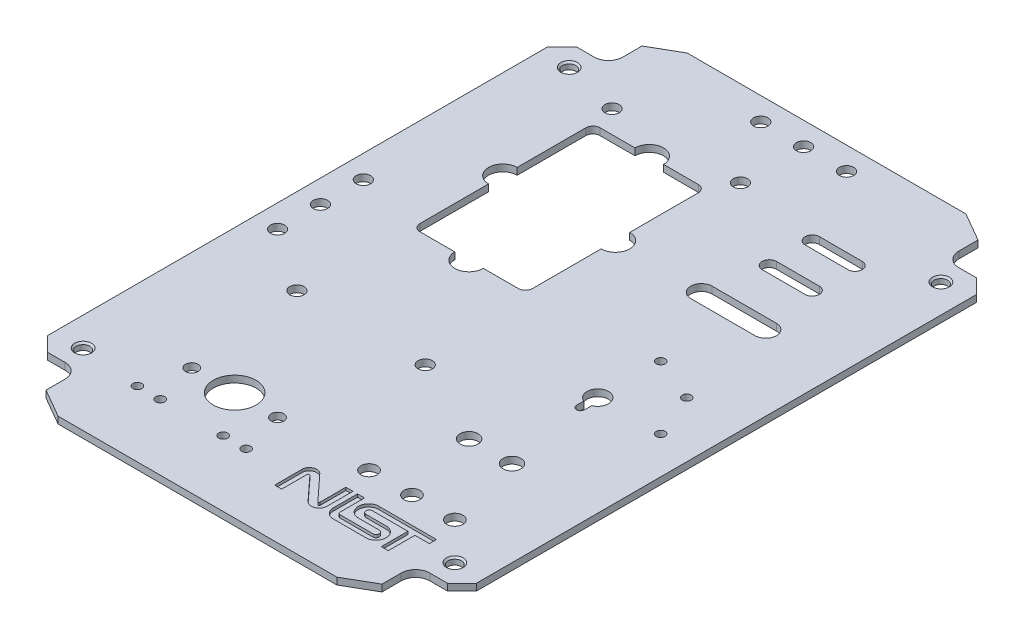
ISO-10303-21;
HEADER;
FILE_DESCRIPTION(('STEP AP214'),'2;1');
FILE_NAME('part.step','',(''),(''),'','','');
FILE_SCHEMA(('AUTOMOTIVE_DESIGN { 1 0 10303 214 1 1 1 1 }'));
ENDSEC;
DATA;
#1=APPLICATION_CONTEXT('core data for automotive mechanical design processes');
#2=APPLICATION_PROTOCOL_DEFINITION('international standard','automotive_design',2000,#1);
#3=PRODUCT_CONTEXT('',#1,'mechanical');
#4=PRODUCT('Part','Part','',(#3));
#5=PRODUCT_RELATED_PRODUCT_CATEGORY('part','',(#4));
#6=PRODUCT_DEFINITION_FORMATION('','',#4);
#7=PRODUCT_DEFINITION_CONTEXT('part definition',#1,'design');
#8=PRODUCT_DEFINITION('design','',#6,#7);
#9=PRODUCT_DEFINITION_SHAPE('','',#8);
#10=(LENGTH_UNIT() NAMED_UNIT(*) SI_UNIT(.MILLI.,.METRE.));
#11=(NAMED_UNIT(*) PLANE_ANGLE_UNIT() SI_UNIT($,.RADIAN.));
#12=(NAMED_UNIT(*) SI_UNIT($,.STERADIAN.) SOLID_ANGLE_UNIT());
#13=UNCERTAINTY_MEASURE_WITH_UNIT(LENGTH_MEASURE(1.E-05),#10,'distance_accuracy_value','');
#14=(GEOMETRIC_REPRESENTATION_CONTEXT(3) GLOBAL_UNCERTAINTY_ASSIGNED_CONTEXT((#13)) GLOBAL_UNIT_ASSIGNED_CONTEXT((#10,
#11,#12)) REPRESENTATION_CONTEXT('',''));
#15=CARTESIAN_POINT('',(0.,0.,0.));
#16=DIRECTION('',(0.,0.,1.));
#17=DIRECTION('',(1.,0.,0.));
#18=AXIS2_PLACEMENT_3D('',#15,#16,#17);
#19=CARTESIAN_POINT('',(0.,0.,0.));
#20=DIRECTION('',(0.,1.,0.));
#21=DIRECTION('',(0.,0.,1.));
#22=AXIS2_PLACEMENT_3D('',#19,#20,#21);
#23=PLANE('',#22);
#24=CARTESIAN_POINT('',(38.1,0.,57.15));
#25=DIRECTION('',(0.,1.,0.));
#26=DIRECTION('',(0.,0.,1.));
#27=AXIS2_PLACEMENT_3D('',#24,#25,#26);
#28=CIRCLE('',#27,4.0005);
#29=CARTESIAN_POINT('',(38.1,0.,61.1505));
#30=VERTEX_POINT('',#29);
#31=EDGE_CURVE('E808',#30,#30,#28,.T.);
#32=ORIENTED_EDGE('',*,*,#31,.T.);
#33=EDGE_LOOP('',(#32));
#34=FACE_BOUND('',#33,.T.);
#35=CARTESIAN_POINT('',(57.15,0.,57.15));
#36=DIRECTION('',(0.,1.,0.));
#37=DIRECTION('',(0.,0.,1.));
#38=AXIS2_PLACEMENT_3D('',#35,#36,#37);
#39=CIRCLE('',#38,4.0005);
#40=CARTESIAN_POINT('',(57.15,0.,61.1505));
#41=VERTEX_POINT('',#40);
#42=EDGE_CURVE('E854',#41,#41,#39,.T.);
#43=ORIENTED_EDGE('',*,*,#42,.T.);
#44=EDGE_LOOP('',(#43));
#45=FACE_BOUND('',#44,.T.);
#46=CARTESIAN_POINT('',(-45.72,0.,110.49));
#47=DIRECTION('',(0.,1.,0.));
#48=DIRECTION('',(0.,0.,1.));
#49=AXIS2_PLACEMENT_3D('',#46,#47,#48);
#50=CIRCLE('',#49,1.98437499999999);
#51=CARTESIAN_POINT('',(-45.72,0.,112.474375));
#52=VERTEX_POINT('',#51);
#53=EDGE_CURVE('E876',#52,#52,#50,.F.);
#54=ORIENTED_EDGE('',*,*,#53,.F.);
#55=EDGE_LOOP('',(#54));
#56=FACE_BOUND('',#55,.T.);
#57=CARTESIAN_POINT('',(-85.09,0.,0.));
#58=DIRECTION('',(0.,1.,0.));
#59=DIRECTION('',(0.,0.,1.));
#60=AXIS2_PLACEMENT_3D('',#57,#58,#59);
#61=CIRCLE('',#60,3.175);
#62=CARTESIAN_POINT('',(-85.09,0.,3.175));
#63=VERTEX_POINT('',#62);
#64=EDGE_CURVE('E879',#63,#63,#61,.T.);
#65=ORIENTED_EDGE('',*,*,#64,.T.);
#66=EDGE_LOOP('',(#65));
#67=FACE_BOUND('',#66,.T.);
#68=CARTESIAN_POINT('',(-85.09,0.,19.05));
#69=DIRECTION('',(0.,1.,0.));
#70=DIRECTION('',(0.,0.,1.));
#71=AXIS2_PLACEMENT_3D('',#68,#69,#70);
#72=CIRCLE('',#71,3.175);
#73=CARTESIAN_POINT('',(-85.09,0.,22.225));
#74=VERTEX_POINT('',#73);
#75=EDGE_CURVE('E890',#74,#74,#72,.T.);
#76=ORIENTED_EDGE('',*,*,#75,.T.);
#77=EDGE_LOOP('',(#76));
#78=FACE_BOUND('',#77,.T.);
#79=DIRECTION('',(1.,0.,0.));
#80=VECTOR('',#79,1.);
#81=CARTESIAN_POINT('',(61.9125,0.,-46.0375));
#82=LINE('',#81,#80);
#83=CARTESIAN_POINT('',(33.3375,0.,-46.0375));
#84=VERTEX_POINT('',#83);
#85=CARTESIAN_POINT('',(61.9125,0.,-46.0375));
#86=VERTEX_POINT('',#85);
#87=EDGE_CURVE('E904',#84,#86,#82,.T.);
#88=ORIENTED_EDGE('',*,*,#87,.T.);
#89=CARTESIAN_POINT('',(61.9125,0.,-50.8));
#90=DIRECTION('',(0.,1.,0.));
#91=DIRECTION('',(0.,0.,1.));
#92=AXIS2_PLACEMENT_3D('',#89,#90,#91);
#93=CIRCLE('',#92,4.7625);
#94=CARTESIAN_POINT('',(61.9125,0.,-55.5625));
#95=VERTEX_POINT('',#94);
#96=EDGE_CURVE('E894',#86,#95,#93,.T.);
#97=ORIENTED_EDGE('',*,*,#96,.T.);
#98=DIRECTION('',(-1.,0.,0.));
#99=VECTOR('',#98,1.);
#100=CARTESIAN_POINT('',(61.9125,0.,-55.5625));
#101=LINE('',#100,#99);
#102=CARTESIAN_POINT('',(33.3375,0.,-55.5625));
#103=VERTEX_POINT('',#102);
#104=EDGE_CURVE('E897',#95,#103,#101,.T.);
#105=ORIENTED_EDGE('',*,*,#104,.T.);
#106=CARTESIAN_POINT('',(33.3375,0.,-50.8));
#107=DIRECTION('',(0.,1.,0.));
#108=DIRECTION('',(0.,0.,1.));
#109=AXIS2_PLACEMENT_3D('',#106,#107,#108);
#110=CIRCLE('',#109,4.7625);
#111=EDGE_CURVE('E901',#103,#84,#110,.T.);
#112=ORIENTED_EDGE('',*,*,#111,.T.);
#113=EDGE_LOOP('',(#88,#97,#105,#112));
#114=FACE_BOUND('',#113,.T.);
#115=DIRECTION('',(1.,0.,0.));
#116=VECTOR('',#115,1.);
#117=CARTESIAN_POINT('',(57.15,0.,-73.025));
#118=LINE('',#117,#116);
#119=CARTESIAN_POINT('',(38.1,0.,-73.025));
#120=VERTEX_POINT('',#119);
#121=CARTESIAN_POINT('',(57.15,0.,-73.025));
#122=VERTEX_POINT('',#121);
#123=EDGE_CURVE('E936',#120,#122,#118,.T.);
#124=ORIENTED_EDGE('',*,*,#123,.T.);
#125=CARTESIAN_POINT('',(57.15,0.,-76.2));
#126=DIRECTION('',(0.,1.,0.));
#127=DIRECTION('',(0.,0.,1.));
#128=AXIS2_PLACEMENT_3D('',#125,#126,#127);
#129=CIRCLE('',#128,3.17500000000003);
#130=CARTESIAN_POINT('',(57.15,0.,-79.375));
#131=VERTEX_POINT('',#130);
#132=EDGE_CURVE('E926',#122,#131,#129,.T.);
#133=ORIENTED_EDGE('',*,*,#132,.T.);
#134=DIRECTION('',(-1.,0.,0.));
#135=VECTOR('',#134,1.);
#136=CARTESIAN_POINT('',(57.15,0.,-79.375));
#137=LINE('',#136,#135);
#138=CARTESIAN_POINT('',(38.1,0.,-79.375));
#139=VERTEX_POINT('',#138);
#140=EDGE_CURVE('E929',#131,#139,#137,.T.);
#141=ORIENTED_EDGE('',*,*,#140,.T.);
#142=CARTESIAN_POINT('',(38.1,0.,-76.2));
#143=DIRECTION('',(0.,1.,0.));
#144=DIRECTION('',(0.,0.,1.));
#145=AXIS2_PLACEMENT_3D('',#142,#143,#144);
#146=CIRCLE('',#145,3.17500000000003);
#147=EDGE_CURVE('E933',#139,#120,#146,.T.);
#148=ORIENTED_EDGE('',*,*,#147,.T.);
#149=EDGE_LOOP('',(#124,#133,#141,#148));
#150=FACE_BOUND('',#149,.T.);
#151=DIRECTION('',(1.,0.,0.));
#152=VECTOR('',#151,1.);
#153=CARTESIAN_POINT('',(57.15,0.,-92.075));
#154=LINE('',#153,#152);
#155=CARTESIAN_POINT('',(38.1,0.,-92.075));
#156=VERTEX_POINT('',#155);
#157=CARTESIAN_POINT('',(57.15,0.,-92.075));
#158=VERTEX_POINT('',#157);
#159=EDGE_CURVE('E968',#156,#158,#154,.T.);
#160=ORIENTED_EDGE('',*,*,#159,.T.);
#161=CARTESIAN_POINT('',(57.15,0.,-95.25));
#162=DIRECTION('',(0.,1.,0.));
#163=DIRECTION('',(0.,0.,1.));
#164=AXIS2_PLACEMENT_3D('',#161,#162,#163);
#165=CIRCLE('',#164,3.17500000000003);
#166=CARTESIAN_POINT('',(57.15,0.,-98.425));
#167=VERTEX_POINT('',#166);
#168=EDGE_CURVE('E958',#158,#167,#165,.T.);
#169=ORIENTED_EDGE('',*,*,#168,.T.);
#170=DIRECTION('',(-1.,0.,0.));
#171=VECTOR('',#170,1.);
#172=CARTESIAN_POINT('',(57.15,0.,-98.425));
#173=LINE('',#172,#171);
#174=CARTESIAN_POINT('',(38.1,0.,-98.425));
#175=VERTEX_POINT('',#174);
#176=EDGE_CURVE('E961',#167,#175,#173,.T.);
#177=ORIENTED_EDGE('',*,*,#176,.T.);
#178=CARTESIAN_POINT('',(38.1,0.,-95.25));
#179=DIRECTION('',(0.,1.,0.));
#180=DIRECTION('',(0.,0.,1.));
#181=AXIS2_PLACEMENT_3D('',#178,#179,#180);
#182=CIRCLE('',#181,3.17500000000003);
#183=EDGE_CURVE('E965',#175,#156,#182,.T.);
#184=ORIENTED_EDGE('',*,*,#183,.T.);
#185=EDGE_LOOP('',(#160,#169,#177,#184));
#186=FACE_BOUND('',#185,.T.);
#187=CARTESIAN_POINT('',(78.74,0.,12.7000000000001));
#188=DIRECTION('',(0.,1.,0.));
#189=DIRECTION('',(0.,0.,1.));
#190=AXIS2_PLACEMENT_3D('',#187,#188,#189);
#191=CIRCLE('',#190,1.984375);
#192=CARTESIAN_POINT('',(78.74,0.,14.6843750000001));
#193=VERTEX_POINT('',#192);
#194=EDGE_CURVE('E992',#193,#193,#191,.T.);
#195=ORIENTED_EDGE('',*,*,#194,.T.);
#196=EDGE_LOOP('',(#195));
#197=FACE_BOUND('',#196,.T.);
#198=CARTESIAN_POINT('',(70.5565634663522,0.,-7.05656346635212));
#199=DIRECTION('',(0.,1.,0.));
#200=DIRECTION('',(0.,0.,1.));
#201=AXIS2_PLACEMENT_3D('',#198,#199,#200);
#202=CIRCLE('',#201,1.984375);
#203=CARTESIAN_POINT('',(70.5565634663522,0.,-5.07218846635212));
#204=VERTEX_POINT('',#203);
#205=EDGE_CURVE('E998',#204,#204,#202,.T.);
#206=ORIENTED_EDGE('',*,*,#205,.T.);
#207=EDGE_LOOP('',(#206));
#208=FACE_BOUND('',#207,.T.);
#209=CARTESIAN_POINT('',(50.8,0.,-15.24));
#210=DIRECTION('',(0.,1.,0.));
#211=DIRECTION('',(0.,0.,1.));
#212=AXIS2_PLACEMENT_3D('',#209,#210,#211);
#213=CIRCLE('',#212,1.984375);
#214=CARTESIAN_POINT('',(50.8,0.,-13.255625));
#215=VERTEX_POINT('',#214);
#216=EDGE_CURVE('E1004',#215,#215,#213,.T.);
#217=ORIENTED_EDGE('',*,*,#216,.T.);
#218=EDGE_LOOP('',(#217));
#219=FACE_BOUND('',#218,.T.);
#220=DIRECTION('',(0.,0.,1.));
#221=VECTOR('',#220,1.);
#222=CARTESIAN_POINT('',(49.022,0.,17.1181582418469));
#223=LINE('',#222,#221);
#224=CARTESIAN_POINT('',(49.022,0.,17.1181582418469));
#225=VERTEX_POINT('',#224);
#226=CARTESIAN_POINT('',(49.022,0.,20.32));
#227=VERTEX_POINT('',#226);
#228=EDGE_CURVE('E1018',#225,#227,#223,.T.);
#229=ORIENTED_EDGE('',*,*,#228,.T.);
#230=CARTESIAN_POINT('',(50.8,0.,20.32));
#231=DIRECTION('',(0.,1.,0.));
#232=DIRECTION('',(0.,0.,1.));
#233=AXIS2_PLACEMENT_3D('',#230,#231,#232);
#234=CIRCLE('',#233,1.778);
#235=CARTESIAN_POINT('',(52.578,0.,20.32));
#236=VERTEX_POINT('',#235);
#237=EDGE_CURVE('E1008',#227,#236,#234,.T.);
#238=ORIENTED_EDGE('',*,*,#237,.T.);
#239=DIRECTION('',(0.,0.,-1.));
#240=VECTOR('',#239,1.);
#241=CARTESIAN_POINT('',(52.578,0.,17.1181582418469));
#242=LINE('',#241,#240);
#243=CARTESIAN_POINT('',(52.578,0.,17.1181582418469));
#244=VERTEX_POINT('',#243);
#245=EDGE_CURVE('E1011',#236,#244,#242,.T.);
#246=ORIENTED_EDGE('',*,*,#245,.T.);
#247=CARTESIAN_POINT('',(50.8,0.,12.7));
#248=DIRECTION('',(0.,1.,0.));
#249=DIRECTION('',(0.,0.,1.));
#250=AXIS2_PLACEMENT_3D('',#247,#248,#249);
#251=CIRCLE('',#250,4.7625);
#252=EDGE_CURVE('E1015',#244,#225,#251,.T.);
#253=ORIENTED_EDGE('',*,*,#252,.T.);
#254=EDGE_LOOP('',(#229,#238,#246,#253));
#255=FACE_BOUND('',#254,.T.);
#256=CARTESIAN_POINT('',(27.94,0.,91.44));
#257=DIRECTION('',(0.,1.,0.));
#258=DIRECTION('',(0.,0.,1.));
#259=AXIS2_PLACEMENT_3D('',#256,#257,#258);
#260=CIRCLE('',#259,3.56869999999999);
#261=CARTESIAN_POINT('',(27.94,0.,95.0087));
#262=VERTEX_POINT('',#261);
#263=EDGE_CURVE('E1052',#262,#262,#260,.F.);
#264=ORIENTED_EDGE('',*,*,#263,.F.);
#265=EDGE_LOOP('',(#264));
#266=FACE_BOUND('',#265,.T.);
#267=CARTESIAN_POINT('',(-31.75,0.,91.44));
#268=DIRECTION('',(0.,1.,0.));
#269=DIRECTION('',(0.,0.,1.));
#270=AXIS2_PLACEMENT_3D('',#267,#268,#269);
#271=CIRCLE('',#270,9.525);
#272=CARTESIAN_POINT('',(-31.75,0.,100.965));
#273=VERTEX_POINT('',#272);
#274=EDGE_CURVE('E1060',#273,#273,#271,.T.);
#275=ORIENTED_EDGE('',*,*,#274,.T.);
#276=EDGE_LOOP('',(#275));
#277=FACE_BOUND('',#276,.T.);
#278=CARTESIAN_POINT('',(-50.8,0.,91.44));
#279=DIRECTION('',(0.,1.,0.));
#280=DIRECTION('',(0.,0.,1.));
#281=AXIS2_PLACEMENT_3D('',#278,#279,#280);
#282=CIRCLE('',#281,2.8067);
#283=CARTESIAN_POINT('',(-50.8,0.,94.2467));
#284=VERTEX_POINT('',#283);
#285=EDGE_CURVE('E1070',#284,#284,#282,.F.);
#286=ORIENTED_EDGE('',*,*,#285,.F.);
#287=EDGE_LOOP('',(#286));
#288=FACE_BOUND('',#287,.T.);
#289=DIRECTION('',(-1.,0.,0.));
#290=VECTOR('',#289,1.);
#291=CARTESIAN_POINT('',(-55.6499999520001,0.,-91.599999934));
#292=LINE('',#291,#290);
#293=CARTESIAN_POINT('',(-36.9999999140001,0.,-91.599999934));
#294=VERTEX_POINT('',#293);
#295=CARTESIAN_POINT('',(-52.4749999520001,0.,-91.599999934));
#296=VERTEX_POINT('',#295);
#297=EDGE_CURVE('E1106',#294,#296,#292,.T.);
#298=ORIENTED_EDGE('',*,*,#297,.T.);
#299=CARTESIAN_POINT('',(-52.4749999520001,0.,-88.424999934));
#300=DIRECTION('',(0.,1.,0.));
#301=DIRECTION('',(0.,0.,1.));
#302=AXIS2_PLACEMENT_3D('',#299,#300,#301);
#303=CIRCLE('',#302,3.175);
#304=CARTESIAN_POINT('',(-55.6499999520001,0.,-88.424999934));
#305=VERTEX_POINT('',#304);
#306=EDGE_CURVE('E11',#296,#305,#303,.T.);
#307=ORIENTED_EDGE('',*,*,#306,.T.);
#308=DIRECTION('',(0.,0.,1.));
#309=VECTOR('',#308,1.);
#310=CARTESIAN_POINT('',(-55.6499999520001,0.,-91.599999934));
#311=LINE('',#310,#309);
#312=CARTESIAN_POINT('',(-55.649999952,0.,-57.949998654));
#313=VERTEX_POINT('',#312);
#314=EDGE_CURVE('E1076',#305,#313,#311,.T.);
#315=ORIENTED_EDGE('',*,*,#314,.T.);
#316=CARTESIAN_POINT('',(-55.6499999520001,0.,-51.599998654));
#317=DIRECTION('',(0.,1.,0.));
#318=DIRECTION('',(0.,0.,1.));
#319=AXIS2_PLACEMENT_3D('',#316,#317,#318);
#320=CIRCLE('',#319,6.35);
#321=CARTESIAN_POINT('',(-55.6499999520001,0.,-45.249998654));
#322=VERTEX_POINT('',#321);
#323=EDGE_CURVE('E1078',#313,#322,#320,.T.);
#324=ORIENTED_EDGE('',*,*,#323,.T.);
#325=DIRECTION('',(0.,0.,1.));
#326=VECTOR('',#325,1.);
#327=CARTESIAN_POINT('',(-55.649999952,0.,-45.249998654));
#328=LINE('',#327,#326);
#329=CARTESIAN_POINT('',(-55.649999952,0.,-14.774997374));
#330=VERTEX_POINT('',#329);
#331=EDGE_CURVE('E1082',#322,#330,#328,.T.);
#332=ORIENTED_EDGE('',*,*,#331,.T.);
#333=CARTESIAN_POINT('',(-52.474999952,0.,-14.774997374));
#334=DIRECTION('',(0.,1.,0.));
#335=DIRECTION('',(0.,0.,1.));
#336=AXIS2_PLACEMENT_3D('',#333,#334,#335);
#337=CIRCLE('',#336,3.175);
#338=CARTESIAN_POINT('',(-52.474999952,0.,-11.599997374));
#339=VERTEX_POINT('',#338);
#340=EDGE_CURVE('E1453',#330,#339,#337,.T.);
#341=ORIENTED_EDGE('',*,*,#340,.T.);
#342=DIRECTION('',(1.,0.,0.));
#343=VECTOR('',#342,1.);
#344=CARTESIAN_POINT('',(-55.649999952,0.,-11.599997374));
#345=LINE('',#344,#343);
#346=CARTESIAN_POINT('',(-36.999999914,0.,-11.599997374));
#347=VERTEX_POINT('',#346);
#348=EDGE_CURVE('E1085',#339,#347,#345,.T.);
#349=ORIENTED_EDGE('',*,*,#348,.T.);
#350=CARTESIAN_POINT('',(-30.649999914,0.,-11.599997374));
#351=DIRECTION('',(0.,1.,0.));
#352=DIRECTION('',(0.,0.,1.));
#353=AXIS2_PLACEMENT_3D('',#350,#351,#352);
#354=CIRCLE('',#353,6.35);
#355=CARTESIAN_POINT('',(-24.299999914,0.,-11.599997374));
#356=VERTEX_POINT('',#355);
#357=EDGE_CURVE('E1087',#347,#356,#354,.T.);
#358=ORIENTED_EDGE('',*,*,#357,.T.);
#359=DIRECTION('',(1.,0.,0.));
#360=VECTOR('',#359,1.);
#361=CARTESIAN_POINT('',(-24.299999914,0.,-11.599997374));
#362=LINE('',#361,#360);
#363=CARTESIAN_POINT('',(-8.82499987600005,0.,-11.599997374));
#364=VERTEX_POINT('',#363);
#365=EDGE_CURVE('E1090',#356,#364,#362,.T.);
#366=ORIENTED_EDGE('',*,*,#365,.T.);
#367=CARTESIAN_POINT('',(-8.82499987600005,0.,-14.774997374));
#368=DIRECTION('',(0.,1.,0.));
#369=DIRECTION('',(0.,0.,1.));
#370=AXIS2_PLACEMENT_3D('',#367,#368,#369);
#371=CIRCLE('',#370,3.175);
#372=CARTESIAN_POINT('',(-5.64999987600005,0.,-14.774997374));
#373=VERTEX_POINT('',#372);
#374=EDGE_CURVE('E1445',#364,#373,#371,.T.);
#375=ORIENTED_EDGE('',*,*,#374,.T.);
#376=DIRECTION('',(0.,0.,-1.));
#377=VECTOR('',#376,1.);
#378=CARTESIAN_POINT('',(-5.64999987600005,0.,-45.249998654));
#379=LINE('',#378,#377);
#380=CARTESIAN_POINT('',(-5.64999987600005,0.,-45.249998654));
#381=VERTEX_POINT('',#380);
#382=EDGE_CURVE('E1093',#373,#381,#379,.T.);
#383=ORIENTED_EDGE('',*,*,#382,.T.);
#384=CARTESIAN_POINT('',(-5.64999987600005,0.,-51.599998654));
#385=DIRECTION('',(0.,1.,0.));
#386=DIRECTION('',(0.,0.,1.));
#387=AXIS2_PLACEMENT_3D('',#384,#385,#386);
#388=CIRCLE('',#387,6.35);
#389=CARTESIAN_POINT('',(-5.64999987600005,0.,-57.949998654));
#390=VERTEX_POINT('',#389);
#391=EDGE_CURVE('E1095',#381,#390,#388,.T.);
#392=ORIENTED_EDGE('',*,*,#391,.T.);
#393=DIRECTION('',(0.,0.,-1.));
#394=VECTOR('',#393,1.);
#395=CARTESIAN_POINT('',(-5.64999987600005,0.,-91.599999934));
#396=LINE('',#395,#394);
#397=CARTESIAN_POINT('',(-5.64999987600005,0.,-88.424999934));
#398=VERTEX_POINT('',#397);
#399=EDGE_CURVE('E1098',#390,#398,#396,.T.);
#400=ORIENTED_EDGE('',*,*,#399,.T.);
#401=CARTESIAN_POINT('',(-8.82499987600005,0.,-88.424999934));
#402=DIRECTION('',(0.,1.,0.));
#403=DIRECTION('',(0.,0.,1.));
#404=AXIS2_PLACEMENT_3D('',#401,#402,#403);
#405=CIRCLE('',#404,3.175);
#406=CARTESIAN_POINT('',(-8.82499987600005,0.,-91.599999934));
#407=VERTEX_POINT('',#406);
#408=EDGE_CURVE('E1449',#398,#407,#405,.T.);
#409=ORIENTED_EDGE('',*,*,#408,.T.);
#410=DIRECTION('',(-1.,0.,0.));
#411=VECTOR('',#410,1.);
#412=CARTESIAN_POINT('',(-24.2999999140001,0.,-91.599999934));
#413=LINE('',#412,#411);
#414=CARTESIAN_POINT('',(-24.2999999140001,0.,-91.599999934));
#415=VERTEX_POINT('',#414);
#416=EDGE_CURVE('E1101',#407,#415,#413,.T.);
#417=ORIENTED_EDGE('',*,*,#416,.T.);
#418=CARTESIAN_POINT('',(-30.6499999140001,0.,-91.599999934));
#419=DIRECTION('',(0.,1.,0.));
#420=DIRECTION('',(0.,0.,1.));
#421=AXIS2_PLACEMENT_3D('',#418,#419,#420);
#422=CIRCLE('',#421,6.35);
#423=EDGE_CURVE('E1103',#415,#294,#422,.T.);
#424=ORIENTED_EDGE('',*,*,#423,.T.);
#425=EDGE_LOOP('',(#298,#307,#315,#324,#332,#341,#349,#358,#366,#375,#383,#392,#400,#409,#417,#424));
#426=FACE_BOUND('',#425,.T.);
#427=CARTESIAN_POINT('',(-57.15,0.,38.39972));
#428=DIRECTION('',(0.,1.,0.));
#429=DIRECTION('',(0.,0.,1.));
#430=AXIS2_PLACEMENT_3D('',#427,#428,#429);
#431=CIRCLE('',#430,3.17499999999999);
#432=CARTESIAN_POINT('',(-57.15,0.,41.57472));
#433=VERTEX_POINT('',#432);
#434=EDGE_CURVE('E1166',#433,#433,#431,.F.);
#435=ORIENTED_EDGE('',*,*,#434,.F.);
#436=EDGE_LOOP('',(#435));
#437=FACE_BOUND('',#436,.T.);
#438=CARTESIAN_POINT('',(19.05,0.,-129.54));
#439=DIRECTION('',(0.,1.,0.));
#440=DIRECTION('',(0.,0.,1.));
#441=AXIS2_PLACEMENT_3D('',#438,#439,#440);
#442=CIRCLE('',#441,3.17499999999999);
#443=CARTESIAN_POINT('',(19.05,0.,-126.365));
#444=VERTEX_POINT('',#443);
#445=EDGE_CURVE('E1184',#444,#444,#442,.F.);
#446=ORIENTED_EDGE('',*,*,#445,.F.);
#447=EDGE_LOOP('',(#446));
#448=FACE_BOUND('',#447,.T.);
#449=CARTESIAN_POINT('',(82.55,0.,-107.95));
#450=DIRECTION('',(0.,1.,0.));
#451=DIRECTION('',(0.,0.,1.));
#452=AXIS2_PLACEMENT_3D('',#449,#450,#451);
#453=CIRCLE('',#452,2.97179999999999);
#454=CARTESIAN_POINT('',(82.55,0.,-104.9782));
#455=VERTEX_POINT('',#454);
#456=EDGE_CURVE('E1199',#455,#455,#453,.F.);
#457=ORIENTED_EDGE('',*,*,#456,.F.);
#458=EDGE_LOOP('',(#457));
#459=FACE_BOUND('',#458,.T.);
#460=CARTESIAN_POINT('',(-82.55,0.,-107.95));
#461=DIRECTION('',(0.,1.,0.));
#462=DIRECTION('',(0.,0.,1.));
#463=AXIS2_PLACEMENT_3D('',#460,#461,#462);
#464=CIRCLE('',#463,2.9718);
#465=CARTESIAN_POINT('',(-82.55,0.,-104.9782));
#466=VERTEX_POINT('',#465);
#467=EDGE_CURVE('E1207',#466,#466,#464,.F.);
#468=ORIENTED_EDGE('',*,*,#467,.F.);
#469=EDGE_LOOP('',(#468));
#470=FACE_BOUND('',#469,.T.);
#471=DIRECTION('',(0.,0.,-1.));
#472=VECTOR('',#471,1.);
#473=CARTESIAN_POINT('',(74.6125000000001,0.,117.475));
#474=LINE('',#473,#472);
#475=CARTESIAN_POINT('',(74.6125000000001,0.,132.367651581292));
#476=VERTEX_POINT('',#475);
#477=CARTESIAN_POINT('',(74.6125000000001,0.,123.825));
#478=VERTEX_POINT('',#477);
#479=EDGE_CURVE('E1253',#476,#478,#474,.T.);
#480=ORIENTED_EDGE('',*,*,#479,.F.);
#481=DIRECTION('',(0.86602540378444,0.,-0.499999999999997));
#482=VECTOR('',#481,1.);
#483=CARTESIAN_POINT('',(74.6125000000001,0.,132.367651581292));
#484=LINE('',#483,#482);
#485=CARTESIAN_POINT('',(61.9125,0.,139.7));
#486=VERTEX_POINT('',#485);
#487=EDGE_CURVE('E1404',#476,#486,#484,.F.);
#488=ORIENTED_EDGE('',*,*,#487,.T.);
#489=DIRECTION('',(1.,0.,0.));
#490=VECTOR('',#489,1.);
#491=CARTESIAN_POINT('',(-74.6125,0.,139.7));
#492=LINE('',#491,#490);
#493=CARTESIAN_POINT('',(-61.9124999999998,0.,139.7));
#494=VERTEX_POINT('',#493);
#495=EDGE_CURVE('E1250',#494,#486,#492,.T.);
#496=ORIENTED_EDGE('',*,*,#495,.F.);
#497=DIRECTION('',(0.86602540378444,0.,0.499999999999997));
#498=VECTOR('',#497,1.);
#499=CARTESIAN_POINT('',(-61.9124999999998,0.,139.7));
#500=LINE('',#499,#498);
#501=CARTESIAN_POINT('',(-74.6125,0.,132.367651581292));
#502=VERTEX_POINT('',#501);
#503=EDGE_CURVE('E1402',#494,#502,#500,.F.);
#504=ORIENTED_EDGE('',*,*,#503,.T.);
#505=DIRECTION('',(0.,0.,1.));
#506=VECTOR('',#505,1.);
#507=CARTESIAN_POINT('',(-74.6125,0.,117.475));
#508=LINE('',#507,#506);
#509=CARTESIAN_POINT('',(-74.6125,0.,123.825));
#510=VERTEX_POINT('',#509);
#511=EDGE_CURVE('E1213',#510,#502,#508,.T.);
#512=ORIENTED_EDGE('',*,*,#511,.F.);
#513=CARTESIAN_POINT('',(-80.9625,0.,123.825));
#514=DIRECTION('',(0.,1.,0.));
#515=DIRECTION('',(0.,0.,1.));
#516=AXIS2_PLACEMENT_3D('',#513,#514,#515);
#517=CIRCLE('',#516,6.35);
#518=CARTESIAN_POINT('',(-80.9625,0.,117.475));
#519=VERTEX_POINT('',#518);
#520=EDGE_CURVE('E1316',#510,#519,#517,.T.);
#521=ORIENTED_EDGE('',*,*,#520,.T.);
#522=DIRECTION('',(1.,0.,0.));
#523=VECTOR('',#522,1.);
#524=CARTESIAN_POINT('',(-95.25,0.,117.475));
#525=LINE('',#524,#523);
#526=CARTESIAN_POINT('',(-88.9,0.,117.475));
#527=VERTEX_POINT('',#526);
#528=EDGE_CURVE('E1218',#527,#519,#525,.T.);
#529=ORIENTED_EDGE('',*,*,#528,.F.);
#530=DIRECTION('',(0.707106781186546,0.,0.707106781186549));
#531=VECTOR('',#530,1.);
#532=CARTESIAN_POINT('',(-88.9,0.,117.475));
#533=LINE('',#532,#531);
#534=CARTESIAN_POINT('',(-95.25,0.,111.125));
#535=VERTEX_POINT('',#534);
#536=EDGE_CURVE('E1350',#527,#535,#533,.F.);
#537=ORIENTED_EDGE('',*,*,#536,.T.);
#538=DIRECTION('',(0.,0.,1.));
#539=VECTOR('',#538,1.);
#540=CARTESIAN_POINT('',(-95.25,0.,-117.475));
#541=LINE('',#540,#539);
#542=CARTESIAN_POINT('',(-95.25,0.,-111.125));
#543=VERTEX_POINT('',#542);
#544=EDGE_CURVE('E1274',#543,#535,#541,.T.);
#545=ORIENTED_EDGE('',*,*,#544,.F.);
#546=DIRECTION('',(-0.707106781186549,0.,0.707106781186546));
#547=VECTOR('',#546,1.);
#548=CARTESIAN_POINT('',(-95.25,0.,-111.125));
#549=LINE('',#548,#547);
#550=CARTESIAN_POINT('',(-88.8999999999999,0.,-117.475));
#551=VERTEX_POINT('',#550);
#552=EDGE_CURVE('E1356',#543,#551,#549,.F.);
#553=ORIENTED_EDGE('',*,*,#552,.T.);
#554=DIRECTION('',(-1.,0.,0.));
#555=VECTOR('',#554,1.);
#556=CARTESIAN_POINT('',(-95.25,0.,-117.475));
#557=LINE('',#556,#555);
#558=CARTESIAN_POINT('',(-80.9625,0.,-117.475));
#559=VERTEX_POINT('',#558);
#560=EDGE_CURVE('E1271',#559,#551,#557,.T.);
#561=ORIENTED_EDGE('',*,*,#560,.F.);
#562=CARTESIAN_POINT('',(-80.9625,0.,-123.825));
#563=DIRECTION('',(0.,1.,0.));
#564=DIRECTION('',(0.,0.,1.));
#565=AXIS2_PLACEMENT_3D('',#562,#563,#564);
#566=CIRCLE('',#565,6.35);
#567=CARTESIAN_POINT('',(-74.6125,0.,-123.825));
#568=VERTEX_POINT('',#567);
#569=EDGE_CURVE('E1311',#559,#568,#566,.T.);
#570=ORIENTED_EDGE('',*,*,#569,.T.);
#571=DIRECTION('',(0.,0.,1.));
#572=VECTOR('',#571,1.);
#573=CARTESIAN_POINT('',(-74.6125,0.,-139.7));
#574=LINE('',#573,#572);
#575=CARTESIAN_POINT('',(-74.6125,0.,-132.367651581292));
#576=VERTEX_POINT('',#575);
#577=EDGE_CURVE('E1269',#576,#568,#574,.T.);
#578=ORIENTED_EDGE('',*,*,#577,.F.);
#579=DIRECTION('',(-0.86602540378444,0.,0.499999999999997));
#580=VECTOR('',#579,1.);
#581=CARTESIAN_POINT('',(-74.6125,0.,-132.367651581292));
#582=LINE('',#581,#580);
#583=CARTESIAN_POINT('',(-61.9124999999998,0.,-139.7));
#584=VERTEX_POINT('',#583);
#585=EDGE_CURVE('E1386',#576,#584,#582,.F.);
#586=ORIENTED_EDGE('',*,*,#585,.T.);
#587=DIRECTION('',(-1.,0.,0.));
#588=VECTOR('',#587,1.);
#589=CARTESIAN_POINT('',(-74.6125,0.,-139.7));
#590=LINE('',#589,#588);
#591=CARTESIAN_POINT('',(61.9124999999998,0.,-139.7));
#592=VERTEX_POINT('',#591);
#593=EDGE_CURVE('E1266',#592,#584,#590,.T.);
#594=ORIENTED_EDGE('',*,*,#593,.F.);
#595=DIRECTION('',(-0.86602540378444,0.,-0.499999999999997));
#596=VECTOR('',#595,1.);
#597=CARTESIAN_POINT('',(61.9124999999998,0.,-139.7));
#598=LINE('',#597,#596);
#599=CARTESIAN_POINT('',(74.6125,0.,-132.367651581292));
#600=VERTEX_POINT('',#599);
#601=EDGE_CURVE('E1388',#592,#600,#598,.F.);
#602=ORIENTED_EDGE('',*,*,#601,.T.);
#603=DIRECTION('',(0.,0.,-1.));
#604=VECTOR('',#603,1.);
#605=CARTESIAN_POINT('',(74.6125,0.,-139.7));
#606=LINE('',#605,#604);
#607=CARTESIAN_POINT('',(74.6125,0.,-123.825));
#608=VERTEX_POINT('',#607);
#609=EDGE_CURVE('E1263',#608,#600,#606,.T.);
#610=ORIENTED_EDGE('',*,*,#609,.F.);
#611=CARTESIAN_POINT('',(80.9625,0.,-123.825));
#612=DIRECTION('',(0.,1.,0.));
#613=DIRECTION('',(0.,0.,1.));
#614=AXIS2_PLACEMENT_3D('',#611,#612,#613);
#615=CIRCLE('',#614,6.35);
#616=CARTESIAN_POINT('',(80.9625,0.,-117.475));
#617=VERTEX_POINT('',#616);
#618=EDGE_CURVE('E1306',#608,#617,#615,.T.);
#619=ORIENTED_EDGE('',*,*,#618,.T.);
#620=DIRECTION('',(-1.,0.,0.));
#621=VECTOR('',#620,1.);
#622=CARTESIAN_POINT('',(74.6125,0.,-117.475));
#623=LINE('',#622,#621);
#624=CARTESIAN_POINT('',(88.9,0.,-117.475));
#625=VERTEX_POINT('',#624);
#626=EDGE_CURVE('E1261',#625,#617,#623,.T.);
#627=ORIENTED_EDGE('',*,*,#626,.F.);
#628=DIRECTION('',(-0.707106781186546,0.,-0.707106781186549));
#629=VECTOR('',#628,1.);
#630=CARTESIAN_POINT('',(88.9,0.,-117.475));
#631=LINE('',#630,#629);
#632=CARTESIAN_POINT('',(95.25,0.,-111.125));
#633=VERTEX_POINT('',#632);
#634=EDGE_CURVE('E1354',#625,#633,#631,.F.);
#635=ORIENTED_EDGE('',*,*,#634,.T.);
#636=DIRECTION('',(0.,0.,-1.));
#637=VECTOR('',#636,1.);
#638=CARTESIAN_POINT('',(95.25,0.,-117.475));
#639=LINE('',#638,#637);
#640=CARTESIAN_POINT('',(95.25,0.,111.125));
#641=VERTEX_POINT('',#640);
#642=EDGE_CURVE('E1258',#641,#633,#639,.T.);
#643=ORIENTED_EDGE('',*,*,#642,.F.);
#644=DIRECTION('',(0.707106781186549,0.,-0.707106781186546));
#645=VECTOR('',#644,1.);
#646=CARTESIAN_POINT('',(95.25,0.,111.125));
#647=LINE('',#646,#645);
#648=CARTESIAN_POINT('',(88.9,0.,117.475));
#649=VERTEX_POINT('',#648);
#650=EDGE_CURVE('E1352',#641,#649,#647,.F.);
#651=ORIENTED_EDGE('',*,*,#650,.T.);
#652=DIRECTION('',(1.,0.,0.));
#653=VECTOR('',#652,1.);
#654=CARTESIAN_POINT('',(74.6125000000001,0.,117.475));
#655=LINE('',#654,#653);
#656=CARTESIAN_POINT('',(80.9625,0.,117.475));
#657=VERTEX_POINT('',#656);
#658=EDGE_CURVE('E1255',#657,#649,#655,.T.);
#659=ORIENTED_EDGE('',*,*,#658,.F.);
#660=CARTESIAN_POINT('',(80.9625,0.,123.825));
#661=DIRECTION('',(0.,1.,0.));
#662=DIRECTION('',(0.,0.,1.));
#663=AXIS2_PLACEMENT_3D('',#660,#661,#662);
#664=CIRCLE('',#663,6.35);
#665=EDGE_CURVE('E1301',#657,#478,#664,.T.);
#666=ORIENTED_EDGE('',*,*,#665,.T.);
#667=EDGE_LOOP('',(#480,#488,#496,#504,#512,#521,#529,#537,#545,#553,#561,#570,#578,#586,#594,
#602,#610,#619,#627,#635,#643,#651,#659,#666));
#668=FACE_BOUND('',#667,.T.);
#669=CARTESIAN_POINT('',(-82.55,0.,107.95));
#670=DIRECTION('',(0.,1.,0.));
#671=DIRECTION('',(0.,0.,1.));
#672=AXIS2_PLACEMENT_3D('',#669,#670,#671);
#673=CIRCLE('',#672,2.97179999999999);
#674=CARTESIAN_POINT('',(-82.55,0.,110.9218));
#675=VERTEX_POINT('',#674);
#676=EDGE_CURVE('E1210',#675,#675,#673,.F.);
#677=ORIENTED_EDGE('',*,*,#676,.F.);
#678=EDGE_LOOP('',(#677));
#679=FACE_BOUND('',#678,.T.);
#680=CARTESIAN_POINT('',(82.55,0.,107.95));
#681=DIRECTION('',(0.,1.,0.));
#682=DIRECTION('',(0.,0.,1.));
#683=AXIS2_PLACEMENT_3D('',#680,#681,#682);
#684=CIRCLE('',#683,2.97179999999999);
#685=CARTESIAN_POINT('',(82.55,0.,110.9218));
#686=VERTEX_POINT('',#685);
#687=EDGE_CURVE('E1204',#686,#686,#684,.F.);
#688=ORIENTED_EDGE('',*,*,#687,.F.);
#689=EDGE_LOOP('',(#688));
#690=FACE_BOUND('',#689,.T.);
#691=CARTESIAN_POINT('',(-19.05,0.,-129.54));
#692=DIRECTION('',(0.,1.,0.));
#693=DIRECTION('',(0.,0.,1.));
#694=AXIS2_PLACEMENT_3D('',#691,#692,#693);
#695=CIRCLE('',#694,3.17499999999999);
#696=CARTESIAN_POINT('',(-19.05,0.,-126.365));
#697=VERTEX_POINT('',#696);
#698=EDGE_CURVE('E1196',#697,#697,#695,.F.);
#699=ORIENTED_EDGE('',*,*,#698,.F.);
#700=EDGE_LOOP('',(#699));
#701=FACE_BOUND('',#700,.T.);
#702=CARTESIAN_POINT('',(0.,0.,-129.54));
#703=DIRECTION('',(0.,1.,0.));
#704=DIRECTION('',(0.,0.,1.));
#705=AXIS2_PLACEMENT_3D('',#702,#703,#704);
#706=CIRCLE('',#705,3.17499999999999);
#707=CARTESIAN_POINT('',(0.,0.,-126.365));
#708=VERTEX_POINT('',#707);
#709=EDGE_CURVE('E1190',#708,#708,#706,.F.);
#710=ORIENTED_EDGE('',*,*,#709,.F.);
#711=EDGE_LOOP('',(#710));
#712=FACE_BOUND('',#711,.T.);
#713=CARTESIAN_POINT('',(-57.15,0.,-101.6));
#714=DIRECTION('',(0.,1.,0.));
#715=DIRECTION('',(0.,0.,1.));
#716=AXIS2_PLACEMENT_3D('',#713,#714,#715);
#717=CIRCLE('',#716,3.17499999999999);
#718=CARTESIAN_POINT('',(-57.15,0.,-98.425));
#719=VERTEX_POINT('',#718);
#720=EDGE_CURVE('E1178',#719,#719,#717,.F.);
#721=ORIENTED_EDGE('',*,*,#720,.F.);
#722=EDGE_LOOP('',(#721));
#723=FACE_BOUND('',#722,.T.);
#724=CARTESIAN_POINT('',(-0.150114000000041,0.,-101.6));
#725=DIRECTION('',(0.,1.,0.));
#726=DIRECTION('',(0.,0.,1.));
#727=AXIS2_PLACEMENT_3D('',#724,#725,#726);
#728=CIRCLE('',#727,3.17499999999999);
#729=CARTESIAN_POINT('',(-0.150114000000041,0.,-98.425));
#730=VERTEX_POINT('',#729);
#731=EDGE_CURVE('E1172',#730,#730,#728,.F.);
#732=ORIENTED_EDGE('',*,*,#731,.F.);
#733=EDGE_LOOP('',(#732));
#734=FACE_BOUND('',#733,.T.);
#735=CARTESIAN_POINT('',(-0.150114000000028,0.,38.39972));
#736=DIRECTION('',(0.,1.,0.));
#737=DIRECTION('',(0.,0.,1.));
#738=AXIS2_PLACEMENT_3D('',#735,#736,#737);
#739=CIRCLE('',#738,3.17499999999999);
#740=CARTESIAN_POINT('',(-0.150114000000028,0.,41.57472));
#741=VERTEX_POINT('',#740);
#742=EDGE_CURVE('E1160',#741,#741,#739,.F.);
#743=ORIENTED_EDGE('',*,*,#742,.F.);
#744=EDGE_LOOP('',(#743));
#745=FACE_BOUND('',#744,.T.);
#746=CARTESIAN_POINT('',(-12.7,0.,91.44));
#747=DIRECTION('',(0.,1.,0.));
#748=DIRECTION('',(0.,0.,1.));
#749=AXIS2_PLACEMENT_3D('',#746,#747,#748);
#750=CIRCLE('',#749,2.80669999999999);
#751=CARTESIAN_POINT('',(-12.7,0.,94.2467));
#752=VERTEX_POINT('',#751);
#753=EDGE_CURVE('E1064',#752,#752,#750,.F.);
#754=ORIENTED_EDGE('',*,*,#753,.F.);
#755=EDGE_LOOP('',(#754));
#756=FACE_BOUND('',#755,.T.);
#757=CARTESIAN_POINT('',(46.99,0.,91.44));
#758=DIRECTION('',(0.,1.,0.));
#759=DIRECTION('',(0.,0.,1.));
#760=AXIS2_PLACEMENT_3D('',#757,#758,#759);
#761=CIRCLE('',#760,3.56869999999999);
#762=CARTESIAN_POINT('',(46.99,0.,95.0087));
#763=VERTEX_POINT('',#762);
#764=EDGE_CURVE('E1046',#763,#763,#761,.F.);
#765=ORIENTED_EDGE('',*,*,#764,.F.);
#766=EDGE_LOOP('',(#765));
#767=FACE_BOUND('',#766,.T.);
#768=CARTESIAN_POINT('',(66.04,0.,91.44));
#769=DIRECTION('',(0.,1.,0.));
#770=DIRECTION('',(0.,0.,1.));
#771=AXIS2_PLACEMENT_3D('',#768,#769,#770);
#772=CIRCLE('',#771,3.56869999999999);
#773=CARTESIAN_POINT('',(66.04,0.,95.0087));
#774=VERTEX_POINT('',#773);
#775=EDGE_CURVE('E1040',#774,#774,#772,.F.);
#776=ORIENTED_EDGE('',*,*,#775,.F.);
#777=EDGE_LOOP('',(#776));
#778=FACE_BOUND('',#777,.T.);
#779=CARTESIAN_POINT('',(-85.09,0.,-19.05));
#780=DIRECTION('',(0.,1.,0.));
#781=DIRECTION('',(0.,0.,1.));
#782=AXIS2_PLACEMENT_3D('',#779,#780,#781);
#783=CIRCLE('',#782,3.175);
#784=CARTESIAN_POINT('',(-85.09,0.,-15.875));
#785=VERTEX_POINT('',#784);
#786=EDGE_CURVE('E1417',#785,#785,#783,.T.);
#787=ORIENTED_EDGE('',*,*,#786,.T.);
#788=EDGE_LOOP('',(#787));
#789=FACE_BOUND('',#788,.T.);
#790=CARTESIAN_POINT('',(-55.88,0.,110.49));
#791=DIRECTION('',(0.,1.,0.));
#792=DIRECTION('',(0.,0.,1.));
#793=AXIS2_PLACEMENT_3D('',#790,#791,#792);
#794=CIRCLE('',#793,1.98437499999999);
#795=CARTESIAN_POINT('',(-55.88,0.,112.474375));
#796=VERTEX_POINT('',#795);
#797=EDGE_CURVE('E870',#796,#796,#794,.F.);
#798=ORIENTED_EDGE('',*,*,#797,.F.);
#799=EDGE_LOOP('',(#798));
#800=FACE_BOUND('',#799,.T.);
#801=CARTESIAN_POINT('',(-7.62,0.,110.49));
#802=DIRECTION('',(0.,1.,0.));
#803=DIRECTION('',(0.,0.,1.));
#804=AXIS2_PLACEMENT_3D('',#801,#802,#803);
#805=CIRCLE('',#804,1.98437499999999);
#806=CARTESIAN_POINT('',(-7.62,0.,112.474375));
#807=VERTEX_POINT('',#806);
#808=EDGE_CURVE('E864',#807,#807,#805,.F.);
#809=ORIENTED_EDGE('',*,*,#808,.F.);
#810=EDGE_LOOP('',(#809));
#811=FACE_BOUND('',#810,.T.);
#812=CARTESIAN_POINT('',(-17.78,0.,110.49));
#813=DIRECTION('',(0.,1.,0.));
#814=DIRECTION('',(0.,0.,1.));
#815=AXIS2_PLACEMENT_3D('',#812,#813,#814);
#816=CIRCLE('',#815,1.98437499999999);
#817=CARTESIAN_POINT('',(-17.78,0.,112.474375));
#818=VERTEX_POINT('',#817);
#819=EDGE_CURVE('E858',#818,#818,#816,.F.);
#820=ORIENTED_EDGE('',*,*,#819,.F.);
#821=EDGE_LOOP('',(#820));
#822=FACE_BOUND('',#821,.T.);
#823=ADVANCED_FACE('F41',(#34,#45,#56,#67,#78,#114,#150,#186,#197,#208,#219,#255,#266,#277,#288,
#426,#437,#448,#459,#470,#668,#679,#690,#701,#712,#723,#734,#745,#756,#767,#778,#789,#800,#811,
#822),#23,.F.);
#824=CARTESIAN_POINT('',(-74.6125,3.03784,117.475));
#825=DIRECTION('',(1.,0.,0.));
#826=DIRECTION('',(0.,0.,-1.));
#827=AXIS2_PLACEMENT_3D('',#824,#825,#826);
#828=PLANE('',#827);
#829=ORIENTED_EDGE('',*,*,#511,.T.);
#830=DIRECTION('',(0.,1.,0.));
#831=VECTOR('',#830,1.);
#832=CARTESIAN_POINT('',(-74.6125,3.03784,132.367651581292));
#833=LINE('',#832,#831);
#834=CARTESIAN_POINT('',(-74.6125,3.03784,132.367651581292));
#835=VERTEX_POINT('',#834);
#836=EDGE_CURVE('E1415',#502,#835,#833,.T.);
#837=ORIENTED_EDGE('',*,*,#836,.T.);
#838=DIRECTION('',(0.,0.,1.));
#839=VECTOR('',#838,1.);
#840=CARTESIAN_POINT('',(-74.6125,3.03784,117.475));
#841=LINE('',#840,#839);
#842=CARTESIAN_POINT('',(-74.6125,3.03784,123.825));
#843=VERTEX_POINT('',#842);
#844=EDGE_CURVE('E1214',#843,#835,#841,.T.);
#845=ORIENTED_EDGE('',*,*,#844,.F.);
#846=DIRECTION('',(0.,-1.,0.));
#847=VECTOR('',#846,1.);
#848=CARTESIAN_POINT('',(-74.6125,0.,123.825));
#849=LINE('',#848,#847);
#850=EDGE_CURVE('E1295',#843,#510,#849,.T.);
#851=ORIENTED_EDGE('',*,*,#850,.T.);
#852=EDGE_LOOP('',(#829,#837,#845,#851));
#853=FACE_BOUND('',#852,.T.);
#854=ADVANCED_FACE('F1537',(#853),#828,.F.);
#855=CARTESIAN_POINT('',(-74.6125,3.03784,139.7));
#856=DIRECTION('',(0.,0.,-1.));
#857=DIRECTION('',(-1.,0.,0.));
#858=AXIS2_PLACEMENT_3D('',#855,#856,#857);
#859=PLANE('',#858);
#860=ORIENTED_EDGE('',*,*,#495,.T.);
#861=DIRECTION('',(0.,1.,0.));
#862=VECTOR('',#861,1.);
#863=CARTESIAN_POINT('',(61.9125,3.03784,139.7));
#864=LINE('',#863,#862);
#865=CARTESIAN_POINT('',(61.9125,3.03784,139.7));
#866=VERTEX_POINT('',#865);
#867=EDGE_CURVE('E1409',#486,#866,#864,.T.);
#868=ORIENTED_EDGE('',*,*,#867,.T.);
#869=DIRECTION('',(1.,0.,0.));
#870=VECTOR('',#869,1.);
#871=CARTESIAN_POINT('',(-74.6125,3.03784,139.7));
#872=LINE('',#871,#870);
#873=CARTESIAN_POINT('',(-61.9124999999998,3.03784,139.7));
#874=VERTEX_POINT('',#873);
#875=EDGE_CURVE('E1217',#874,#866,#872,.T.);
#876=ORIENTED_EDGE('',*,*,#875,.F.);
#877=DIRECTION('',(0.,-1.,0.));
#878=VECTOR('',#877,1.);
#879=CARTESIAN_POINT('',(-61.9124999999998,3.03784,139.7));
#880=LINE('',#879,#878);
#881=EDGE_CURVE('E1406',#874,#494,#880,.T.);
#882=ORIENTED_EDGE('',*,*,#881,.T.);
#883=EDGE_LOOP('',(#860,#868,#876,#882));
#884=FACE_BOUND('',#883,.T.);
#885=ADVANCED_FACE('F1543',(#884),#859,.F.);
#886=CARTESIAN_POINT('',(74.6125000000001,3.03784,117.475));
#887=DIRECTION('',(-1.,0.,0.));
#888=DIRECTION('',(0.,0.,1.));
#889=AXIS2_PLACEMENT_3D('',#886,#887,#888);
#890=PLANE('',#889);
#891=DIRECTION('',(0.,0.,-1.));
#892=VECTOR('',#891,1.);
#893=CARTESIAN_POINT('',(74.6125000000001,3.03784,117.475));
#894=LINE('',#893,#892);
#895=CARTESIAN_POINT('',(74.6125000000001,3.03784,132.367651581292));
#896=VERTEX_POINT('',#895);
#897=CARTESIAN_POINT('',(74.6125000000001,3.03784,123.825));
#898=VERTEX_POINT('',#897);
#899=EDGE_CURVE('E1221',#896,#898,#894,.T.);
#900=ORIENTED_EDGE('',*,*,#899,.F.);
#901=DIRECTION('',(0.,-1.,0.));
#902=VECTOR('',#901,1.);
#903=CARTESIAN_POINT('',(74.6125000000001,3.03784,132.367651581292));
#904=LINE('',#903,#902);
#905=EDGE_CURVE('E1399',#896,#476,#904,.T.);
#906=ORIENTED_EDGE('',*,*,#905,.T.);
#907=ORIENTED_EDGE('',*,*,#479,.T.);
#908=DIRECTION('',(0.,-1.,0.));
#909=VECTOR('',#908,1.);
#910=CARTESIAN_POINT('',(74.6125000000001,3.03784,123.825));
#911=LINE('',#910,#909);
#912=EDGE_CURVE('E1280',#478,#898,#911,.F.);
#913=ORIENTED_EDGE('',*,*,#912,.T.);
#914=EDGE_LOOP('',(#900,#906,#907,#913));
#915=FACE_BOUND('',#914,.T.);
#916=ADVANCED_FACE('F1585',(#915),#890,.F.);
#917=CARTESIAN_POINT('',(74.6125000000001,3.03784,117.475));
#918=DIRECTION('',(0.,0.,-1.));
#919=DIRECTION('',(-1.,0.,0.));
#920=AXIS2_PLACEMENT_3D('',#917,#918,#919);
#921=PLANE('',#920);
#922=ORIENTED_EDGE('',*,*,#658,.T.);
#923=DIRECTION('',(0.,1.,0.));
#924=VECTOR('',#923,1.);
#925=CARTESIAN_POINT('',(88.9,3.03784,117.475));
#926=LINE('',#925,#924);
#927=CARTESIAN_POINT('',(88.9,3.03784,117.475));
#928=VERTEX_POINT('',#927);
#929=EDGE_CURVE('E1376',#649,#928,#926,.T.);
#930=ORIENTED_EDGE('',*,*,#929,.T.);
#931=DIRECTION('',(1.,0.,0.));
#932=VECTOR('',#931,1.);
#933=CARTESIAN_POINT('',(74.6125000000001,3.03784,117.475));
#934=LINE('',#933,#932);
#935=CARTESIAN_POINT('',(80.9625,3.03784,117.475));
#936=VERTEX_POINT('',#935);
#937=EDGE_CURVE('E1223',#936,#928,#934,.T.);
#938=ORIENTED_EDGE('',*,*,#937,.F.);
#939=DIRECTION('',(0.,-1.,0.));
#940=VECTOR('',#939,1.);
#941=CARTESIAN_POINT('',(80.9625,0.,117.475));
#942=LINE('',#941,#940);
#943=EDGE_CURVE('E1247',#936,#657,#942,.T.);
#944=ORIENTED_EDGE('',*,*,#943,.T.);
#945=EDGE_LOOP('',(#922,#930,#938,#944));
#946=FACE_BOUND('',#945,.T.);
#947=ADVANCED_FACE('F1581',(#946),#921,.F.);
#948=CARTESIAN_POINT('',(95.25,3.03784,-117.475));
#949=DIRECTION('',(-1.,0.,0.));
#950=DIRECTION('',(0.,0.,1.));
#951=AXIS2_PLACEMENT_3D('',#948,#949,#950);
#952=PLANE('',#951);
#953=ORIENTED_EDGE('',*,*,#642,.T.);
#954=DIRECTION('',(0.,1.,0.));
#955=VECTOR('',#954,1.);
#956=CARTESIAN_POINT('',(95.25,3.03784,-111.125));
#957=LINE('',#956,#955);
#958=CARTESIAN_POINT('',(95.25,3.03784,-111.125));
#959=VERTEX_POINT('',#958);
#960=EDGE_CURVE('E1374',#633,#959,#957,.T.);
#961=ORIENTED_EDGE('',*,*,#960,.T.);
#962=DIRECTION('',(0.,0.,-1.));
#963=VECTOR('',#962,1.);
#964=CARTESIAN_POINT('',(95.25,3.03784,-117.475));
#965=LINE('',#964,#963);
#966=CARTESIAN_POINT('',(95.2500000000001,3.03784,111.125));
#967=VERTEX_POINT('',#966);
#968=EDGE_CURVE('E1226',#967,#959,#965,.T.);
#969=ORIENTED_EDGE('',*,*,#968,.F.);
#970=DIRECTION('',(0.,-1.,0.));
#971=VECTOR('',#970,1.);
#972=CARTESIAN_POINT('',(95.25,3.03784,111.125));
#973=LINE('',#972,#971);
#974=EDGE_CURVE('E1371',#967,#641,#973,.T.);
#975=ORIENTED_EDGE('',*,*,#974,.T.);
#976=EDGE_LOOP('',(#953,#961,#969,#975));
#977=FACE_BOUND('',#976,.T.);
#978=ADVANCED_FACE('F1577',(#977),#952,.F.);
#979=CARTESIAN_POINT('',(74.6125,3.03784,-117.475));
#980=DIRECTION('',(0.,0.,1.));
#981=DIRECTION('',(1.,0.,0.));
#982=AXIS2_PLACEMENT_3D('',#979,#980,#981);
#983=PLANE('',#982);
#984=DIRECTION('',(-1.,0.,0.));
#985=VECTOR('',#984,1.);
#986=CARTESIAN_POINT('',(74.6125,3.03784,-117.475));
#987=LINE('',#986,#985);
#988=CARTESIAN_POINT('',(88.9,3.03784,-117.475));
#989=VERTEX_POINT('',#988);
#990=CARTESIAN_POINT('',(80.9625,3.03784,-117.475));
#991=VERTEX_POINT('',#990);
#992=EDGE_CURVE('E1229',#989,#991,#987,.T.);
#993=ORIENTED_EDGE('',*,*,#992,.F.);
#994=DIRECTION('',(0.,-1.,0.));
#995=VECTOR('',#994,1.);
#996=CARTESIAN_POINT('',(88.9,3.03784,-117.475));
#997=LINE('',#996,#995);
#998=EDGE_CURVE('E1368',#989,#625,#997,.T.);
#999=ORIENTED_EDGE('',*,*,#998,.T.);
#1000=ORIENTED_EDGE('',*,*,#626,.T.);
#1001=DIRECTION('',(0.,-1.,0.));
#1002=VECTOR('',#1001,1.);
#1003=CARTESIAN_POINT('',(80.9625,3.03784,-117.475));
#1004=LINE('',#1003,#1002);
#1005=EDGE_CURVE('E1286',#617,#991,#1004,.F.);
#1006=ORIENTED_EDGE('',*,*,#1005,.T.);
#1007=EDGE_LOOP('',(#993,#999,#1000,#1006));
#1008=FACE_BOUND('',#1007,.T.);
#1009=ADVANCED_FACE('F1573',(#1008),#983,.F.);
#1010=CARTESIAN_POINT('',(74.6125,3.03784,-139.7));
#1011=DIRECTION('',(-1.,0.,0.));
#1012=DIRECTION('',(0.,0.,1.));
#1013=AXIS2_PLACEMENT_3D('',#1010,#1011,#1012);
#1014=PLANE('',#1013);
#1015=ORIENTED_EDGE('',*,*,#609,.T.);
#1016=DIRECTION('',(0.,1.,0.));
#1017=VECTOR('',#1016,1.);
#1018=CARTESIAN_POINT('',(74.6125,3.03784,-132.367651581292));
#1019=LINE('',#1018,#1017);
#1020=CARTESIAN_POINT('',(74.6125,3.03784,-132.367651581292));
#1021=VERTEX_POINT('',#1020);
#1022=EDGE_CURVE('E1390',#600,#1021,#1019,.T.);
#1023=ORIENTED_EDGE('',*,*,#1022,.T.);
#1024=DIRECTION('',(0.,0.,-1.));
#1025=VECTOR('',#1024,1.);
#1026=CARTESIAN_POINT('',(74.6125,3.03784,-139.7));
#1027=LINE('',#1026,#1025);
#1028=CARTESIAN_POINT('',(74.6125,3.03784,-123.825));
#1029=VERTEX_POINT('',#1028);
#1030=EDGE_CURVE('E1231',#1029,#1021,#1027,.T.);
#1031=ORIENTED_EDGE('',*,*,#1030,.F.);
#1032=DIRECTION('',(0.,-1.,0.));
#1033=VECTOR('',#1032,1.);
#1034=CARTESIAN_POINT('',(74.6125,0.,-123.825));
#1035=LINE('',#1034,#1033);
#1036=EDGE_CURVE('E1283',#1029,#608,#1035,.T.);
#1037=ORIENTED_EDGE('',*,*,#1036,.T.);
#1038=EDGE_LOOP('',(#1015,#1023,#1031,#1037));
#1039=FACE_BOUND('',#1038,.T.);
#1040=ADVANCED_FACE('F1569',(#1039),#1014,.F.);
#1041=CARTESIAN_POINT('',(-74.6125,3.03784,-139.7));
#1042=DIRECTION('',(0.,0.,1.));
#1043=DIRECTION('',(1.,0.,0.));
#1044=AXIS2_PLACEMENT_3D('',#1041,#1042,#1043);
#1045=PLANE('',#1044);
#1046=DIRECTION('',(-1.,0.,0.));
#1047=VECTOR('',#1046,1.);
#1048=CARTESIAN_POINT('',(-74.6125,3.03784,-139.7));
#1049=LINE('',#1048,#1047);
#1050=CARTESIAN_POINT('',(61.9124999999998,3.03784,-139.7));
#1051=VERTEX_POINT('',#1050);
#1052=CARTESIAN_POINT('',(-61.9124999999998,3.03784,-139.7));
#1053=VERTEX_POINT('',#1052);
#1054=EDGE_CURVE('E1234',#1051,#1053,#1049,.T.);
#1055=ORIENTED_EDGE('',*,*,#1054,.F.);
#1056=DIRECTION('',(0.,-1.,0.));
#1057=VECTOR('',#1056,1.);
#1058=CARTESIAN_POINT('',(61.9124999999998,3.03784,-139.7));
#1059=LINE('',#1058,#1057);
#1060=EDGE_CURVE('E1383',#1051,#592,#1059,.T.);
#1061=ORIENTED_EDGE('',*,*,#1060,.T.);
#1062=ORIENTED_EDGE('',*,*,#593,.T.);
#1063=DIRECTION('',(0.,1.,0.));
#1064=VECTOR('',#1063,1.);
#1065=CARTESIAN_POINT('',(-61.9124999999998,3.03784,-139.7));
#1066=LINE('',#1065,#1064);
#1067=EDGE_CURVE('E1381',#584,#1053,#1066,.T.);
#1068=ORIENTED_EDGE('',*,*,#1067,.T.);
#1069=EDGE_LOOP('',(#1055,#1061,#1062,#1068));
#1070=FACE_BOUND('',#1069,.T.);
#1071=ADVANCED_FACE('F1565',(#1070),#1045,.F.);
#1072=CARTESIAN_POINT('',(-74.6125,3.03784,-139.7));
#1073=DIRECTION('',(1.,0.,0.));
#1074=DIRECTION('',(0.,0.,-1.));
#1075=AXIS2_PLACEMENT_3D('',#1072,#1073,#1074);
#1076=PLANE('',#1075);
#1077=DIRECTION('',(0.,0.,1.));
#1078=VECTOR('',#1077,1.);
#1079=CARTESIAN_POINT('',(-74.6125,3.03784,-139.7));
#1080=LINE('',#1079,#1078);
#1081=CARTESIAN_POINT('',(-74.6125,3.03784,-132.367651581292));
#1082=VERTEX_POINT('',#1081);
#1083=CARTESIAN_POINT('',(-74.6125,3.03784,-123.825));
#1084=VERTEX_POINT('',#1083);
#1085=EDGE_CURVE('E1237',#1082,#1084,#1080,.T.);
#1086=ORIENTED_EDGE('',*,*,#1085,.F.);
#1087=DIRECTION('',(0.,-1.,0.));
#1088=VECTOR('',#1087,1.);
#1089=CARTESIAN_POINT('',(-74.6125,3.03784,-132.367651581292));
#1090=LINE('',#1089,#1088);
#1091=EDGE_CURVE('E1396',#1082,#576,#1090,.T.);
#1092=ORIENTED_EDGE('',*,*,#1091,.T.);
#1093=ORIENTED_EDGE('',*,*,#577,.T.);
#1094=DIRECTION('',(0.,-1.,0.));
#1095=VECTOR('',#1094,1.);
#1096=CARTESIAN_POINT('',(-74.6125,3.03784,-123.825));
#1097=LINE('',#1096,#1095);
#1098=EDGE_CURVE('E1292',#568,#1084,#1097,.F.);
#1099=ORIENTED_EDGE('',*,*,#1098,.T.);
#1100=EDGE_LOOP('',(#1086,#1092,#1093,#1099));
#1101=FACE_BOUND('',#1100,.T.);
#1102=ADVANCED_FACE('F1561',(#1101),#1076,.F.);
#1103=CARTESIAN_POINT('',(-95.25,3.03784,-117.475));
#1104=DIRECTION('',(0.,0.,1.));
#1105=DIRECTION('',(1.,0.,0.));
#1106=AXIS2_PLACEMENT_3D('',#1103,#1104,#1105);
#1107=PLANE('',#1106);
#1108=ORIENTED_EDGE('',*,*,#560,.T.);
#1109=DIRECTION('',(0.,1.,0.));
#1110=VECTOR('',#1109,1.);
#1111=CARTESIAN_POINT('',(-88.8999999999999,3.03784,-117.475));
#1112=LINE('',#1111,#1110);
#1113=CARTESIAN_POINT('',(-88.8999999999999,3.03784,-117.475));
#1114=VERTEX_POINT('',#1113);
#1115=EDGE_CURVE('E1358',#551,#1114,#1112,.T.);
#1116=ORIENTED_EDGE('',*,*,#1115,.T.);
#1117=DIRECTION('',(-1.,0.,0.));
#1118=VECTOR('',#1117,1.);
#1119=CARTESIAN_POINT('',(-95.25,3.03784,-117.475));
#1120=LINE('',#1119,#1118);
#1121=CARTESIAN_POINT('',(-80.9625,3.03784,-117.475));
#1122=VERTEX_POINT('',#1121);
#1123=EDGE_CURVE('E1239',#1122,#1114,#1120,.T.);
#1124=ORIENTED_EDGE('',*,*,#1123,.F.);
#1125=DIRECTION('',(0.,-1.,0.));
#1126=VECTOR('',#1125,1.);
#1127=CARTESIAN_POINT('',(-80.9625,0.,-117.475));
#1128=LINE('',#1127,#1126);
#1129=EDGE_CURVE('E1289',#1122,#559,#1128,.T.);
#1130=ORIENTED_EDGE('',*,*,#1129,.T.);
#1131=EDGE_LOOP('',(#1108,#1116,#1124,#1130));
#1132=FACE_BOUND('',#1131,.T.);
#1133=ADVANCED_FACE('F1557',(#1132),#1107,.F.);
#1134=CARTESIAN_POINT('',(-95.25,3.03784,-117.475));
#1135=DIRECTION('',(1.,0.,0.));
#1136=DIRECTION('',(0.,0.,-1.));
#1137=AXIS2_PLACEMENT_3D('',#1134,#1135,#1136);
#1138=PLANE('',#1137);
#1139=DIRECTION('',(0.,0.,1.));
#1140=VECTOR('',#1139,1.);
#1141=CARTESIAN_POINT('',(-95.25,3.03784,-117.475));
#1142=LINE('',#1141,#1140);
#1143=CARTESIAN_POINT('',(-95.25,3.03784,-111.125));
#1144=VERTEX_POINT('',#1143);
#1145=CARTESIAN_POINT('',(-95.25,3.03784,111.125));
#1146=VERTEX_POINT('',#1145);
#1147=EDGE_CURVE('E1242',#1144,#1146,#1142,.T.);
#1148=ORIENTED_EDGE('',*,*,#1147,.F.);
#1149=DIRECTION('',(0.,-1.,0.));
#1150=VECTOR('',#1149,1.);
#1151=CARTESIAN_POINT('',(-95.25,3.03784,-111.125));
#1152=LINE('',#1151,#1150);
#1153=EDGE_CURVE('E1347',#1144,#543,#1152,.T.);
#1154=ORIENTED_EDGE('',*,*,#1153,.T.);
#1155=ORIENTED_EDGE('',*,*,#544,.T.);
#1156=DIRECTION('',(0.,1.,0.));
#1157=VECTOR('',#1156,1.);
#1158=CARTESIAN_POINT('',(-95.25,3.03784,111.125));
#1159=LINE('',#1158,#1157);
#1160=EDGE_CURVE('E1345',#535,#1146,#1159,.T.);
#1161=ORIENTED_EDGE('',*,*,#1160,.T.);
#1162=EDGE_LOOP('',(#1148,#1154,#1155,#1161));
#1163=FACE_BOUND('',#1162,.T.);
#1164=ADVANCED_FACE('F1553',(#1163),#1138,.F.);
#1165=CARTESIAN_POINT('',(-95.25,3.03784,117.475));
#1166=DIRECTION('',(0.,0.,-1.));
#1167=DIRECTION('',(-1.,0.,0.));
#1168=AXIS2_PLACEMENT_3D('',#1165,#1166,#1167);
#1169=PLANE('',#1168);
#1170=DIRECTION('',(1.,0.,0.));
#1171=VECTOR('',#1170,1.);
#1172=CARTESIAN_POINT('',(-95.25,3.03784,117.475));
#1173=LINE('',#1172,#1171);
#1174=CARTESIAN_POINT('',(-88.9,3.03784,117.475));
#1175=VERTEX_POINT('',#1174);
#1176=CARTESIAN_POINT('',(-80.9625,3.03784,117.475));
#1177=VERTEX_POINT('',#1176);
#1178=EDGE_CURVE('E1245',#1175,#1177,#1173,.T.);
#1179=ORIENTED_EDGE('',*,*,#1178,.F.);
#1180=DIRECTION('',(0.,-1.,0.));
#1181=VECTOR('',#1180,1.);
#1182=CARTESIAN_POINT('',(-88.9,3.03784,117.475));
#1183=LINE('',#1182,#1181);
#1184=EDGE_CURVE('E1378',#1175,#527,#1183,.T.);
#1185=ORIENTED_EDGE('',*,*,#1184,.T.);
#1186=ORIENTED_EDGE('',*,*,#528,.T.);
#1187=DIRECTION('',(0.,-1.,0.));
#1188=VECTOR('',#1187,1.);
#1189=CARTESIAN_POINT('',(-80.9625,3.03784,117.475));
#1190=LINE('',#1189,#1188);
#1191=EDGE_CURVE('E1298',#519,#1177,#1190,.F.);
#1192=ORIENTED_EDGE('',*,*,#1191,.T.);
#1193=EDGE_LOOP('',(#1179,#1185,#1186,#1192));
#1194=FACE_BOUND('',#1193,.T.);
#1195=ADVANCED_FACE('F1550',(#1194),#1169,.F.);
#1196=CARTESIAN_POINT('',(0.,3.03784,0.));
#1197=DIRECTION('',(0.,1.,0.));
#1198=DIRECTION('',(0.,0.,1.));
#1199=AXIS2_PLACEMENT_3D('',#1196,#1197,#1198);
#1200=PLANE('',#1199);
#1201=DIRECTION('',(1.,0.,0.));
#1202=VECTOR('',#1201,1.);
#1203=CARTESIAN_POINT('',(15.8024924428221,3.03784,118.11));
#1204=LINE('',#1203,#1202);
#1205=CARTESIAN_POINT('',(12.7,3.03784,118.11));
#1206=VERTEX_POINT('',#1205);
#1207=CARTESIAN_POINT('',(15.8024924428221,3.03784,118.11));
#1208=VERTEX_POINT('',#1207);
#1209=EDGE_CURVE('E56',#1206,#1208,#1204,.T.);
#1210=ORIENTED_EDGE('',*,*,#1209,.F.);
#1211=DIRECTION('',(0.,0.,1.));
#1212=VECTOR('',#1211,1.);
#1213=CARTESIAN_POINT('',(12.7,3.03784,118.11));
#1214=LINE('',#1213,#1212);
#1215=CARTESIAN_POINT('',(12.7,3.03784,105.947908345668));
#1216=VERTEX_POINT('',#1215);
#1217=EDGE_CURVE('E606',#1216,#1206,#1214,.T.);
#1218=ORIENTED_EDGE('',*,*,#1217,.F.);
#1219=CARTESIAN_POINT('',(15.9609767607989,3.03784,105.947908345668));
#1220=DIRECTION('',(0.,1.,0.));
#1221=DIRECTION('',(0.,0.,1.));
#1222=AXIS2_PLACEMENT_3D('',#1219,#1220,#1221);
#1223=CIRCLE('',#1222,3.26097676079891);
#1224=CARTESIAN_POINT('',(18.3551851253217,3.03784,103.733921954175));
#1225=VERTEX_POINT('',#1224);
#1226=EDGE_CURVE('E609',#1225,#1216,#1223,.T.);
#1227=ORIENTED_EDGE('',*,*,#1226,.F.);
#1228=DIRECTION('',(-0.678933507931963,0.,-0.734199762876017));
#1229=VECTOR('',#1228,1.);
#1230=CARTESIAN_POINT('',(18.3551851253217,3.03784,103.733921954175));
#1231=LINE('',#1230,#1229);
#1232=CARTESIAN_POINT('',(28.6200365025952,3.03784,114.834348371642));
#1233=VERTEX_POINT('',#1232);
#1234=EDGE_CURVE('E661',#1233,#1225,#1231,.T.);
#1235=ORIENTED_EDGE('',*,*,#1234,.F.);
#1236=CARTESIAN_POINT('',(28.9244664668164,3.03784,114.552834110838));
#1237=DIRECTION('',(0.,-1.,0.));
#1238=DIRECTION('',(0.,0.,1.));
#1239=AXIS2_PLACEMENT_3D('',#1236,#1237,#1238);
#1240=CIRCLE('',#1239,0.414641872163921);
#1241=CARTESIAN_POINT('',(29.3376547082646,3.03784,114.518144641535));
#1242=VERTEX_POINT('',#1241);
#1243=EDGE_CURVE('E658',#1242,#1233,#1240,.T.);
#1244=ORIENTED_EDGE('',*,*,#1243,.F.);
#1245=DIRECTION('',(0.,0.,1.));
#1246=VECTOR('',#1245,1.);
#1247=CARTESIAN_POINT('',(29.3376547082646,3.03784,114.518144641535));
#1248=LINE('',#1247,#1246);
#1249=CARTESIAN_POINT('',(29.3376547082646,3.03784,103.11));
#1250=VERTEX_POINT('',#1249);
#1251=EDGE_CURVE('E655',#1250,#1242,#1248,.T.);
#1252=ORIENTED_EDGE('',*,*,#1251,.F.);
#1253=DIRECTION('',(-1.,0.,0.));
#1254=VECTOR('',#1253,1.);
#1255=CARTESIAN_POINT('',(29.3376547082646,3.03784,103.11));
#1256=LINE('',#1255,#1254);
#1257=CARTESIAN_POINT('',(32.4699195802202,3.03784,103.11));
#1258=VERTEX_POINT('',#1257);
#1259=EDGE_CURVE('E652',#1258,#1250,#1256,.T.);
#1260=ORIENTED_EDGE('',*,*,#1259,.F.);
#1261=DIRECTION('',(0.,0.,-1.));
#1262=VECTOR('',#1261,1.);
#1263=CARTESIAN_POINT('',(32.4699195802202,3.03784,103.11));
#1264=LINE('',#1263,#1262);
#1265=CARTESIAN_POINT('',(32.4699195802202,3.03784,114.592858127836));
#1266=VERTEX_POINT('',#1265);
#1267=EDGE_CURVE('E649',#1266,#1258,#1264,.T.);
#1268=ORIENTED_EDGE('',*,*,#1267,.F.);
#1269=CARTESIAN_POINT('',(28.9527777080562,3.03784,114.592858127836));
#1270=DIRECTION('',(0.,1.,0.));
#1271=DIRECTION('',(0.,0.,1.));
#1272=AXIS2_PLACEMENT_3D('',#1269,#1270,#1271);
#1273=CIRCLE('',#1272,3.51714187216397);
#1274=CARTESIAN_POINT('',(26.2068124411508,3.03784,116.790575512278));
#1275=VERTEX_POINT('',#1274);
#1276=EDGE_CURVE('E646',#1275,#1266,#1273,.T.);
#1277=ORIENTED_EDGE('',*,*,#1276,.F.);
#1278=DIRECTION('',(0.677084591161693,0.,0.735905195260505));
#1279=VECTOR('',#1278,1.);
#1280=CARTESIAN_POINT('',(26.2068124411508,3.03784,116.790575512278));
#1281=LINE('',#1280,#1279);
#1282=CARTESIAN_POINT('',(16.7396573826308,3.03784,106.500977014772));
#1283=VERTEX_POINT('',#1282);
#1284=EDGE_CURVE('E643',#1283,#1275,#1281,.T.);
#1285=ORIENTED_EDGE('',*,*,#1284,.F.);
#1286=CARTESIAN_POINT('',(16.3423634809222,3.03784,106.866515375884));
#1287=DIRECTION('',(0.,-1.,0.));
#1288=DIRECTION('',(0.,0.,1.));
#1289=AXIS2_PLACEMENT_3D('',#1286,#1287,#1288);
#1290=CIRCLE('',#1289,0.539871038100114);
#1291=CARTESIAN_POINT('',(15.8024924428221,3.03784,106.866515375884));
#1292=VERTEX_POINT('',#1291);
#1293=EDGE_CURVE('E640',#1292,#1283,#1290,.T.);
#1294=ORIENTED_EDGE('',*,*,#1293,.F.);
#1295=DIRECTION('',(0.,0.,-1.));
#1296=VECTOR('',#1295,1.);
#1297=CARTESIAN_POINT('',(15.8024924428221,3.03784,106.866515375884));
#1298=LINE('',#1297,#1296);
#1299=EDGE_CURVE('E638',#1208,#1292,#1298,.T.);
#1300=ORIENTED_EDGE('',*,*,#1299,.F.);
#1301=EDGE_LOOP('',(#1210,#1218,#1227,#1235,#1244,#1252,#1260,#1268,#1277,#1285,#1294,#1300));
#1302=FACE_BOUND('',#1301,.T.);
#1303=DIRECTION('',(-1.,0.,0.));
#1304=VECTOR('',#1303,1.);
#1305=CARTESIAN_POINT('',(37.6133633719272,3.03784,103.11));
#1306=LINE('',#1305,#1304);
#1307=CARTESIAN_POINT('',(37.6133633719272,3.03784,103.11));
#1308=VERTEX_POINT('',#1307);
#1309=CARTESIAN_POINT('',(34.4810984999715,3.03784,103.11));
#1310=VERTEX_POINT('',#1309);
#1311=EDGE_CURVE('E64',#1308,#1310,#1306,.T.);
#1312=ORIENTED_EDGE('',*,*,#1311,.F.);
#1313=DIRECTION('',(0.,0.,-1.));
#1314=VECTOR('',#1313,1.);
#1315=CARTESIAN_POINT('',(37.6133633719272,3.03784,113.914262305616));
#1316=LINE('',#1315,#1314);
#1317=CARTESIAN_POINT('',(37.6133633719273,3.03784,113.914262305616));
#1318=VERTEX_POINT('',#1317);
#1319=EDGE_CURVE('E691',#1318,#1308,#1316,.T.);
#1320=ORIENTED_EDGE('',*,*,#1319,.F.);
#1321=CARTESIAN_POINT('',(38.7059241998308,3.03784,113.914262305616));
#1322=DIRECTION('',(0.,-1.,0.));
#1323=DIRECTION('',(0.,0.,1.));
#1324=AXIS2_PLACEMENT_3D('',#1321,#1322,#1323);
#1325=CIRCLE('',#1324,1.09256082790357);
#1326=CARTESIAN_POINT('',(38.7059241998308,3.03784,115.00682313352));
#1327=VERTEX_POINT('',#1326);
#1328=EDGE_CURVE('E801',#1327,#1318,#1325,.T.);
#1329=ORIENTED_EDGE('',*,*,#1328,.F.);
#1330=DIRECTION('',(-1.,0.,0.));
#1331=VECTOR('',#1330,1.);
#1332=CARTESIAN_POINT('',(53.4173900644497,3.03784,115.00682313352));
#1333=LINE('',#1332,#1331);
#1334=CARTESIAN_POINT('',(53.4173900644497,3.03784,115.00682313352));
#1335=VERTEX_POINT('',#1334);
#1336=EDGE_CURVE('E798',#1335,#1327,#1333,.T.);
#1337=ORIENTED_EDGE('',*,*,#1336,.F.);
#1338=CARTESIAN_POINT('',(53.2371857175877,3.03784,113.601713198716));
#1339=DIRECTION('',(0.,-1.,0.));
#1340=DIRECTION('',(0.,0.,1.));
#1341=AXIS2_PLACEMENT_3D('',#1338,#1339,#1340);
#1342=CIRCLE('',#1341,1.41661834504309);
#1343=CARTESIAN_POINT('',(53.3598984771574,3.03784,112.190419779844));
#1344=VERTEX_POINT('',#1343);
#1345=EDGE_CURVE('E795',#1344,#1335,#1342,.T.);
#1346=ORIENTED_EDGE('',*,*,#1345,.F.);
#1347=DIRECTION('',(1.,0.,0.));
#1348=VECTOR('',#1347,1.);
#1349=CARTESIAN_POINT('',(44.3080533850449,3.03784,112.190419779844));
#1350=LINE('',#1349,#1348);
#1351=CARTESIAN_POINT('',(44.3080533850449,3.03784,112.190419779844));
#1352=VERTEX_POINT('',#1351);
#1353=EDGE_CURVE('E792',#1352,#1344,#1350,.T.);
#1354=ORIENTED_EDGE('',*,*,#1353,.F.);
#1355=CARTESIAN_POINT('',(43.9641304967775,3.03784,107.656722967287));
#1356=DIRECTION('',(0.,1.,0.));
#1357=DIRECTION('',(0.,0.,1.));
#1358=AXIS2_PLACEMENT_3D('',#1355,#1356,#1357);
#1359=CIRCLE('',#1358,4.54672296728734);
#1360=CARTESIAN_POINT('',(43.9641304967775,3.03784,103.11));
#1361=VERTEX_POINT('',#1360);
#1362=EDGE_CURVE('E789',#1361,#1352,#1359,.T.);
#1363=ORIENTED_EDGE('',*,*,#1362,.F.);
#1364=DIRECTION('',(-1.,0.,0.));
#1365=VECTOR('',#1364,1.);
#1366=CARTESIAN_POINT('',(69.5673929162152,3.03784,103.11));
#1367=LINE('',#1366,#1365);
#1368=CARTESIAN_POINT('',(69.5673929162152,3.03784,103.11));
#1369=VERTEX_POINT('',#1368);
#1370=EDGE_CURVE('E786',#1369,#1361,#1367,.T.);
#1371=ORIENTED_EDGE('',*,*,#1370,.F.);
#1372=DIRECTION('',(0.,0.,-1.));
#1373=VECTOR('',#1372,1.);
#1374=CARTESIAN_POINT('',(69.5673929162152,3.03784,106.271010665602));
#1375=LINE('',#1374,#1373);
#1376=CARTESIAN_POINT('',(69.5673929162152,3.03784,106.271010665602));
#1377=VERTEX_POINT('',#1376);
#1378=EDGE_CURVE('E783',#1377,#1369,#1375,.T.);
#1379=ORIENTED_EDGE('',*,*,#1378,.F.);
#1380=DIRECTION('',(1.,0.,0.));
#1381=VECTOR('',#1380,1.);
#1382=CARTESIAN_POINT('',(63.158107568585,3.03784,106.271010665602));
#1383=LINE('',#1382,#1381);
#1384=CARTESIAN_POINT('',(63.158107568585,3.03784,106.271010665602));
#1385=VERTEX_POINT('',#1384);
#1386=EDGE_CURVE('E780',#1385,#1377,#1383,.T.);
#1387=ORIENTED_EDGE('',*,*,#1386,.F.);
#1388=DIRECTION('',(0.,0.,-1.));
#1389=VECTOR('',#1388,1.);
#1390=CARTESIAN_POINT('',(63.158107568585,3.03784,118.11));
#1391=LINE('',#1390,#1389);
#1392=CARTESIAN_POINT('',(63.158107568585,3.03784,118.11));
#1393=VERTEX_POINT('',#1392);
#1394=EDGE_CURVE('E777',#1393,#1385,#1391,.T.);
#1395=ORIENTED_EDGE('',*,*,#1394,.F.);
#1396=DIRECTION('',(1.,0.,0.));
#1397=VECTOR('',#1396,1.);
#1398=CARTESIAN_POINT('',(60.0556151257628,3.03784,118.11));
#1399=LINE('',#1398,#1397);
#1400=CARTESIAN_POINT('',(60.0556151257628,3.03784,118.11));
#1401=VERTEX_POINT('',#1400);
#1402=EDGE_CURVE('E774',#1401,#1393,#1399,.T.);
#1403=ORIENTED_EDGE('',*,*,#1402,.F.);
#1404=DIRECTION('',(0.,0.,1.));
#1405=VECTOR('',#1404,1.);
#1406=CARTESIAN_POINT('',(60.0556151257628,3.03784,106.271010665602));
#1407=LINE('',#1406,#1405);
#1408=CARTESIAN_POINT('',(60.0556151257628,3.03784,106.271010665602));
#1409=VERTEX_POINT('',#1408);
#1410=EDGE_CURVE('E771',#1409,#1401,#1407,.T.);
#1411=ORIENTED_EDGE('',*,*,#1410,.F.);
#1412=DIRECTION('',(1.,0.,0.));
#1413=VECTOR('',#1412,1.);
#1414=CARTESIAN_POINT('',(44.3655449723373,3.03784,106.271010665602));
#1415=LINE('',#1414,#1413);
#1416=CARTESIAN_POINT('',(44.3655449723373,3.03784,106.271010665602));
#1417=VERTEX_POINT('',#1416);
#1418=EDGE_CURVE('E768',#1417,#1409,#1415,.T.);
#1419=ORIENTED_EDGE('',*,*,#1418,.F.);
#1420=CARTESIAN_POINT('',(44.2505617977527,3.03784,107.676693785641));
#1421=DIRECTION('',(0.,-1.,0.));
#1422=DIRECTION('',(0.,0.,1.));
#1423=AXIS2_PLACEMENT_3D('',#1420,#1421,#1422);
#1424=CIRCLE('',#1423,1.41037802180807);
#1425=CARTESIAN_POINT('',(44.2505617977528,3.03784,109.087071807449));
#1426=VERTEX_POINT('',#1425);
#1427=EDGE_CURVE('E765',#1426,#1417,#1424,.T.);
#1428=ORIENTED_EDGE('',*,*,#1427,.F.);
#1429=DIRECTION('',(-1.,0.,0.));
#1430=VECTOR('',#1429,1.);
#1431=CARTESIAN_POINT('',(53.8773227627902,3.03784,109.087071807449));
#1432=LINE('',#1431,#1430);
#1433=CARTESIAN_POINT('',(53.8773227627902,3.03784,109.087071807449));
#1434=VERTEX_POINT('',#1433);
#1435=EDGE_CURVE('E762',#1434,#1426,#1432,.T.);
#1436=ORIENTED_EDGE('',*,*,#1435,.F.);
#1437=CARTESIAN_POINT('',(53.1588972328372,3.03784,113.598535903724));
#1438=DIRECTION('',(0.,1.,0.));
#1439=DIRECTION('',(0.,0.,1.));
#1440=AXIS2_PLACEMENT_3D('',#1437,#1438,#1439);
#1441=CIRCLE('',#1440,4.56830860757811);
#1442=CARTESIAN_POINT('',(53.8773227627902,3.03784,118.11));
#1443=VERTEX_POINT('',#1442);
#1444=EDGE_CURVE('E759',#1443,#1434,#1441,.T.);
#1445=ORIENTED_EDGE('',*,*,#1444,.F.);
#1446=DIRECTION('',(1.,0.,0.));
#1447=VECTOR('',#1446,1.);
#1448=CARTESIAN_POINT('',(38.6768361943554,3.03784,118.11));
#1449=LINE('',#1448,#1447);
#1450=CARTESIAN_POINT('',(38.6768361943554,3.03784,118.11));
#1451=VERTEX_POINT('',#1450);
#1452=EDGE_CURVE('E756',#1451,#1443,#1449,.T.);
#1453=ORIENTED_EDGE('',*,*,#1452,.F.);
#1454=CARTESIAN_POINT('',(38.6768361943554,3.03784,113.914262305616));
#1455=DIRECTION('',(0.,1.,0.));
#1456=DIRECTION('',(0.,0.,1.));
#1457=AXIS2_PLACEMENT_3D('',#1454,#1455,#1456);
#1458=CIRCLE('',#1457,4.19573769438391);
#1459=CARTESIAN_POINT('',(34.4810984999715,3.03784,113.914262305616));
#1460=VERTEX_POINT('',#1459);
#1461=EDGE_CURVE('E753',#1460,#1451,#1458,.T.);
#1462=ORIENTED_EDGE('',*,*,#1461,.F.);
#1463=DIRECTION('',(0.,0.,1.));
#1464=VECTOR('',#1463,1.);
#1465=CARTESIAN_POINT('',(34.4810984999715,3.03784,103.11));
#1466=LINE('',#1465,#1464);
#1467=EDGE_CURVE('E750',#1310,#1460,#1466,.T.);
#1468=ORIENTED_EDGE('',*,*,#1467,.F.);
#1469=EDGE_LOOP('',(#1312,#1320,#1329,#1337,#1346,#1354,#1363,#1371,#1379,#1387,#1395,#1403,
#1411,#1419,#1428,#1436,#1445,#1453,#1462,#1468));
#1470=FACE_BOUND('',#1469,.T.);
#1471=CARTESIAN_POINT('',(38.1,3.03784,57.15));
#1472=DIRECTION('',(0.,1.,0.));
#1473=DIRECTION('',(0.,0.,1.));
#1474=AXIS2_PLACEMENT_3D('',#1471,#1472,#1473);
#1475=CIRCLE('',#1474,4.0005);
#1476=CARTESIAN_POINT('',(38.1,3.03784,61.1505));
#1477=VERTEX_POINT('',#1476);
#1478=EDGE_CURVE('E848',#1477,#1477,#1475,.T.);
#1479=ORIENTED_EDGE('',*,*,#1478,.F.);
#1480=EDGE_LOOP('',(#1479));
#1481=FACE_BOUND('',#1480,.T.);
#1482=CARTESIAN_POINT('',(57.15,3.03784,57.15));
#1483=DIRECTION('',(0.,1.,0.));
#1484=DIRECTION('',(0.,0.,1.));
#1485=AXIS2_PLACEMENT_3D('',#1482,#1483,#1484);
#1486=CIRCLE('',#1485,4.0005);
#1487=CARTESIAN_POINT('',(57.15,3.03784,61.1505));
#1488=VERTEX_POINT('',#1487);
#1489=EDGE_CURVE('E851',#1488,#1488,#1486,.T.);
#1490=ORIENTED_EDGE('',*,*,#1489,.F.);
#1491=EDGE_LOOP('',(#1490));
#1492=FACE_BOUND('',#1491,.T.);
#1493=CARTESIAN_POINT('',(-17.78,3.03784,110.49));
#1494=DIRECTION('',(0.,1.,0.));
#1495=DIRECTION('',(0.,0.,1.));
#1496=AXIS2_PLACEMENT_3D('',#1493,#1494,#1495);
#1497=CIRCLE('',#1496,1.98437499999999);
#1498=CARTESIAN_POINT('',(-17.78,3.03784,112.474375));
#1499=VERTEX_POINT('',#1498);
#1500=EDGE_CURVE('E857',#1499,#1499,#1497,.T.);
#1501=ORIENTED_EDGE('',*,*,#1500,.F.);
#1502=EDGE_LOOP('',(#1501));
#1503=FACE_BOUND('',#1502,.T.);
#1504=CARTESIAN_POINT('',(-7.62,3.03784,110.49));
#1505=DIRECTION('',(0.,1.,0.));
#1506=DIRECTION('',(0.,0.,1.));
#1507=AXIS2_PLACEMENT_3D('',#1504,#1505,#1506);
#1508=CIRCLE('',#1507,1.98437499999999);
#1509=CARTESIAN_POINT('',(-7.62,3.03784,112.474375));
#1510=VERTEX_POINT('',#1509);
#1511=EDGE_CURVE('E861',#1510,#1510,#1508,.T.);
#1512=ORIENTED_EDGE('',*,*,#1511,.F.);
#1513=EDGE_LOOP('',(#1512));
#1514=FACE_BOUND('',#1513,.T.);
#1515=CARTESIAN_POINT('',(-55.88,3.03784,110.49));
#1516=DIRECTION('',(0.,1.,0.));
#1517=DIRECTION('',(0.,0.,1.));
#1518=AXIS2_PLACEMENT_3D('',#1515,#1516,#1517);
#1519=CIRCLE('',#1518,1.98437499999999);
#1520=CARTESIAN_POINT('',(-55.88,3.03784,112.474375));
#1521=VERTEX_POINT('',#1520);
#1522=EDGE_CURVE('E867',#1521,#1521,#1519,.T.);
#1523=ORIENTED_EDGE('',*,*,#1522,.F.);
#1524=EDGE_LOOP('',(#1523));
#1525=FACE_BOUND('',#1524,.T.);
#1526=CARTESIAN_POINT('',(-45.72,3.03784,110.49));
#1527=DIRECTION('',(0.,1.,0.));
#1528=DIRECTION('',(0.,0.,1.));
#1529=AXIS2_PLACEMENT_3D('',#1526,#1527,#1528);
#1530=CIRCLE('',#1529,1.98437499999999);
#1531=CARTESIAN_POINT('',(-45.72,3.03784,112.474375));
#1532=VERTEX_POINT('',#1531);
#1533=EDGE_CURVE('E873',#1532,#1532,#1530,.T.);
#1534=ORIENTED_EDGE('',*,*,#1533,.F.);
#1535=EDGE_LOOP('',(#1534));
#1536=FACE_BOUND('',#1535,.T.);
#1537=CARTESIAN_POINT('',(-85.09,3.03784,0.));
#1538=DIRECTION('',(0.,1.,0.));
#1539=DIRECTION('',(0.,0.,1.));
#1540=AXIS2_PLACEMENT_3D('',#1537,#1538,#1539);
#1541=CIRCLE('',#1540,3.175);
#1542=CARTESIAN_POINT('',(-85.09,3.03784,3.175));
#1543=VERTEX_POINT('',#1542);
#1544=EDGE_CURVE('E884',#1543,#1543,#1541,.T.);
#1545=ORIENTED_EDGE('',*,*,#1544,.F.);
#1546=EDGE_LOOP('',(#1545));
#1547=FACE_BOUND('',#1546,.T.);
#1548=CARTESIAN_POINT('',(-85.09,3.03784,19.05));
#1549=DIRECTION('',(0.,1.,0.));
#1550=DIRECTION('',(0.,0.,1.));
#1551=AXIS2_PLACEMENT_3D('',#1548,#1549,#1550);
#1552=CIRCLE('',#1551,3.175);
#1553=CARTESIAN_POINT('',(-85.09,3.03784,22.225));
#1554=VERTEX_POINT('',#1553);
#1555=EDGE_CURVE('E887',#1554,#1554,#1552,.T.);
#1556=ORIENTED_EDGE('',*,*,#1555,.F.);
#1557=EDGE_LOOP('',(#1556));
#1558=FACE_BOUND('',#1557,.T.);
#1559=CARTESIAN_POINT('',(61.9125,3.03784,-50.8));
#1560=DIRECTION('',(0.,1.,0.));
#1561=DIRECTION('',(0.,0.,1.));
#1562=AXIS2_PLACEMENT_3D('',#1559,#1560,#1561);
#1563=CIRCLE('',#1562,4.7625);
#1564=CARTESIAN_POINT('',(61.9125,3.03784,-46.0375));
#1565=VERTEX_POINT('',#1564);
#1566=CARTESIAN_POINT('',(61.9125,3.03784,-55.5625));
#1567=VERTEX_POINT('',#1566);
#1568=EDGE_CURVE('E893',#1565,#1567,#1563,.T.);
#1569=ORIENTED_EDGE('',*,*,#1568,.F.);
#1570=DIRECTION('',(1.,0.,0.));
#1571=VECTOR('',#1570,1.);
#1572=CARTESIAN_POINT('',(61.9125,3.03784,-46.0375));
#1573=LINE('',#1572,#1571);
#1574=CARTESIAN_POINT('',(33.3375,3.03784,-46.0375));
#1575=VERTEX_POINT('',#1574);
#1576=EDGE_CURVE('E898',#1575,#1565,#1573,.T.);
#1577=ORIENTED_EDGE('',*,*,#1576,.F.);
#1578=CARTESIAN_POINT('',(33.3375,3.03784,-50.8));
#1579=DIRECTION('',(0.,1.,0.));
#1580=DIRECTION('',(0.,0.,1.));
#1581=AXIS2_PLACEMENT_3D('',#1578,#1579,#1580);
#1582=CIRCLE('',#1581,4.7625);
#1583=CARTESIAN_POINT('',(33.3375,3.03784,-55.5625));
#1584=VERTEX_POINT('',#1583);
#1585=EDGE_CURVE('E912',#1584,#1575,#1582,.T.);
#1586=ORIENTED_EDGE('',*,*,#1585,.F.);
#1587=DIRECTION('',(-1.,0.,0.));
#1588=VECTOR('',#1587,1.);
#1589=CARTESIAN_POINT('',(61.9125,3.03784,-55.5625));
#1590=LINE('',#1589,#1588);
#1591=EDGE_CURVE('E909',#1567,#1584,#1590,.T.);
#1592=ORIENTED_EDGE('',*,*,#1591,.F.);
#1593=EDGE_LOOP('',(#1569,#1577,#1586,#1592));
#1594=FACE_BOUND('',#1593,.T.);
#1595=CARTESIAN_POINT('',(57.15,3.03784,-76.2));
#1596=DIRECTION('',(0.,1.,0.));
#1597=DIRECTION('',(0.,0.,1.));
#1598=AXIS2_PLACEMENT_3D('',#1595,#1596,#1597);
#1599=CIRCLE('',#1598,3.17500000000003);
#1600=CARTESIAN_POINT('',(57.15,3.03784,-73.025));
#1601=VERTEX_POINT('',#1600);
#1602=CARTESIAN_POINT('',(57.15,3.03784,-79.375));
#1603=VERTEX_POINT('',#1602);
#1604=EDGE_CURVE('E919',#1601,#1603,#1599,.T.);
#1605=ORIENTED_EDGE('',*,*,#1604,.F.);
#1606=DIRECTION('',(1.,0.,0.));
#1607=VECTOR('',#1606,1.);
#1608=CARTESIAN_POINT('',(57.15,3.03784,-73.025));
#1609=LINE('',#1608,#1607);
#1610=CARTESIAN_POINT('',(38.1,3.03784,-73.025));
#1611=VERTEX_POINT('',#1610);
#1612=EDGE_CURVE('E930',#1611,#1601,#1609,.T.);
#1613=ORIENTED_EDGE('',*,*,#1612,.F.);
#1614=CARTESIAN_POINT('',(38.1,3.03784,-76.2));
#1615=DIRECTION('',(0.,1.,0.));
#1616=DIRECTION('',(0.,0.,1.));
#1617=AXIS2_PLACEMENT_3D('',#1614,#1615,#1616);
#1618=CIRCLE('',#1617,3.17500000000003);
#1619=CARTESIAN_POINT('',(38.1,3.03784,-79.375));
#1620=VERTEX_POINT('',#1619);
#1621=EDGE_CURVE('E944',#1620,#1611,#1618,.T.);
#1622=ORIENTED_EDGE('',*,*,#1621,.F.);
#1623=DIRECTION('',(-1.,0.,0.));
#1624=VECTOR('',#1623,1.);
#1625=CARTESIAN_POINT('',(57.15,3.03784,-79.375));
#1626=LINE('',#1625,#1624);
#1627=EDGE_CURVE('E941',#1603,#1620,#1626,.T.);
#1628=ORIENTED_EDGE('',*,*,#1627,.F.);
#1629=EDGE_LOOP('',(#1605,#1613,#1622,#1628));
#1630=FACE_BOUND('',#1629,.T.);
#1631=CARTESIAN_POINT('',(57.15,3.03784,-95.25));
#1632=DIRECTION('',(0.,1.,0.));
#1633=DIRECTION('',(0.,0.,1.));
#1634=AXIS2_PLACEMENT_3D('',#1631,#1632,#1633);
#1635=CIRCLE('',#1634,3.17500000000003);
#1636=CARTESIAN_POINT('',(57.15,3.03784,-92.075));
#1637=VERTEX_POINT('',#1636);
#1638=CARTESIAN_POINT('',(57.15,3.03784,-98.425));
#1639=VERTEX_POINT('',#1638);
#1640=EDGE_CURVE('E951',#1637,#1639,#1635,.T.);
#1641=ORIENTED_EDGE('',*,*,#1640,.F.);
#1642=DIRECTION('',(1.,0.,0.));
#1643=VECTOR('',#1642,1.);
#1644=CARTESIAN_POINT('',(57.15,3.03784,-92.075));
#1645=LINE('',#1644,#1643);
#1646=CARTESIAN_POINT('',(38.1,3.03784,-92.075));
#1647=VERTEX_POINT('',#1646);
#1648=EDGE_CURVE('E962',#1647,#1637,#1645,.T.);
#1649=ORIENTED_EDGE('',*,*,#1648,.F.);
#1650=CARTESIAN_POINT('',(38.1,3.03784,-95.25));
#1651=DIRECTION('',(0.,1.,0.));
#1652=DIRECTION('',(0.,0.,1.));
#1653=AXIS2_PLACEMENT_3D('',#1650,#1651,#1652);
#1654=CIRCLE('',#1653,3.17500000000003);
#1655=CARTESIAN_POINT('',(38.1,3.03784,-98.425));
#1656=VERTEX_POINT('',#1655);
#1657=EDGE_CURVE('E976',#1656,#1647,#1654,.T.);
#1658=ORIENTED_EDGE('',*,*,#1657,.F.);
#1659=DIRECTION('',(-1.,0.,0.));
#1660=VECTOR('',#1659,1.);
#1661=CARTESIAN_POINT('',(57.15,3.03784,-98.425));
#1662=LINE('',#1661,#1660);
#1663=EDGE_CURVE('E973',#1639,#1656,#1662,.T.);
#1664=ORIENTED_EDGE('',*,*,#1663,.F.);
#1665=EDGE_LOOP('',(#1641,#1649,#1658,#1664));
#1666=FACE_BOUND('',#1665,.T.);
#1667=CARTESIAN_POINT('',(78.74,3.03784,12.7000000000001));
#1668=DIRECTION('',(0.,1.,0.));
#1669=DIRECTION('',(0.,0.,1.));
#1670=AXIS2_PLACEMENT_3D('',#1667,#1668,#1669);
#1671=CIRCLE('',#1670,1.984375);
#1672=CARTESIAN_POINT('',(78.74,3.03784,14.6843750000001));
#1673=VERTEX_POINT('',#1672);
#1674=EDGE_CURVE('E983',#1673,#1673,#1671,.T.);
#1675=ORIENTED_EDGE('',*,*,#1674,.F.);
#1676=EDGE_LOOP('',(#1675));
#1677=FACE_BOUND('',#1676,.T.);
#1678=CARTESIAN_POINT('',(70.5565634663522,3.03784,-7.05656346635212));
#1679=DIRECTION('',(0.,1.,0.));
#1680=DIRECTION('',(0.,0.,1.));
#1681=AXIS2_PLACEMENT_3D('',#1678,#1679,#1680);
#1682=CIRCLE('',#1681,1.984375);
#1683=CARTESIAN_POINT('',(70.5565634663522,3.03784,-5.07218846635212));
#1684=VERTEX_POINT('',#1683);
#1685=EDGE_CURVE('E995',#1684,#1684,#1682,.T.);
#1686=ORIENTED_EDGE('',*,*,#1685,.F.);
#1687=EDGE_LOOP('',(#1686));
#1688=FACE_BOUND('',#1687,.T.);
#1689=CARTESIAN_POINT('',(50.8,3.03784,-15.24));
#1690=DIRECTION('',(0.,1.,0.));
#1691=DIRECTION('',(0.,0.,1.));
#1692=AXIS2_PLACEMENT_3D('',#1689,#1690,#1691);
#1693=CIRCLE('',#1692,1.984375);
#1694=CARTESIAN_POINT('',(50.8,3.03784,-13.255625));
#1695=VERTEX_POINT('',#1694);
#1696=EDGE_CURVE('E1001',#1695,#1695,#1693,.T.);
#1697=ORIENTED_EDGE('',*,*,#1696,.F.);
#1698=EDGE_LOOP('',(#1697));
#1699=FACE_BOUND('',#1698,.T.);
#1700=CARTESIAN_POINT('',(50.8,3.03784,20.32));
#1701=DIRECTION('',(0.,1.,0.));
#1702=DIRECTION('',(0.,0.,1.));
#1703=AXIS2_PLACEMENT_3D('',#1700,#1701,#1702);
#1704=CIRCLE('',#1703,1.778);
#1705=CARTESIAN_POINT('',(49.022,3.03784,20.32));
#1706=VERTEX_POINT('',#1705);
#1707=CARTESIAN_POINT('',(52.578,3.03784,20.32));
#1708=VERTEX_POINT('',#1707);
#1709=EDGE_CURVE('E1007',#1706,#1708,#1704,.T.);
#1710=ORIENTED_EDGE('',*,*,#1709,.F.);
#1711=DIRECTION('',(0.,0.,1.));
#1712=VECTOR('',#1711,1.);
#1713=CARTESIAN_POINT('',(49.022,3.03784,17.1181582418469));
#1714=LINE('',#1713,#1712);
#1715=CARTESIAN_POINT('',(49.022,3.03784,17.1181582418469));
#1716=VERTEX_POINT('',#1715);
#1717=EDGE_CURVE('E1012',#1716,#1706,#1714,.T.);
#1718=ORIENTED_EDGE('',*,*,#1717,.F.);
#1719=CARTESIAN_POINT('',(50.8,3.03784,12.7));
#1720=DIRECTION('',(0.,1.,0.));
#1721=DIRECTION('',(0.,0.,1.));
#1722=AXIS2_PLACEMENT_3D('',#1719,#1720,#1721);
#1723=CIRCLE('',#1722,4.7625);
#1724=CARTESIAN_POINT('',(52.578,3.03784,17.1181582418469));
#1725=VERTEX_POINT('',#1724);
#1726=EDGE_CURVE('E1026',#1725,#1716,#1723,.T.);
#1727=ORIENTED_EDGE('',*,*,#1726,.F.);
#1728=DIRECTION('',(0.,0.,-1.));
#1729=VECTOR('',#1728,1.);
#1730=CARTESIAN_POINT('',(52.578,3.03784,17.1181582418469));
#1731=LINE('',#1730,#1729);
#1732=EDGE_CURVE('E1023',#1708,#1725,#1731,.T.);
#1733=ORIENTED_EDGE('',*,*,#1732,.F.);
#1734=EDGE_LOOP('',(#1710,#1718,#1727,#1733));
#1735=FACE_BOUND('',#1734,.T.);
#1736=CARTESIAN_POINT('',(66.04,3.03784,91.44));
#1737=DIRECTION('',(0.,1.,0.));
#1738=DIRECTION('',(0.,0.,1.));
#1739=AXIS2_PLACEMENT_3D('',#1736,#1737,#1738);
#1740=CIRCLE('',#1739,3.56869999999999);
#1741=CARTESIAN_POINT('',(66.04,3.03784,95.0087));
#1742=VERTEX_POINT('',#1741);
#1743=EDGE_CURVE('E1033',#1742,#1742,#1740,.T.);
#1744=ORIENTED_EDGE('',*,*,#1743,.F.);
#1745=EDGE_LOOP('',(#1744));
#1746=FACE_BOUND('',#1745,.T.);
#1747=CARTESIAN_POINT('',(46.99,3.03784,91.44));
#1748=DIRECTION('',(0.,1.,0.));
#1749=DIRECTION('',(0.,0.,1.));
#1750=AXIS2_PLACEMENT_3D('',#1747,#1748,#1749);
#1751=CIRCLE('',#1750,3.56869999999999);
#1752=CARTESIAN_POINT('',(46.99,3.03784,95.0087));
#1753=VERTEX_POINT('',#1752);
#1754=EDGE_CURVE('E1043',#1753,#1753,#1751,.T.);
#1755=ORIENTED_EDGE('',*,*,#1754,.F.);
#1756=EDGE_LOOP('',(#1755));
#1757=FACE_BOUND('',#1756,.T.);
#1758=CARTESIAN_POINT('',(27.94,3.03784,91.44));
#1759=DIRECTION('',(0.,1.,0.));
#1760=DIRECTION('',(0.,0.,1.));
#1761=AXIS2_PLACEMENT_3D('',#1758,#1759,#1760);
#1762=CIRCLE('',#1761,3.56869999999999);
#1763=CARTESIAN_POINT('',(27.94,3.03784,95.0087));
#1764=VERTEX_POINT('',#1763);
#1765=EDGE_CURVE('E1049',#1764,#1764,#1762,.T.);
#1766=ORIENTED_EDGE('',*,*,#1765,.F.);
#1767=EDGE_LOOP('',(#1766));
#1768=FACE_BOUND('',#1767,.T.);
#1769=CARTESIAN_POINT('',(-31.75,3.03784,91.44));
#1770=DIRECTION('',(0.,1.,0.));
#1771=DIRECTION('',(0.,0.,1.));
#1772=AXIS2_PLACEMENT_3D('',#1769,#1770,#1771);
#1773=CIRCLE('',#1772,9.525);
#1774=CARTESIAN_POINT('',(-31.75,3.03784,100.965));
#1775=VERTEX_POINT('',#1774);
#1776=EDGE_CURVE('E1055',#1775,#1775,#1773,.T.);
#1777=ORIENTED_EDGE('',*,*,#1776,.F.);
#1778=EDGE_LOOP('',(#1777));
#1779=FACE_BOUND('',#1778,.T.);
#1780=CARTESIAN_POINT('',(-12.7,3.03784,91.44));
#1781=DIRECTION('',(0.,1.,0.));
#1782=DIRECTION('',(0.,0.,1.));
#1783=AXIS2_PLACEMENT_3D('',#1780,#1781,#1782);
#1784=CIRCLE('',#1783,2.80669999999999);
#1785=CARTESIAN_POINT('',(-12.7,3.03784,94.2467));
#1786=VERTEX_POINT('',#1785);
#1787=EDGE_CURVE('E1063',#1786,#1786,#1784,.T.);
#1788=ORIENTED_EDGE('',*,*,#1787,.F.);
#1789=EDGE_LOOP('',(#1788));
#1790=FACE_BOUND('',#1789,.T.);
#1791=CARTESIAN_POINT('',(-50.8,3.03784,91.44));
#1792=DIRECTION('',(0.,1.,0.));
#1793=DIRECTION('',(0.,0.,1.));
#1794=AXIS2_PLACEMENT_3D('',#1791,#1792,#1793);
#1795=CIRCLE('',#1794,2.80669999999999);
#1796=CARTESIAN_POINT('',(-50.8,3.03784,94.2467));
#1797=VERTEX_POINT('',#1796);
#1798=EDGE_CURVE('E1067',#1797,#1797,#1795,.T.);
#1799=ORIENTED_EDGE('',*,*,#1798,.F.);
#1800=EDGE_LOOP('',(#1799));
#1801=FACE_BOUND('',#1800,.T.);
#1802=CARTESIAN_POINT('',(-82.55,3.03784,-107.95));
#1803=DIRECTION('',(0.,1.,0.));
#1804=DIRECTION('',(0.,0.,1.));
#1805=AXIS2_PLACEMENT_3D('',#1802,#1803,#1804);
#1806=CIRCLE('',#1805,3.73379999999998);
#1807=CARTESIAN_POINT('',(-82.55,3.03784,-104.2162));
#1808=VERTEX_POINT('',#1807);
#1809=EDGE_CURVE('E1333',#1808,#1808,#1806,.F.);
#1810=ORIENTED_EDGE('',*,*,#1809,.T.);
#1811=EDGE_LOOP('',(#1810));
#1812=FACE_BOUND('',#1811,.T.);
#1813=CARTESIAN_POINT('',(82.55,3.03784,-107.95));
#1814=DIRECTION('',(0.,1.,0.));
#1815=DIRECTION('',(0.,0.,1.));
#1816=AXIS2_PLACEMENT_3D('',#1813,#1814,#1815);
#1817=CIRCLE('',#1816,3.73379999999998);
#1818=CARTESIAN_POINT('',(82.55,3.03784,-104.2162));
#1819=VERTEX_POINT('',#1818);
#1820=EDGE_CURVE('E1330',#1819,#1819,#1817,.F.);
#1821=ORIENTED_EDGE('',*,*,#1820,.T.);
#1822=EDGE_LOOP('',(#1821));
#1823=FACE_BOUND('',#1822,.T.);
#1824=CARTESIAN_POINT('',(82.55,3.03784,107.95));
#1825=DIRECTION('',(0.,1.,0.));
#1826=DIRECTION('',(0.,0.,1.));
#1827=AXIS2_PLACEMENT_3D('',#1824,#1825,#1826);
#1828=CIRCLE('',#1827,3.73379999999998);
#1829=CARTESIAN_POINT('',(82.55,3.03784,111.6838));
#1830=VERTEX_POINT('',#1829);
#1831=EDGE_CURVE('E1327',#1830,#1830,#1828,.F.);
#1832=ORIENTED_EDGE('',*,*,#1831,.T.);
#1833=EDGE_LOOP('',(#1832));
#1834=FACE_BOUND('',#1833,.T.);
#1835=CARTESIAN_POINT('',(-82.55,3.03784,107.95));
#1836=DIRECTION('',(0.,1.,0.));
#1837=DIRECTION('',(0.,0.,1.));
#1838=AXIS2_PLACEMENT_3D('',#1835,#1836,#1837);
#1839=CIRCLE('',#1838,3.73379999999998);
#1840=CARTESIAN_POINT('',(-82.55,3.03784,111.6838));
#1841=VERTEX_POINT('',#1840);
#1842=EDGE_CURVE('E1324',#1841,#1841,#1839,.F.);
#1843=ORIENTED_EDGE('',*,*,#1842,.T.);
#1844=EDGE_LOOP('',(#1843));
#1845=FACE_BOUND('',#1844,.T.);
#1846=DIRECTION('',(0.,0.,1.));
#1847=VECTOR('',#1846,1.);
#1848=CARTESIAN_POINT('',(-55.6499999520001,3.03784,-91.599999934));
#1849=LINE('',#1848,#1847);
#1850=CARTESIAN_POINT('',(-55.6499999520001,3.03784,-88.424999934));
#1851=VERTEX_POINT('',#1850);
#1852=CARTESIAN_POINT('',(-55.649999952,3.03784,-57.949998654));
#1853=VERTEX_POINT('',#1852);
#1854=EDGE_CURVE('E1073',#1851,#1853,#1849,.T.);
#1855=ORIENTED_EDGE('',*,*,#1854,.F.);
#1856=CARTESIAN_POINT('',(-52.4749999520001,3.03784,-88.424999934));
#1857=DIRECTION('',(0.,1.,0.));
#1858=DIRECTION('',(0.,0.,1.));
#1859=AXIS2_PLACEMENT_3D('',#1856,#1857,#1858);
#1860=CIRCLE('',#1859,3.175);
#1861=CARTESIAN_POINT('',(-52.4749999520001,3.03784,-91.599999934));
#1862=VERTEX_POINT('',#1861);
#1863=EDGE_CURVE('E49',#1851,#1862,#1860,.F.);
#1864=ORIENTED_EDGE('',*,*,#1863,.T.);
#1865=DIRECTION('',(-1.,0.,0.));
#1866=VECTOR('',#1865,1.);
#1867=CARTESIAN_POINT('',(-55.6499999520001,3.03784,-91.599999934));
#1868=LINE('',#1867,#1866);
#1869=CARTESIAN_POINT('',(-36.9999999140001,3.03784,-91.599999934));
#1870=VERTEX_POINT('',#1869);
#1871=EDGE_CURVE('E1079',#1870,#1862,#1868,.T.);
#1872=ORIENTED_EDGE('',*,*,#1871,.F.);
#1873=CARTESIAN_POINT('',(-30.6499999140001,3.03784,-91.599999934));
#1874=DIRECTION('',(0.,1.,0.));
#1875=DIRECTION('',(0.,0.,1.));
#1876=AXIS2_PLACEMENT_3D('',#1873,#1874,#1875);
#1877=CIRCLE('',#1876,6.35);
#1878=CARTESIAN_POINT('',(-24.2999999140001,3.03784,-91.599999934));
#1879=VERTEX_POINT('',#1878);
#1880=EDGE_CURVE('E1135',#1879,#1870,#1877,.T.);
#1881=ORIENTED_EDGE('',*,*,#1880,.F.);
#1882=DIRECTION('',(-1.,0.,0.));
#1883=VECTOR('',#1882,1.);
#1884=CARTESIAN_POINT('',(-24.2999999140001,3.03784,-91.599999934));
#1885=LINE('',#1884,#1883);
#1886=CARTESIAN_POINT('',(-8.82499987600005,3.03784,-91.599999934));
#1887=VERTEX_POINT('',#1886);
#1888=EDGE_CURVE('E1133',#1887,#1879,#1885,.T.);
#1889=ORIENTED_EDGE('',*,*,#1888,.F.);
#1890=CARTESIAN_POINT('',(-8.82499987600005,3.03784,-88.424999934));
#1891=DIRECTION('',(0.,1.,0.));
#1892=DIRECTION('',(0.,0.,1.));
#1893=AXIS2_PLACEMENT_3D('',#1890,#1891,#1892);
#1894=CIRCLE('',#1893,3.175);
#1895=CARTESIAN_POINT('',(-5.64999987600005,3.03784,-88.424999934));
#1896=VERTEX_POINT('',#1895);
#1897=EDGE_CURVE('E1447',#1887,#1896,#1894,.F.);
#1898=ORIENTED_EDGE('',*,*,#1897,.T.);
#1899=DIRECTION('',(0.,0.,-1.));
#1900=VECTOR('',#1899,1.);
#1901=CARTESIAN_POINT('',(-5.64999987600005,3.03784,-91.599999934));
#1902=LINE('',#1901,#1900);
#1903=CARTESIAN_POINT('',(-5.64999987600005,3.03784,-57.949998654));
#1904=VERTEX_POINT('',#1903);
#1905=EDGE_CURVE('E1130',#1904,#1896,#1902,.T.);
#1906=ORIENTED_EDGE('',*,*,#1905,.F.);
#1907=CARTESIAN_POINT('',(-5.64999987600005,3.03784,-51.599998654));
#1908=DIRECTION('',(0.,1.,0.));
#1909=DIRECTION('',(0.,0.,1.));
#1910=AXIS2_PLACEMENT_3D('',#1907,#1908,#1909);
#1911=CIRCLE('',#1910,6.35);
#1912=CARTESIAN_POINT('',(-5.64999987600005,3.03784,-45.249998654));
#1913=VERTEX_POINT('',#1912);
#1914=EDGE_CURVE('E1127',#1913,#1904,#1911,.T.);
#1915=ORIENTED_EDGE('',*,*,#1914,.F.);
#1916=DIRECTION('',(0.,0.,-1.));
#1917=VECTOR('',#1916,1.);
#1918=CARTESIAN_POINT('',(-5.64999987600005,3.03784,-45.249998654));
#1919=LINE('',#1918,#1917);
#1920=CARTESIAN_POINT('',(-5.64999987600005,3.03784,-14.774997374));
#1921=VERTEX_POINT('',#1920);
#1922=EDGE_CURVE('E1125',#1921,#1913,#1919,.T.);
#1923=ORIENTED_EDGE('',*,*,#1922,.F.);
#1924=CARTESIAN_POINT('',(-8.82499987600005,3.03784,-14.774997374));
#1925=DIRECTION('',(0.,1.,0.));
#1926=DIRECTION('',(0.,0.,1.));
#1927=AXIS2_PLACEMENT_3D('',#1924,#1925,#1926);
#1928=CIRCLE('',#1927,3.175);
#1929=CARTESIAN_POINT('',(-8.82499987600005,3.03784,-11.599997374));
#1930=VERTEX_POINT('',#1929);
#1931=EDGE_CURVE('E1443',#1921,#1930,#1928,.F.);
#1932=ORIENTED_EDGE('',*,*,#1931,.T.);
#1933=DIRECTION('',(1.,0.,0.));
#1934=VECTOR('',#1933,1.);
#1935=CARTESIAN_POINT('',(-24.299999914,3.03784,-11.599997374));
#1936=LINE('',#1935,#1934);
#1937=CARTESIAN_POINT('',(-24.299999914,3.03784,-11.599997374));
#1938=VERTEX_POINT('',#1937);
#1939=EDGE_CURVE('E1122',#1938,#1930,#1936,.T.);
#1940=ORIENTED_EDGE('',*,*,#1939,.F.);
#1941=CARTESIAN_POINT('',(-30.649999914,3.03784,-11.599997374));
#1942=DIRECTION('',(0.,1.,0.));
#1943=DIRECTION('',(0.,0.,1.));
#1944=AXIS2_PLACEMENT_3D('',#1941,#1942,#1943);
#1945=CIRCLE('',#1944,6.35);
#1946=CARTESIAN_POINT('',(-36.999999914,3.03784,-11.599997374));
#1947=VERTEX_POINT('',#1946);
#1948=EDGE_CURVE('E1119',#1947,#1938,#1945,.T.);
#1949=ORIENTED_EDGE('',*,*,#1948,.F.);
#1950=DIRECTION('',(1.,0.,0.));
#1951=VECTOR('',#1950,1.);
#1952=CARTESIAN_POINT('',(-55.649999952,3.03784,-11.599997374));
#1953=LINE('',#1952,#1951);
#1954=CARTESIAN_POINT('',(-52.474999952,3.03784,-11.599997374));
#1955=VERTEX_POINT('',#1954);
#1956=EDGE_CURVE('E1117',#1955,#1947,#1953,.T.);
#1957=ORIENTED_EDGE('',*,*,#1956,.F.);
#1958=CARTESIAN_POINT('',(-52.474999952,3.03784,-14.774997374));
#1959=DIRECTION('',(0.,1.,0.));
#1960=DIRECTION('',(0.,0.,1.));
#1961=AXIS2_PLACEMENT_3D('',#1958,#1959,#1960);
#1962=CIRCLE('',#1961,3.175);
#1963=CARTESIAN_POINT('',(-55.649999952,3.03784,-14.774997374));
#1964=VERTEX_POINT('',#1963);
#1965=EDGE_CURVE('E1451',#1955,#1964,#1962,.F.);
#1966=ORIENTED_EDGE('',*,*,#1965,.T.);
#1967=DIRECTION('',(0.,0.,1.));
#1968=VECTOR('',#1967,1.);
#1969=CARTESIAN_POINT('',(-55.649999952,3.03784,-45.249998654));
#1970=LINE('',#1969,#1968);
#1971=CARTESIAN_POINT('',(-55.649999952,3.03784,-45.249998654));
#1972=VERTEX_POINT('',#1971);
#1973=EDGE_CURVE('E1114',#1972,#1964,#1970,.T.);
#1974=ORIENTED_EDGE('',*,*,#1973,.F.);
#1975=CARTESIAN_POINT('',(-55.6499999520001,3.03784,-51.599998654));
#1976=DIRECTION('',(0.,1.,0.));
#1977=DIRECTION('',(0.,0.,1.));
#1978=AXIS2_PLACEMENT_3D('',#1975,#1976,#1977);
#1979=CIRCLE('',#1978,6.35);
#1980=EDGE_CURVE('E1111',#1853,#1972,#1979,.T.);
#1981=ORIENTED_EDGE('',*,*,#1980,.F.);
#1982=EDGE_LOOP('',(#1855,#1864,#1872,#1881,#1889,#1898,#1906,#1915,#1923,#1932,#1940,#1949,
#1957,#1966,#1974,#1981));
#1983=FACE_BOUND('',#1982,.T.);
#1984=CARTESIAN_POINT('',(-0.150114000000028,3.03784,38.39972));
#1985=DIRECTION('',(0.,1.,0.));
#1986=DIRECTION('',(0.,0.,1.));
#1987=AXIS2_PLACEMENT_3D('',#1984,#1985,#1986);
#1988=CIRCLE('',#1987,3.17499999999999);
#1989=CARTESIAN_POINT('',(-0.150114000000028,3.03784,41.57472));
#1990=VERTEX_POINT('',#1989);
#1991=EDGE_CURVE('E1142',#1990,#1990,#1988,.T.);
#1992=ORIENTED_EDGE('',*,*,#1991,.F.);
#1993=EDGE_LOOP('',(#1992));
#1994=FACE_BOUND('',#1993,.T.);
#1995=CARTESIAN_POINT('',(-57.15,3.03784,38.39972));
#1996=DIRECTION('',(0.,1.,0.));
#1997=DIRECTION('',(0.,0.,1.));
#1998=AXIS2_PLACEMENT_3D('',#1995,#1996,#1997);
#1999=CIRCLE('',#1998,3.17499999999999);
#2000=CARTESIAN_POINT('',(-57.15,3.03784,41.57472));
#2001=VERTEX_POINT('',#2000);
#2002=EDGE_CURVE('E1163',#2001,#2001,#1999,.T.);
#2003=ORIENTED_EDGE('',*,*,#2002,.F.);
#2004=EDGE_LOOP('',(#2003));
#2005=FACE_BOUND('',#2004,.T.);
#2006=CARTESIAN_POINT('',(-0.150114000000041,3.03784,-101.6));
#2007=DIRECTION('',(0.,1.,0.));
#2008=DIRECTION('',(0.,0.,1.));
#2009=AXIS2_PLACEMENT_3D('',#2006,#2007,#2008);
#2010=CIRCLE('',#2009,3.17499999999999);
#2011=CARTESIAN_POINT('',(-0.150114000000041,3.03784,-98.425));
#2012=VERTEX_POINT('',#2011);
#2013=EDGE_CURVE('E1169',#2012,#2012,#2010,.T.);
#2014=ORIENTED_EDGE('',*,*,#2013,.F.);
#2015=EDGE_LOOP('',(#2014));
#2016=FACE_BOUND('',#2015,.T.);
#2017=CARTESIAN_POINT('',(-57.15,3.03784,-101.6));
#2018=DIRECTION('',(0.,1.,0.));
#2019=DIRECTION('',(0.,0.,1.));
#2020=AXIS2_PLACEMENT_3D('',#2017,#2018,#2019);
#2021=CIRCLE('',#2020,3.17499999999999);
#2022=CARTESIAN_POINT('',(-57.15,3.03784,-98.425));
#2023=VERTEX_POINT('',#2022);
#2024=EDGE_CURVE('E1175',#2023,#2023,#2021,.T.);
#2025=ORIENTED_EDGE('',*,*,#2024,.F.);
#2026=EDGE_LOOP('',(#2025));
#2027=FACE_BOUND('',#2026,.T.);
#2028=CARTESIAN_POINT('',(19.05,3.03784,-129.54));
#2029=DIRECTION('',(0.,1.,0.));
#2030=DIRECTION('',(0.,0.,1.));
#2031=AXIS2_PLACEMENT_3D('',#2028,#2029,#2030);
#2032=CIRCLE('',#2031,3.17499999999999);
#2033=CARTESIAN_POINT('',(19.05,3.03784,-126.365));
#2034=VERTEX_POINT('',#2033);
#2035=EDGE_CURVE('E1181',#2034,#2034,#2032,.T.);
#2036=ORIENTED_EDGE('',*,*,#2035,.F.);
#2037=EDGE_LOOP('',(#2036));
#2038=FACE_BOUND('',#2037,.T.);
#2039=CARTESIAN_POINT('',(0.,3.03784,-129.54));
#2040=DIRECTION('',(0.,1.,0.));
#2041=DIRECTION('',(0.,0.,1.));
#2042=AXIS2_PLACEMENT_3D('',#2039,#2040,#2041);
#2043=CIRCLE('',#2042,3.17499999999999);
#2044=CARTESIAN_POINT('',(0.,3.03784,-126.365));
#2045=VERTEX_POINT('',#2044);
#2046=EDGE_CURVE('E1187',#2045,#2045,#2043,.T.);
#2047=ORIENTED_EDGE('',*,*,#2046,.F.);
#2048=EDGE_LOOP('',(#2047));
#2049=FACE_BOUND('',#2048,.T.);
#2050=CARTESIAN_POINT('',(-19.05,3.03784,-129.54));
#2051=DIRECTION('',(0.,1.,0.));
#2052=DIRECTION('',(0.,0.,1.));
#2053=AXIS2_PLACEMENT_3D('',#2050,#2051,#2052);
#2054=CIRCLE('',#2053,3.17499999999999);
#2055=CARTESIAN_POINT('',(-19.05,3.03784,-126.365));
#2056=VERTEX_POINT('',#2055);
#2057=EDGE_CURVE('E1193',#2056,#2056,#2054,.T.);
#2058=ORIENTED_EDGE('',*,*,#2057,.F.);
#2059=EDGE_LOOP('',(#2058));
#2060=FACE_BOUND('',#2059,.T.);
#2061=ORIENTED_EDGE('',*,*,#875,.T.);
#2062=DIRECTION('',(-0.86602540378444,0.,0.499999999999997));
#2063=VECTOR('',#2062,1.);
#2064=CARTESIAN_POINT('',(75.9699994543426,3.03784,131.583898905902));
#2065=LINE('',#2064,#2063);
#2066=EDGE_CURVE('E1413',#866,#896,#2065,.F.);
#2067=ORIENTED_EDGE('',*,*,#2066,.T.);
#2068=ORIENTED_EDGE('',*,*,#899,.T.);
#2069=CARTESIAN_POINT('',(80.9625,3.03784,123.825));
#2070=DIRECTION('',(0.,1.,0.));
#2071=DIRECTION('',(0.,0.,1.));
#2072=AXIS2_PLACEMENT_3D('',#2069,#2070,#2071);
#2073=CIRCLE('',#2072,6.35);
#2074=EDGE_CURVE('E1304',#898,#936,#2073,.F.);
#2075=ORIENTED_EDGE('',*,*,#2074,.T.);
#2076=ORIENTED_EDGE('',*,*,#937,.T.);
#2077=DIRECTION('',(-0.707106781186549,0.,0.707106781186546));
#2078=VECTOR('',#2077,1.);
#2079=CARTESIAN_POINT('',(103.1875,3.03784,103.1875));
#2080=LINE('',#2079,#2078);
#2081=EDGE_CURVE('E1362',#928,#967,#2080,.F.);
#2082=ORIENTED_EDGE('',*,*,#2081,.T.);
#2083=ORIENTED_EDGE('',*,*,#968,.T.);
#2084=DIRECTION('',(0.707106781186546,0.,0.707106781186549));
#2085=VECTOR('',#2084,1.);
#2086=CARTESIAN_POINT('',(103.1875,3.03784,-103.1875));
#2087=LINE('',#2086,#2085);
#2088=EDGE_CURVE('E1364',#959,#989,#2087,.F.);
#2089=ORIENTED_EDGE('',*,*,#2088,.T.);
#2090=ORIENTED_EDGE('',*,*,#992,.T.);
#2091=CARTESIAN_POINT('',(80.9625,3.03784,-123.825));
#2092=DIRECTION('',(0.,1.,0.));
#2093=DIRECTION('',(0.,0.,1.));
#2094=AXIS2_PLACEMENT_3D('',#2091,#2092,#2093);
#2095=CIRCLE('',#2094,6.35);
#2096=EDGE_CURVE('E1309',#991,#1029,#2095,.F.);
#2097=ORIENTED_EDGE('',*,*,#2096,.T.);
#2098=ORIENTED_EDGE('',*,*,#1030,.T.);
#2099=DIRECTION('',(0.86602540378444,0.,0.499999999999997));
#2100=VECTOR('',#2099,1.);
#2101=CARTESIAN_POINT('',(75.9699994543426,3.03784,-131.583898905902));
#2102=LINE('',#2101,#2100);
#2103=EDGE_CURVE('E1394',#1021,#1051,#2102,.F.);
#2104=ORIENTED_EDGE('',*,*,#2103,.T.);
#2105=ORIENTED_EDGE('',*,*,#1054,.T.);
#2106=DIRECTION('',(0.86602540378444,0.,-0.499999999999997));
#2107=VECTOR('',#2106,1.);
#2108=CARTESIAN_POINT('',(-75.9699994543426,3.03784,-131.583898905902));
#2109=LINE('',#2108,#2107);
#2110=EDGE_CURVE('E1392',#1053,#1082,#2109,.F.);
#2111=ORIENTED_EDGE('',*,*,#2110,.T.);
#2112=ORIENTED_EDGE('',*,*,#1085,.T.);
#2113=CARTESIAN_POINT('',(-80.9625,3.03784,-123.825));
#2114=DIRECTION('',(0.,1.,0.));
#2115=DIRECTION('',(0.,0.,1.));
#2116=AXIS2_PLACEMENT_3D('',#2113,#2114,#2115);
#2117=CIRCLE('',#2116,6.35);
#2118=EDGE_CURVE('E1314',#1084,#1122,#2117,.F.);
#2119=ORIENTED_EDGE('',*,*,#2118,.T.);
#2120=ORIENTED_EDGE('',*,*,#1123,.T.);
#2121=DIRECTION('',(0.707106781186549,0.,-0.707106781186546));
#2122=VECTOR('',#2121,1.);
#2123=CARTESIAN_POINT('',(-103.1875,3.03784,-103.1875));
#2124=LINE('',#2123,#2122);
#2125=EDGE_CURVE('E1366',#1114,#1144,#2124,.F.);
#2126=ORIENTED_EDGE('',*,*,#2125,.T.);
#2127=ORIENTED_EDGE('',*,*,#1147,.T.);
#2128=DIRECTION('',(-0.707106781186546,0.,-0.707106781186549));
#2129=VECTOR('',#2128,1.);
#2130=CARTESIAN_POINT('',(-103.1875,3.03784,103.1875));
#2131=LINE('',#2130,#2129);
#2132=EDGE_CURVE('E1360',#1146,#1175,#2131,.F.);
#2133=ORIENTED_EDGE('',*,*,#2132,.T.);
#2134=ORIENTED_EDGE('',*,*,#1178,.T.);
#2135=CARTESIAN_POINT('',(-80.9625,3.03784,123.825));
#2136=DIRECTION('',(0.,1.,0.));
#2137=DIRECTION('',(0.,0.,1.));
#2138=AXIS2_PLACEMENT_3D('',#2135,#2136,#2137);
#2139=CIRCLE('',#2138,6.35);
#2140=EDGE_CURVE('E1319',#1177,#843,#2139,.F.);
#2141=ORIENTED_EDGE('',*,*,#2140,.T.);
#2142=ORIENTED_EDGE('',*,*,#844,.T.);
#2143=DIRECTION('',(-0.86602540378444,0.,-0.499999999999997));
#2144=VECTOR('',#2143,1.);
#2145=CARTESIAN_POINT('',(-75.9699994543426,3.03784,131.583898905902));
#2146=LINE('',#2145,#2144);
#2147=EDGE_CURVE('E1411',#835,#874,#2146,.F.);
#2148=ORIENTED_EDGE('',*,*,#2147,.T.);
#2149=EDGE_LOOP('',(#2061,#2067,#2068,#2075,#2076,#2082,#2083,#2089,#2090,#2097,#2098,#2104,
#2105,#2111,#2112,#2119,#2120,#2126,#2127,#2133,#2134,#2141,#2142,#2148));
#2150=FACE_BOUND('',#2149,.T.);
#2151=CARTESIAN_POINT('',(-85.09,3.03784,-19.05));
#2152=DIRECTION('',(0.,1.,0.));
#2153=DIRECTION('',(0.,0.,1.));
#2154=AXIS2_PLACEMENT_3D('',#2151,#2152,#2153);
#2155=CIRCLE('',#2154,3.175);
#2156=CARTESIAN_POINT('',(-85.09,3.03784,-15.875));
#2157=VERTEX_POINT('',#2156);
#2158=EDGE_CURVE('E1420',#2157,#2157,#2155,.T.);
#2159=ORIENTED_EDGE('',*,*,#2158,.F.);
#2160=EDGE_LOOP('',(#2159));
#2161=FACE_BOUND('',#2160,.T.);
#2162=ADVANCED_FACE('F1457',(#1302,#1470,#1481,#1492,#1503,#1514,#1525,#1536,#1547,#1558,#1594,
#1630,#1666,#1677,#1688,#1699,#1735,#1746,#1757,#1768,#1779,#1790,#1801,#1812,#1823,#1834,#1845,
#1983,#1994,#2005,#2016,#2027,#2038,#2049,#2060,#2150,#2161),#1200,.T.);
#2163=CARTESIAN_POINT('',(-82.55,3.03784,107.95));
#2164=DIRECTION('',(0.,1.,0.));
#2165=DIRECTION('',(0.,0.,1.));
#2166=AXIS2_PLACEMENT_3D('',#2163,#2164,#2165);
#2167=CYLINDRICAL_SURFACE('',#2166,2.97179999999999);
#2168=CARTESIAN_POINT('',(-82.55,2.27584,107.95));
#2169=DIRECTION('',(0.,1.,0.));
#2170=DIRECTION('',(0.,0.,1.));
#2171=AXIS2_PLACEMENT_3D('',#2168,#2169,#2170);
#2172=CIRCLE('',#2171,2.97179999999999);
#2173=CARTESIAN_POINT('',(-82.55,2.27584,110.9218));
#2174=VERTEX_POINT('',#2173);
#2175=EDGE_CURVE('E1342',#2174,#2174,#2172,.T.);
#2176=ORIENTED_EDGE('',*,*,#2175,.T.);
#2177=EDGE_LOOP('',(#2176));
#2178=FACE_BOUND('',#2177,.T.);
#2179=ORIENTED_EDGE('',*,*,#676,.T.);
#2180=EDGE_LOOP('',(#2179));
#2181=FACE_BOUND('',#2180,.T.);
#2182=ADVANCED_FACE('F1801',(#2178,#2181),#2167,.F.);
#2183=CARTESIAN_POINT('',(-82.55,3.03784,-107.95));
#2184=DIRECTION('',(0.,1.,0.));
#2185=DIRECTION('',(0.,0.,1.));
#2186=AXIS2_PLACEMENT_3D('',#2183,#2184,#2185);
#2187=CYLINDRICAL_SURFACE('',#2186,2.9718);
#2188=CARTESIAN_POINT('',(-82.55,2.27584000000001,-107.95));
#2189=DIRECTION('',(0.,1.,0.));
#2190=DIRECTION('',(0.,0.,1.));
#2191=AXIS2_PLACEMENT_3D('',#2188,#2189,#2190);
#2192=CIRCLE('',#2191,2.9718);
#2193=CARTESIAN_POINT('',(-82.55,2.27584000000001,-104.9782));
#2194=VERTEX_POINT('',#2193);
#2195=EDGE_CURVE('E1321',#2194,#2194,#2192,.T.);
#2196=ORIENTED_EDGE('',*,*,#2195,.T.);
#2197=EDGE_LOOP('',(#2196));
#2198=FACE_BOUND('',#2197,.T.);
#2199=ORIENTED_EDGE('',*,*,#467,.T.);
#2200=EDGE_LOOP('',(#2199));
#2201=FACE_BOUND('',#2200,.T.);
#2202=ADVANCED_FACE('F1815',(#2198,#2201),#2187,.F.);
#2203=CARTESIAN_POINT('',(82.55,3.03784,107.95));
#2204=DIRECTION('',(0.,1.,0.));
#2205=DIRECTION('',(0.,0.,1.));
#2206=AXIS2_PLACEMENT_3D('',#2203,#2204,#2205);
#2207=CYLINDRICAL_SURFACE('',#2206,2.97179999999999);
#2208=CARTESIAN_POINT('',(82.55,2.27584,107.95));
#2209=DIRECTION('',(0.,1.,0.));
#2210=DIRECTION('',(0.,0.,1.));
#2211=AXIS2_PLACEMENT_3D('',#2208,#2209,#2210);
#2212=CIRCLE('',#2211,2.97179999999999);
#2213=CARTESIAN_POINT('',(82.55,2.27584,110.9218));
#2214=VERTEX_POINT('',#2213);
#2215=EDGE_CURVE('E1339',#2214,#2214,#2212,.T.);
#2216=ORIENTED_EDGE('',*,*,#2215,.T.);
#2217=EDGE_LOOP('',(#2216));
#2218=FACE_BOUND('',#2217,.T.);
#2219=ORIENTED_EDGE('',*,*,#687,.T.);
#2220=EDGE_LOOP('',(#2219));
#2221=FACE_BOUND('',#2220,.T.);
#2222=ADVANCED_FACE('F2699',(#2218,#2221),#2207,.F.);
#2223=CARTESIAN_POINT('',(82.55,3.03784,-107.95));
#2224=DIRECTION('',(0.,1.,0.));
#2225=DIRECTION('',(0.,0.,1.));
#2226=AXIS2_PLACEMENT_3D('',#2223,#2224,#2225);
#2227=CYLINDRICAL_SURFACE('',#2226,2.97179999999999);
#2228=CARTESIAN_POINT('',(82.55,2.27584,-107.95));
#2229=DIRECTION('',(0.,1.,0.));
#2230=DIRECTION('',(0.,0.,1.));
#2231=AXIS2_PLACEMENT_3D('',#2228,#2229,#2230);
#2232=CIRCLE('',#2231,2.97179999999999);
#2233=CARTESIAN_POINT('',(82.55,2.27584,-104.9782));
#2234=VERTEX_POINT('',#2233);
#2235=EDGE_CURVE('E1336',#2234,#2234,#2232,.T.);
#2236=ORIENTED_EDGE('',*,*,#2235,.T.);
#2237=EDGE_LOOP('',(#2236));
#2238=FACE_BOUND('',#2237,.T.);
#2239=ORIENTED_EDGE('',*,*,#456,.T.);
#2240=EDGE_LOOP('',(#2239));
#2241=FACE_BOUND('',#2240,.T.);
#2242=ADVANCED_FACE('F1597',(#2238,#2241),#2227,.F.);
#2243=CARTESIAN_POINT('',(80.9625,3.03784,123.825));
#2244=DIRECTION('',(0.,1.,0.));
#2245=DIRECTION('',(0.,0.,1.));
#2246=AXIS2_PLACEMENT_3D('',#2243,#2244,#2245);
#2247=CYLINDRICAL_SURFACE('',#2246,6.35);
#2248=ORIENTED_EDGE('',*,*,#2074,.F.);
#2249=ORIENTED_EDGE('',*,*,#912,.F.);
#2250=ORIENTED_EDGE('',*,*,#665,.F.);
#2251=ORIENTED_EDGE('',*,*,#943,.F.);
#2252=EDGE_LOOP('',(#2248,#2249,#2250,#2251));
#2253=FACE_BOUND('',#2252,.T.);
#2254=ADVANCED_FACE('F1593',(#2253),#2247,.F.);
#2255=CARTESIAN_POINT('',(80.9625,3.03784,-123.825));
#2256=DIRECTION('',(0.,1.,0.));
#2257=DIRECTION('',(0.,0.,1.));
#2258=AXIS2_PLACEMENT_3D('',#2255,#2256,#2257);
#2259=CYLINDRICAL_SURFACE('',#2258,6.35);
#2260=ORIENTED_EDGE('',*,*,#2096,.F.);
#2261=ORIENTED_EDGE('',*,*,#1005,.F.);
#2262=ORIENTED_EDGE('',*,*,#618,.F.);
#2263=ORIENTED_EDGE('',*,*,#1036,.F.);
#2264=EDGE_LOOP('',(#2260,#2261,#2262,#2263));
#2265=FACE_BOUND('',#2264,.T.);
#2266=ADVANCED_FACE('F1596',(#2265),#2259,.F.);
#2267=CARTESIAN_POINT('',(-80.9625,3.03784,-123.825));
#2268=DIRECTION('',(0.,1.,0.));
#2269=DIRECTION('',(0.,0.,1.));
#2270=AXIS2_PLACEMENT_3D('',#2267,#2268,#2269);
#2271=CYLINDRICAL_SURFACE('',#2270,6.35);
#2272=ORIENTED_EDGE('',*,*,#2118,.F.);
#2273=ORIENTED_EDGE('',*,*,#1098,.F.);
#2274=ORIENTED_EDGE('',*,*,#569,.F.);
#2275=ORIENTED_EDGE('',*,*,#1129,.F.);
#2276=EDGE_LOOP('',(#2272,#2273,#2274,#2275));
#2277=FACE_BOUND('',#2276,.T.);
#2278=ADVANCED_FACE('F1601',(#2277),#2271,.F.);
#2279=CARTESIAN_POINT('',(-80.9625,3.03784,123.825));
#2280=DIRECTION('',(0.,1.,0.));
#2281=DIRECTION('',(0.,0.,1.));
#2282=AXIS2_PLACEMENT_3D('',#2279,#2280,#2281);
#2283=CYLINDRICAL_SURFACE('',#2282,6.35);
#2284=ORIENTED_EDGE('',*,*,#2140,.F.);
#2285=ORIENTED_EDGE('',*,*,#1191,.F.);
#2286=ORIENTED_EDGE('',*,*,#520,.F.);
#2287=ORIENTED_EDGE('',*,*,#850,.F.);
#2288=EDGE_LOOP('',(#2284,#2285,#2286,#2287));
#2289=FACE_BOUND('',#2288,.T.);
#2290=ADVANCED_FACE('F1605',(#2289),#2283,.F.);
#2291=CARTESIAN_POINT('',(-19.05,3.03784,-129.54));
#2292=DIRECTION('',(0.,1.,0.));
#2293=DIRECTION('',(0.,0.,1.));
#2294=AXIS2_PLACEMENT_3D('',#2291,#2292,#2293);
#2295=CYLINDRICAL_SURFACE('',#2294,3.17499999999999);
#2296=ORIENTED_EDGE('',*,*,#698,.T.);
#2297=EDGE_LOOP('',(#2296));
#2298=FACE_BOUND('',#2297,.T.);
#2299=ORIENTED_EDGE('',*,*,#2057,.T.);
#2300=EDGE_LOOP('',(#2299));
#2301=FACE_BOUND('',#2300,.T.);
#2302=ADVANCED_FACE('F1609',(#2298,#2301),#2295,.F.);
#2303=CARTESIAN_POINT('',(0.,3.03784,-129.54));
#2304=DIRECTION('',(0.,1.,0.));
#2305=DIRECTION('',(0.,0.,1.));
#2306=AXIS2_PLACEMENT_3D('',#2303,#2304,#2305);
#2307=CYLINDRICAL_SURFACE('',#2306,3.17499999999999);
#2308=ORIENTED_EDGE('',*,*,#709,.T.);
#2309=EDGE_LOOP('',(#2308));
#2310=FACE_BOUND('',#2309,.T.);
#2311=ORIENTED_EDGE('',*,*,#2046,.T.);
#2312=EDGE_LOOP('',(#2311));
#2313=FACE_BOUND('',#2312,.T.);
#2314=ADVANCED_FACE('F2648',(#2310,#2313),#2307,.F.);
#2315=CARTESIAN_POINT('',(19.05,3.03784,-129.54));
#2316=DIRECTION('',(0.,1.,0.));
#2317=DIRECTION('',(0.,0.,1.));
#2318=AXIS2_PLACEMENT_3D('',#2315,#2316,#2317);
#2319=CYLINDRICAL_SURFACE('',#2318,3.17499999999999);
#2320=ORIENTED_EDGE('',*,*,#445,.T.);
#2321=EDGE_LOOP('',(#2320));
#2322=FACE_BOUND('',#2321,.T.);
#2323=ORIENTED_EDGE('',*,*,#2035,.T.);
#2324=EDGE_LOOP('',(#2323));
#2325=FACE_BOUND('',#2324,.T.);
#2326=ADVANCED_FACE('F2638',(#2322,#2325),#2319,.F.);
#2327=CARTESIAN_POINT('',(-57.15,3.03784,-101.6));
#2328=DIRECTION('',(0.,1.,0.));
#2329=DIRECTION('',(0.,0.,1.));
#2330=AXIS2_PLACEMENT_3D('',#2327,#2328,#2329);
#2331=CYLINDRICAL_SURFACE('',#2330,3.17499999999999);
#2332=ORIENTED_EDGE('',*,*,#720,.T.);
#2333=EDGE_LOOP('',(#2332));
#2334=FACE_BOUND('',#2333,.T.);
#2335=ORIENTED_EDGE('',*,*,#2024,.T.);
#2336=EDGE_LOOP('',(#2335));
#2337=FACE_BOUND('',#2336,.T.);
#2338=ADVANCED_FACE('F2628',(#2334,#2337),#2331,.F.);
#2339=CARTESIAN_POINT('',(-0.150114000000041,3.03784,-101.6));
#2340=DIRECTION('',(0.,1.,0.));
#2341=DIRECTION('',(0.,0.,1.));
#2342=AXIS2_PLACEMENT_3D('',#2339,#2340,#2341);
#2343=CYLINDRICAL_SURFACE('',#2342,3.17499999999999);
#2344=ORIENTED_EDGE('',*,*,#731,.T.);
#2345=EDGE_LOOP('',(#2344));
#2346=FACE_BOUND('',#2345,.T.);
#2347=ORIENTED_EDGE('',*,*,#2013,.T.);
#2348=EDGE_LOOP('',(#2347));
#2349=FACE_BOUND('',#2348,.T.);
#2350=ADVANCED_FACE('F2618',(#2346,#2349),#2343,.F.);
#2351=CARTESIAN_POINT('',(-57.15,3.03784,38.39972));
#2352=DIRECTION('',(0.,1.,0.));
#2353=DIRECTION('',(0.,0.,1.));
#2354=AXIS2_PLACEMENT_3D('',#2351,#2352,#2353);
#2355=CYLINDRICAL_SURFACE('',#2354,3.17499999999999);
#2356=ORIENTED_EDGE('',*,*,#434,.T.);
#2357=EDGE_LOOP('',(#2356));
#2358=FACE_BOUND('',#2357,.T.);
#2359=ORIENTED_EDGE('',*,*,#2002,.T.);
#2360=EDGE_LOOP('',(#2359));
#2361=FACE_BOUND('',#2360,.T.);
#2362=ADVANCED_FACE('F2608',(#2358,#2361),#2355,.F.);
#2363=CARTESIAN_POINT('',(-0.150114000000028,3.03784,38.39972));
#2364=DIRECTION('',(0.,1.,0.));
#2365=DIRECTION('',(0.,0.,1.));
#2366=AXIS2_PLACEMENT_3D('',#2363,#2364,#2365);
#2367=CYLINDRICAL_SURFACE('',#2366,3.17499999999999);
#2368=ORIENTED_EDGE('',*,*,#742,.T.);
#2369=EDGE_LOOP('',(#2368));
#2370=FACE_BOUND('',#2369,.T.);
#2371=ORIENTED_EDGE('',*,*,#1991,.T.);
#2372=EDGE_LOOP('',(#2371));
#2373=FACE_BOUND('',#2372,.T.);
#2374=ADVANCED_FACE('F2600',(#2370,#2373),#2367,.F.);
#2375=CARTESIAN_POINT('',(-55.6499999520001,0.,-91.599999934));
#2376=DIRECTION('',(-1.,0.,0.));
#2377=DIRECTION('',(0.,0.,1.));
#2378=AXIS2_PLACEMENT_3D('',#2375,#2376,#2377);
#2379=PLANE('',#2378);
#2380=ORIENTED_EDGE('',*,*,#314,.F.);
#2381=DIRECTION('',(0.,1.,0.));
#2382=VECTOR('',#2381,1.);
#2383=CARTESIAN_POINT('',(-55.6499999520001,3.03784,-88.424999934));
#2384=LINE('',#2383,#2382);
#2385=EDGE_CURVE('E1438',#305,#1851,#2384,.T.);
#2386=ORIENTED_EDGE('',*,*,#2385,.T.);
#2387=ORIENTED_EDGE('',*,*,#1854,.T.);
#2388=DIRECTION('',(0.,1.,0.));
#2389=VECTOR('',#2388,1.);
#2390=CARTESIAN_POINT('',(-55.649999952,0.,-57.949998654));
#2391=LINE('',#2390,#2389);
#2392=EDGE_CURVE('E1109',#313,#1853,#2391,.T.);
#2393=ORIENTED_EDGE('',*,*,#2392,.F.);
#2394=EDGE_LOOP('',(#2380,#2386,#2387,#2393));
#2395=FACE_BOUND('',#2394,.T.);
#2396=ADVANCED_FACE('F1473',(#2395),#2379,.F.);
#2397=CARTESIAN_POINT('',(-55.6499999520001,0.,-91.599999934));
#2398=DIRECTION('',(0.,0.,-1.));
#2399=DIRECTION('',(-1.,0.,0.));
#2400=AXIS2_PLACEMENT_3D('',#2397,#2398,#2399);
#2401=PLANE('',#2400);
#2402=ORIENTED_EDGE('',*,*,#1871,.T.);
#2403=DIRECTION('',(0.,1.,0.));
#2404=VECTOR('',#2403,1.);
#2405=CARTESIAN_POINT('',(-52.4749999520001,0.,-91.599999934));
#2406=LINE('',#2405,#2404);
#2407=EDGE_CURVE('E1441',#1862,#296,#2406,.F.);
#2408=ORIENTED_EDGE('',*,*,#2407,.T.);
#2409=ORIENTED_EDGE('',*,*,#297,.F.);
#2410=DIRECTION('',(0.,1.,0.));
#2411=VECTOR('',#2410,1.);
#2412=CARTESIAN_POINT('',(-36.9999999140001,0.,-91.599999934));
#2413=LINE('',#2412,#2411);
#2414=EDGE_CURVE('E1140',#294,#1870,#2413,.T.);
#2415=ORIENTED_EDGE('',*,*,#2414,.T.);
#2416=EDGE_LOOP('',(#2402,#2408,#2409,#2415));
#2417=FACE_BOUND('',#2416,.T.);
#2418=ADVANCED_FACE('F1465',(#2417),#2401,.F.);
#2419=CARTESIAN_POINT('',(-30.6499999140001,0.,-91.599999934));
#2420=DIRECTION('',(0.,1.,0.));
#2421=DIRECTION('',(0.,0.,1.));
#2422=AXIS2_PLACEMENT_3D('',#2419,#2420,#2421);
#2423=CYLINDRICAL_SURFACE('',#2422,6.35);
#2424=ORIENTED_EDGE('',*,*,#1880,.T.);
#2425=ORIENTED_EDGE('',*,*,#2414,.F.);
#2426=ORIENTED_EDGE('',*,*,#423,.F.);
#2427=DIRECTION('',(0.,1.,0.));
#2428=VECTOR('',#2427,1.);
#2429=CARTESIAN_POINT('',(-24.2999999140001,0.,-91.599999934));
#2430=LINE('',#2429,#2428);
#2431=EDGE_CURVE('E1143',#415,#1879,#2430,.T.);
#2432=ORIENTED_EDGE('',*,*,#2431,.T.);
#2433=EDGE_LOOP('',(#2424,#2425,#2426,#2432));
#2434=FACE_BOUND('',#2433,.T.);
#2435=ADVANCED_FACE('F1525',(#2434),#2423,.F.);
#2436=CARTESIAN_POINT('',(-24.2999999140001,0.,-91.599999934));
#2437=DIRECTION('',(0.,0.,-1.));
#2438=DIRECTION('',(-1.,0.,0.));
#2439=AXIS2_PLACEMENT_3D('',#2436,#2437,#2438);
#2440=PLANE('',#2439);
#2441=ORIENTED_EDGE('',*,*,#416,.F.);
#2442=DIRECTION('',(0.,1.,0.));
#2443=VECTOR('',#2442,1.);
#2444=CARTESIAN_POINT('',(-8.82499987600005,3.03784,-91.599999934));
#2445=LINE('',#2444,#2443);
#2446=EDGE_CURVE('E1428',#407,#1887,#2445,.T.);
#2447=ORIENTED_EDGE('',*,*,#2446,.T.);
#2448=ORIENTED_EDGE('',*,*,#1888,.T.);
#2449=ORIENTED_EDGE('',*,*,#2431,.F.);
#2450=EDGE_LOOP('',(#2441,#2447,#2448,#2449));
#2451=FACE_BOUND('',#2450,.T.);
#2452=ADVANCED_FACE('F1522',(#2451),#2440,.F.);
#2453=CARTESIAN_POINT('',(-5.64999987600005,0.,-91.599999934));
#2454=DIRECTION('',(1.,0.,0.));
#2455=DIRECTION('',(0.,0.,-1.));
#2456=AXIS2_PLACEMENT_3D('',#2453,#2454,#2455);
#2457=PLANE('',#2456);
#2458=ORIENTED_EDGE('',*,*,#1905,.T.);
#2459=DIRECTION('',(0.,1.,0.));
#2460=VECTOR('',#2459,1.);
#2461=CARTESIAN_POINT('',(-5.64999987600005,0.,-88.424999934));
#2462=LINE('',#2461,#2460);
#2463=EDGE_CURVE('E1431',#1896,#398,#2462,.F.);
#2464=ORIENTED_EDGE('',*,*,#2463,.T.);
#2465=ORIENTED_EDGE('',*,*,#399,.F.);
#2466=DIRECTION('',(0.,1.,0.));
#2467=VECTOR('',#2466,1.);
#2468=CARTESIAN_POINT('',(-5.64999987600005,0.,-57.949998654));
#2469=LINE('',#2468,#2467);
#2470=EDGE_CURVE('E1146',#390,#1904,#2469,.T.);
#2471=ORIENTED_EDGE('',*,*,#2470,.T.);
#2472=EDGE_LOOP('',(#2458,#2464,#2465,#2471));
#2473=FACE_BOUND('',#2472,.T.);
#2474=ADVANCED_FACE('F1533',(#2473),#2457,.F.);
#2475=CARTESIAN_POINT('',(-5.64999987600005,0.,-51.599998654));
#2476=DIRECTION('',(0.,1.,0.));
#2477=DIRECTION('',(0.,0.,1.));
#2478=AXIS2_PLACEMENT_3D('',#2475,#2476,#2477);
#2479=CYLINDRICAL_SURFACE('',#2478,6.35);
#2480=ORIENTED_EDGE('',*,*,#1914,.T.);
#2481=ORIENTED_EDGE('',*,*,#2470,.F.);
#2482=ORIENTED_EDGE('',*,*,#391,.F.);
#2483=DIRECTION('',(0.,1.,0.));
#2484=VECTOR('',#2483,1.);
#2485=CARTESIAN_POINT('',(-5.64999987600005,0.,-45.249998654));
#2486=LINE('',#2485,#2484);
#2487=EDGE_CURVE('E1148',#381,#1913,#2486,.T.);
#2488=ORIENTED_EDGE('',*,*,#2487,.T.);
#2489=EDGE_LOOP('',(#2480,#2481,#2482,#2488));
#2490=FACE_BOUND('',#2489,.T.);
#2491=ADVANCED_FACE('F1510',(#2490),#2479,.F.);
#2492=CARTESIAN_POINT('',(-5.64999987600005,0.,-45.249998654));
#2493=DIRECTION('',(1.,0.,0.));
#2494=DIRECTION('',(0.,0.,-1.));
#2495=AXIS2_PLACEMENT_3D('',#2492,#2493,#2494);
#2496=PLANE('',#2495);
#2497=ORIENTED_EDGE('',*,*,#382,.F.);
#2498=DIRECTION('',(0.,1.,0.));
#2499=VECTOR('',#2498,1.);
#2500=CARTESIAN_POINT('',(-5.64999987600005,3.03784,-14.774997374));
#2501=LINE('',#2500,#2499);
#2502=EDGE_CURVE('E1423',#373,#1921,#2501,.T.);
#2503=ORIENTED_EDGE('',*,*,#2502,.T.);
#2504=ORIENTED_EDGE('',*,*,#1922,.T.);
#2505=ORIENTED_EDGE('',*,*,#2487,.F.);
#2506=EDGE_LOOP('',(#2497,#2503,#2504,#2505));
#2507=FACE_BOUND('',#2506,.T.);
#2508=ADVANCED_FACE('F1505',(#2507),#2496,.F.);
#2509=CARTESIAN_POINT('',(-24.299999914,0.,-11.599997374));
#2510=DIRECTION('',(0.,0.,1.));
#2511=DIRECTION('',(1.,0.,0.));
#2512=AXIS2_PLACEMENT_3D('',#2509,#2510,#2511);
#2513=PLANE('',#2512);
#2514=ORIENTED_EDGE('',*,*,#1939,.T.);
#2515=DIRECTION('',(0.,1.,0.));
#2516=VECTOR('',#2515,1.);
#2517=CARTESIAN_POINT('',(-8.82499987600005,0.,-11.599997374));
#2518=LINE('',#2517,#2516);
#2519=EDGE_CURVE('E1426',#1930,#364,#2518,.F.);
#2520=ORIENTED_EDGE('',*,*,#2519,.T.);
#2521=ORIENTED_EDGE('',*,*,#365,.F.);
#2522=DIRECTION('',(0.,1.,0.));
#2523=VECTOR('',#2522,1.);
#2524=CARTESIAN_POINT('',(-24.299999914,0.,-11.599997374));
#2525=LINE('',#2524,#2523);
#2526=EDGE_CURVE('E1151',#356,#1938,#2525,.T.);
#2527=ORIENTED_EDGE('',*,*,#2526,.T.);
#2528=EDGE_LOOP('',(#2514,#2520,#2521,#2527));
#2529=FACE_BOUND('',#2528,.T.);
#2530=ADVANCED_FACE('F2544',(#2529),#2513,.F.);
#2531=CARTESIAN_POINT('',(-30.649999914,0.,-11.599997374));
#2532=DIRECTION('',(0.,1.,0.));
#2533=DIRECTION('',(0.,0.,1.));
#2534=AXIS2_PLACEMENT_3D('',#2531,#2532,#2533);
#2535=CYLINDRICAL_SURFACE('',#2534,6.35);
#2536=ORIENTED_EDGE('',*,*,#1948,.T.);
#2537=ORIENTED_EDGE('',*,*,#2526,.F.);
#2538=ORIENTED_EDGE('',*,*,#357,.F.);
#2539=DIRECTION('',(0.,1.,0.));
#2540=VECTOR('',#2539,1.);
#2541=CARTESIAN_POINT('',(-36.999999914,0.,-11.599997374));
#2542=LINE('',#2541,#2540);
#2543=EDGE_CURVE('E1153',#347,#1947,#2542,.T.);
#2544=ORIENTED_EDGE('',*,*,#2543,.T.);
#2545=EDGE_LOOP('',(#2536,#2537,#2538,#2544));
#2546=FACE_BOUND('',#2545,.T.);
#2547=ADVANCED_FACE('F1493',(#2546),#2535,.F.);
#2548=CARTESIAN_POINT('',(-55.649999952,0.,-11.599997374));
#2549=DIRECTION('',(0.,0.,1.));
#2550=DIRECTION('',(1.,0.,0.));
#2551=AXIS2_PLACEMENT_3D('',#2548,#2549,#2550);
#2552=PLANE('',#2551);
#2553=ORIENTED_EDGE('',*,*,#348,.F.);
#2554=DIRECTION('',(0.,1.,0.));
#2555=VECTOR('',#2554,1.);
#2556=CARTESIAN_POINT('',(-52.474999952,3.03784,-11.599997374));
#2557=LINE('',#2556,#2555);
#2558=EDGE_CURVE('E1433',#339,#1955,#2557,.T.);
#2559=ORIENTED_EDGE('',*,*,#2558,.T.);
#2560=ORIENTED_EDGE('',*,*,#1956,.T.);
#2561=ORIENTED_EDGE('',*,*,#2543,.F.);
#2562=EDGE_LOOP('',(#2553,#2559,#2560,#2561));
#2563=FACE_BOUND('',#2562,.T.);
#2564=ADVANCED_FACE('F1487',(#2563),#2552,.F.);
#2565=CARTESIAN_POINT('',(-55.649999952,0.,-45.249998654));
#2566=DIRECTION('',(-1.,0.,0.));
#2567=DIRECTION('',(0.,0.,1.));
#2568=AXIS2_PLACEMENT_3D('',#2565,#2566,#2567);
#2569=PLANE('',#2568);
#2570=ORIENTED_EDGE('',*,*,#1973,.T.);
#2571=DIRECTION('',(0.,1.,0.));
#2572=VECTOR('',#2571,1.);
#2573=CARTESIAN_POINT('',(-55.649999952,0.,-14.774997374));
#2574=LINE('',#2573,#2572);
#2575=EDGE_CURVE('E1436',#1964,#330,#2574,.F.);
#2576=ORIENTED_EDGE('',*,*,#2575,.T.);
#2577=ORIENTED_EDGE('',*,*,#331,.F.);
#2578=DIRECTION('',(0.,1.,0.));
#2579=VECTOR('',#2578,1.);
#2580=CARTESIAN_POINT('',(-55.649999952,0.,-45.249998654));
#2581=LINE('',#2580,#2579);
#2582=EDGE_CURVE('E1156',#322,#1972,#2581,.T.);
#2583=ORIENTED_EDGE('',*,*,#2582,.T.);
#2584=EDGE_LOOP('',(#2570,#2576,#2577,#2583));
#2585=FACE_BOUND('',#2584,.T.);
#2586=ADVANCED_FACE('F2518',(#2585),#2569,.F.);
#2587=CARTESIAN_POINT('',(-55.6499999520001,0.,-51.599998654));
#2588=DIRECTION('',(0.,1.,0.));
#2589=DIRECTION('',(0.,0.,1.));
#2590=AXIS2_PLACEMENT_3D('',#2587,#2588,#2589);
#2591=CYLINDRICAL_SURFACE('',#2590,6.35);
#2592=ORIENTED_EDGE('',*,*,#1980,.T.);
#2593=ORIENTED_EDGE('',*,*,#2582,.F.);
#2594=ORIENTED_EDGE('',*,*,#323,.F.);
#2595=ORIENTED_EDGE('',*,*,#2392,.T.);
#2596=EDGE_LOOP('',(#2592,#2593,#2594,#2595));
#2597=FACE_BOUND('',#2596,.T.);
#2598=ADVANCED_FACE('F1477',(#2597),#2591,.F.);
#2599=CARTESIAN_POINT('',(-82.55,2.27584000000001,-107.95));
#2600=DIRECTION('',(0.,1.,0.));
#2601=DIRECTION('',(0.,0.,1.));
#2602=AXIS2_PLACEMENT_3D('',#2599,#2600,#2601);
#2603=CONICAL_SURFACE('',#2602,2.9718,0.785398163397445);
#2604=CARTESIAN_POINT('',(-82.55,3.03784,-104.2162));
#2605=CARTESIAN_POINT('',(-82.55,3.0299025,-104.2241375));
#2606=CARTESIAN_POINT('',(-82.55,3.021965,-104.232075));
#2607=CARTESIAN_POINT('',(-82.55,3.00609,-104.24795));
#2608=CARTESIAN_POINT('',(-82.55,2.9981525,-104.2558875));
#2609=CARTESIAN_POINT('',(-82.55,2.9822775,-104.2717625));
#2610=CARTESIAN_POINT('',(-82.55,2.97434,-104.2797));
#2611=CARTESIAN_POINT('',(-82.55,2.958465,-104.295575));
#2612=CARTESIAN_POINT('',(-82.55,2.9505275,-104.3035125));
#2613=CARTESIAN_POINT('',(-82.55,2.9346525,-104.3193875));
#2614=CARTESIAN_POINT('',(-82.55,2.926715,-104.327325));
#2615=CARTESIAN_POINT('',(-82.55,2.91084,-104.3432));
#2616=CARTESIAN_POINT('',(-82.55,2.9029025,-104.3511375));
#2617=CARTESIAN_POINT('',(-82.55,2.8870275,-104.3670125));
#2618=CARTESIAN_POINT('',(-82.55,2.87909,-104.37495));
#2619=CARTESIAN_POINT('',(-82.55,2.863215,-104.390825));
#2620=CARTESIAN_POINT('',(-82.55,2.8552775,-104.3987625));
#2621=CARTESIAN_POINT('',(-82.55,2.8394025,-104.4146375));
#2622=CARTESIAN_POINT('',(-82.55,2.831465,-104.422575));
#2623=CARTESIAN_POINT('',(-82.55,2.81559,-104.43845));
#2624=CARTESIAN_POINT('',(-82.55,2.8076525,-104.4463875));
#2625=CARTESIAN_POINT('',(-82.55,2.7917775,-104.4622625));
#2626=CARTESIAN_POINT('',(-82.55,2.78384,-104.4702));
#2627=CARTESIAN_POINT('',(-82.55,2.767965,-104.486075));
#2628=CARTESIAN_POINT('',(-82.55,2.7600275,-104.4940125));
#2629=CARTESIAN_POINT('',(-82.55,2.74415250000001,-104.5098875));
#2630=CARTESIAN_POINT('',(-82.55,2.736215,-104.517825));
#2631=CARTESIAN_POINT('',(-82.55,2.72034,-104.5337));
#2632=CARTESIAN_POINT('',(-82.55,2.7124025,-104.5416375));
#2633=CARTESIAN_POINT('',(-82.55,2.6965275,-104.5575125));
#2634=CARTESIAN_POINT('',(-82.55,2.68859,-104.56545));
#2635=CARTESIAN_POINT('',(-82.55,2.672715,-104.581325));
#2636=CARTESIAN_POINT('',(-82.55,2.6647775,-104.5892625));
#2637=CARTESIAN_POINT('',(-82.55,2.64890250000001,-104.6051375));
#2638=CARTESIAN_POINT('',(-82.55,2.64096500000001,-104.613075));
#2639=CARTESIAN_POINT('',(-82.55,2.62509000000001,-104.62895));
#2640=CARTESIAN_POINT('',(-82.55,2.61715250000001,-104.6368875));
#2641=CARTESIAN_POINT('',(-82.55,2.60127750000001,-104.6527625));
#2642=CARTESIAN_POINT('',(-82.55,2.59334000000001,-104.6607));
#2643=CARTESIAN_POINT('',(-82.55,2.57746500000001,-104.676575));
#2644=CARTESIAN_POINT('',(-82.55,2.5695275,-104.6845125));
#2645=CARTESIAN_POINT('',(-82.55,2.55365250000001,-104.7003875));
#2646=CARTESIAN_POINT('',(-82.55,2.54571500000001,-104.708325));
#2647=CARTESIAN_POINT('',(-82.55,2.52984000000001,-104.7242));
#2648=CARTESIAN_POINT('',(-82.55,2.52190250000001,-104.7321375));
#2649=CARTESIAN_POINT('',(-82.55,2.50602750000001,-104.7480125));
#2650=CARTESIAN_POINT('',(-82.55,2.49809000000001,-104.75595));
#2651=CARTESIAN_POINT('',(-82.55,2.48221500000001,-104.771825));
#2652=CARTESIAN_POINT('',(-82.55,2.47427750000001,-104.7797625));
#2653=CARTESIAN_POINT('',(-82.55,2.45840250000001,-104.7956375));
#2654=CARTESIAN_POINT('',(-82.55,2.45046500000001,-104.803575));
#2655=CARTESIAN_POINT('',(-82.55,2.43459000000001,-104.81945));
#2656=CARTESIAN_POINT('',(-82.55,2.42665250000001,-104.8273875));
#2657=CARTESIAN_POINT('',(-82.55,2.41077750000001,-104.8432625));
#2658=CARTESIAN_POINT('',(-82.55,2.40284000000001,-104.8512));
#2659=CARTESIAN_POINT('',(-82.55,2.38696500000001,-104.867075));
#2660=CARTESIAN_POINT('',(-82.55,2.37902750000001,-104.8750125));
#2661=CARTESIAN_POINT('',(-82.55,2.36315250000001,-104.8908875));
#2662=CARTESIAN_POINT('',(-82.55,2.35521500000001,-104.898825));
#2663=CARTESIAN_POINT('',(-82.55,2.33934000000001,-104.9147));
#2664=CARTESIAN_POINT('',(-82.55,2.33140250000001,-104.9226375));
#2665=CARTESIAN_POINT('',(-82.55,2.31552750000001,-104.9385125));
#2666=CARTESIAN_POINT('',(-82.55,2.30759000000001,-104.94645));
#2667=CARTESIAN_POINT('',(-82.55,2.29171500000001,-104.962325));
#2668=CARTESIAN_POINT('',(-82.55,2.28377750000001,-104.9702625));
#2669=CARTESIAN_POINT('',(-82.55,2.27584000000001,-104.9782));
#2670=B_SPLINE_CURVE_WITH_KNOTS('',3,(#2604,#2605,#2606,#2607,#2608,#2609,#2610,#2611,#2612,
#2613,#2614,#2615,#2616,#2617,#2618,#2619,#2620,#2621,#2622,#2623,#2624,#2625,#2626,#2627,#2628,
#2629,#2630,#2631,#2632,#2633,#2634,#2635,#2636,#2637,#2638,#2639,#2640,#2641,#2642,#2643,#2644,
#2645,#2646,#2647,#2648,#2649,#2650,#2651,#2652,#2653,#2654,#2655,#2656,#2657,#2658,#2659,#2660,
#2661,#2662,#2663,#2664,#2665,#2666,#2667,#2668,#2669),.UNSPECIFIED.,.F.,.F.,(4,2,2,2,2,2,2,2,2,
2,2,2,2,2,2,2,2,2,2,2,2,2,2,2,2,2,2,2,2,2,2,2,4),(0.,0.0336759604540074,0.0673519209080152,
0.101027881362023,0.13470384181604,0.168379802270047,0.202055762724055,0.235731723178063,
0.26940768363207,0.303083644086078,0.336759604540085,0.370435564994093,0.40411152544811,
0.437787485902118,0.471463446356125,0.505139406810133,0.53881536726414,0.572491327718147,
0.606167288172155,0.639843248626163,0.67351920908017,0.707195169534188,0.740871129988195,
0.774547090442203,0.80822305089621,0.841899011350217,0.875574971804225,0.909250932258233,
0.94292689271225,0.976602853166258,1.01027881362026,1.04395477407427,1.07763073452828),.UNSPECIFIED.);
#2671=EDGE_CURVE('BSEAM1611',#1808,#2194,#2670,.T.);
#2672=ORIENTED_EDGE('',*,*,#1809,.F.);
#2673=ORIENTED_EDGE('',*,*,#2195,.F.);
#2674=ORIENTED_EDGE('',*,*,#2671,.T.);
#2675=ORIENTED_EDGE('',*,*,#2671,.F.);
#2676=EDGE_LOOP('',(#2672,#2674,#2673,#2675));
#2677=FACE_BOUND('',#2676,.T.);
#2678=ADVANCED_FACE('F1611',(#2677),#2603,.F.);
#2679=CARTESIAN_POINT('',(82.55,2.27584,-107.95));
#2680=DIRECTION('',(0.,1.,0.));
#2681=DIRECTION('',(0.,0.,1.));
#2682=AXIS2_PLACEMENT_3D('',#2679,#2680,#2681);
#2683=CONICAL_SURFACE('',#2682,2.97179999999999,0.785398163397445);
#2684=ORIENTED_EDGE('',*,*,#1820,.F.);
#2685=EDGE_LOOP('',(#2684));
#2686=FACE_BOUND('',#2685,.T.);
#2687=ORIENTED_EDGE('',*,*,#2235,.F.);
#2688=EDGE_LOOP('',(#2687));
#2689=FACE_BOUND('',#2688,.T.);
#2690=ADVANCED_FACE('F1614',(#2686,#2689),#2683,.F.);
#2691=CARTESIAN_POINT('',(82.55,2.27584,107.95));
#2692=DIRECTION('',(0.,1.,0.));
#2693=DIRECTION('',(0.,0.,1.));
#2694=AXIS2_PLACEMENT_3D('',#2691,#2692,#2693);
#2695=CONICAL_SURFACE('',#2694,2.97179999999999,0.785398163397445);
#2696=ORIENTED_EDGE('',*,*,#1831,.F.);
#2697=EDGE_LOOP('',(#2696));
#2698=FACE_BOUND('',#2697,.T.);
#2699=ORIENTED_EDGE('',*,*,#2215,.F.);
#2700=EDGE_LOOP('',(#2699));
#2701=FACE_BOUND('',#2700,.T.);
#2702=ADVANCED_FACE('F1618',(#2698,#2701),#2695,.F.);
#2703=CARTESIAN_POINT('',(-82.55,2.27584,107.95));
#2704=DIRECTION('',(0.,1.,0.));
#2705=DIRECTION('',(0.,0.,1.));
#2706=AXIS2_PLACEMENT_3D('',#2703,#2704,#2705);
#2707=CONICAL_SURFACE('',#2706,2.97179999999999,0.785398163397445);
#2708=ORIENTED_EDGE('',*,*,#1842,.F.);
#2709=EDGE_LOOP('',(#2708));
#2710=FACE_BOUND('',#2709,.T.);
#2711=ORIENTED_EDGE('',*,*,#2175,.F.);
#2712=EDGE_LOOP('',(#2711));
#2713=FACE_BOUND('',#2712,.T.);
#2714=ADVANCED_FACE('F1622',(#2710,#2713),#2707,.F.);
#2715=CARTESIAN_POINT('',(-95.25,3.03784,-111.125));
#2716=DIRECTION('',(0.707106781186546,0.,0.707106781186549));
#2717=DIRECTION('',(0.,-1.,0.));
#2718=AXIS2_PLACEMENT_3D('',#2715,#2716,#2717);
#2719=PLANE('',#2718);
#2720=ORIENTED_EDGE('',*,*,#2125,.F.);
#2721=ORIENTED_EDGE('',*,*,#1115,.F.);
#2722=ORIENTED_EDGE('',*,*,#552,.F.);
#2723=ORIENTED_EDGE('',*,*,#1153,.F.);
#2724=EDGE_LOOP('',(#2720,#2721,#2722,#2723));
#2725=FACE_BOUND('',#2724,.T.);
#2726=ADVANCED_FACE('F1626',(#2725),#2719,.F.);
#2727=CARTESIAN_POINT('',(88.9,3.03784,-117.475));
#2728=DIRECTION('',(-0.707106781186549,0.,0.707106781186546));
#2729=DIRECTION('',(0.,-1.,0.));
#2730=AXIS2_PLACEMENT_3D('',#2727,#2728,#2729);
#2731=PLANE('',#2730);
#2732=ORIENTED_EDGE('',*,*,#2088,.F.);
#2733=ORIENTED_EDGE('',*,*,#960,.F.);
#2734=ORIENTED_EDGE('',*,*,#634,.F.);
#2735=ORIENTED_EDGE('',*,*,#998,.F.);
#2736=EDGE_LOOP('',(#2732,#2733,#2734,#2735));
#2737=FACE_BOUND('',#2736,.T.);
#2738=ADVANCED_FACE('F1630',(#2737),#2731,.F.);
#2739=CARTESIAN_POINT('',(95.25,3.03784,111.125));
#2740=DIRECTION('',(-0.707106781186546,0.,-0.707106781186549));
#2741=DIRECTION('',(0.,-1.,0.));
#2742=AXIS2_PLACEMENT_3D('',#2739,#2740,#2741);
#2743=PLANE('',#2742);
#2744=ORIENTED_EDGE('',*,*,#2081,.F.);
#2745=ORIENTED_EDGE('',*,*,#929,.F.);
#2746=ORIENTED_EDGE('',*,*,#650,.F.);
#2747=ORIENTED_EDGE('',*,*,#974,.F.);
#2748=EDGE_LOOP('',(#2744,#2745,#2746,#2747));
#2749=FACE_BOUND('',#2748,.T.);
#2750=ADVANCED_FACE('F1634',(#2749),#2743,.F.);
#2751=CARTESIAN_POINT('',(-88.9,3.03784,117.475));
#2752=DIRECTION('',(0.707106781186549,0.,-0.707106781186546));
#2753=DIRECTION('',(0.,-1.,0.));
#2754=AXIS2_PLACEMENT_3D('',#2751,#2752,#2753);
#2755=PLANE('',#2754);
#2756=ORIENTED_EDGE('',*,*,#2132,.F.);
#2757=ORIENTED_EDGE('',*,*,#1160,.F.);
#2758=ORIENTED_EDGE('',*,*,#536,.F.);
#2759=ORIENTED_EDGE('',*,*,#1184,.F.);
#2760=EDGE_LOOP('',(#2756,#2757,#2758,#2759));
#2761=FACE_BOUND('',#2760,.T.);
#2762=ADVANCED_FACE('F1638',(#2761),#2755,.F.);
#2763=CARTESIAN_POINT('',(61.9124999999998,3.03784,-139.7));
#2764=DIRECTION('',(-0.499999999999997,0.,0.86602540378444));
#2765=DIRECTION('',(0.,-1.,0.));
#2766=AXIS2_PLACEMENT_3D('',#2763,#2764,#2765);
#2767=PLANE('',#2766);
#2768=ORIENTED_EDGE('',*,*,#2103,.F.);
#2769=ORIENTED_EDGE('',*,*,#1022,.F.);
#2770=ORIENTED_EDGE('',*,*,#601,.F.);
#2771=ORIENTED_EDGE('',*,*,#1060,.F.);
#2772=EDGE_LOOP('',(#2768,#2769,#2770,#2771));
#2773=FACE_BOUND('',#2772,.T.);
#2774=ADVANCED_FACE('F1642',(#2773),#2767,.F.);
#2775=CARTESIAN_POINT('',(-74.6125,3.03784,-132.367651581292));
#2776=DIRECTION('',(0.499999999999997,0.,0.86602540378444));
#2777=DIRECTION('',(0.,-1.,0.));
#2778=AXIS2_PLACEMENT_3D('',#2775,#2776,#2777);
#2779=PLANE('',#2778);
#2780=ORIENTED_EDGE('',*,*,#2110,.F.);
#2781=ORIENTED_EDGE('',*,*,#1067,.F.);
#2782=ORIENTED_EDGE('',*,*,#585,.F.);
#2783=ORIENTED_EDGE('',*,*,#1091,.F.);
#2784=EDGE_LOOP('',(#2780,#2781,#2782,#2783));
#2785=FACE_BOUND('',#2784,.T.);
#2786=ADVANCED_FACE('F1646',(#2785),#2779,.F.);
#2787=CARTESIAN_POINT('',(74.6125000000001,3.03784,132.367651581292));
#2788=DIRECTION('',(-0.499999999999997,0.,-0.86602540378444));
#2789=DIRECTION('',(0.,-1.,0.));
#2790=AXIS2_PLACEMENT_3D('',#2787,#2788,#2789);
#2791=PLANE('',#2790);
#2792=ORIENTED_EDGE('',*,*,#2066,.F.);
#2793=ORIENTED_EDGE('',*,*,#867,.F.);
#2794=ORIENTED_EDGE('',*,*,#487,.F.);
#2795=ORIENTED_EDGE('',*,*,#905,.F.);
#2796=EDGE_LOOP('',(#2792,#2793,#2794,#2795));
#2797=FACE_BOUND('',#2796,.T.);
#2798=ADVANCED_FACE('F1650',(#2797),#2791,.F.);
#2799=CARTESIAN_POINT('',(-61.9124999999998,3.03784,139.7));
#2800=DIRECTION('',(0.499999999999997,0.,-0.86602540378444));
#2801=DIRECTION('',(0.,-1.,0.));
#2802=AXIS2_PLACEMENT_3D('',#2799,#2800,#2801);
#2803=PLANE('',#2802);
#2804=ORIENTED_EDGE('',*,*,#2147,.F.);
#2805=ORIENTED_EDGE('',*,*,#836,.F.);
#2806=ORIENTED_EDGE('',*,*,#503,.F.);
#2807=ORIENTED_EDGE('',*,*,#881,.F.);
#2808=EDGE_LOOP('',(#2804,#2805,#2806,#2807));
#2809=FACE_BOUND('',#2808,.T.);
#2810=ADVANCED_FACE('F1654',(#2809),#2803,.F.);
#2811=CARTESIAN_POINT('',(-50.8,3.03784,91.44));
#2812=DIRECTION('',(0.,1.,0.));
#2813=DIRECTION('',(0.,0.,1.));
#2814=AXIS2_PLACEMENT_3D('',#2811,#2812,#2813);
#2815=CYLINDRICAL_SURFACE('',#2814,2.8067);
#2816=ORIENTED_EDGE('',*,*,#285,.T.);
#2817=EDGE_LOOP('',(#2816));
#2818=FACE_BOUND('',#2817,.T.);
#2819=ORIENTED_EDGE('',*,*,#1798,.T.);
#2820=EDGE_LOOP('',(#2819));
#2821=FACE_BOUND('',#2820,.T.);
#2822=ADVANCED_FACE('F1658',(#2818,#2821),#2815,.F.);
#2823=CARTESIAN_POINT('',(-12.7,3.03784,91.44));
#2824=DIRECTION('',(0.,1.,0.));
#2825=DIRECTION('',(0.,0.,1.));
#2826=AXIS2_PLACEMENT_3D('',#2823,#2824,#2825);
#2827=CYLINDRICAL_SURFACE('',#2826,2.80669999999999);
#2828=ORIENTED_EDGE('',*,*,#753,.T.);
#2829=EDGE_LOOP('',(#2828));
#2830=FACE_BOUND('',#2829,.T.);
#2831=ORIENTED_EDGE('',*,*,#1787,.T.);
#2832=EDGE_LOOP('',(#2831));
#2833=FACE_BOUND('',#2832,.T.);
#2834=ADVANCED_FACE('F1786',(#2830,#2833),#2827,.F.);
#2835=CARTESIAN_POINT('',(-31.75,3.03784,91.44));
#2836=DIRECTION('',(0.,1.,0.));
#2837=DIRECTION('',(0.,0.,1.));
#2838=AXIS2_PLACEMENT_3D('',#2835,#2836,#2837);
#2839=CYLINDRICAL_SURFACE('',#2838,9.525);
#2840=ORIENTED_EDGE('',*,*,#274,.F.);
#2841=EDGE_LOOP('',(#2840));
#2842=FACE_BOUND('',#2841,.T.);
#2843=ORIENTED_EDGE('',*,*,#1776,.T.);
#2844=EDGE_LOOP('',(#2843));
#2845=FACE_BOUND('',#2844,.T.);
#2846=ADVANCED_FACE('F1782',(#2842,#2845),#2839,.F.);
#2847=CARTESIAN_POINT('',(27.94,3.03784,91.44));
#2848=DIRECTION('',(0.,1.,0.));
#2849=DIRECTION('',(0.,0.,1.));
#2850=AXIS2_PLACEMENT_3D('',#2847,#2848,#2849);
#2851=CYLINDRICAL_SURFACE('',#2850,3.56869999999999);
#2852=ORIENTED_EDGE('',*,*,#263,.T.);
#2853=EDGE_LOOP('',(#2852));
#2854=FACE_BOUND('',#2853,.T.);
#2855=ORIENTED_EDGE('',*,*,#1765,.T.);
#2856=EDGE_LOOP('',(#2855));
#2857=FACE_BOUND('',#2856,.T.);
#2858=ADVANCED_FACE('F1778',(#2854,#2857),#2851,.F.);
#2859=CARTESIAN_POINT('',(46.99,3.03784,91.44));
#2860=DIRECTION('',(0.,1.,0.));
#2861=DIRECTION('',(0.,0.,1.));
#2862=AXIS2_PLACEMENT_3D('',#2859,#2860,#2861);
#2863=CYLINDRICAL_SURFACE('',#2862,3.56869999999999);
#2864=ORIENTED_EDGE('',*,*,#764,.T.);
#2865=EDGE_LOOP('',(#2864));
#2866=FACE_BOUND('',#2865,.T.);
#2867=ORIENTED_EDGE('',*,*,#1754,.T.);
#2868=EDGE_LOOP('',(#2867));
#2869=FACE_BOUND('',#2868,.T.);
#2870=ADVANCED_FACE('F1774',(#2866,#2869),#2863,.F.);
#2871=CARTESIAN_POINT('',(66.04,3.03784,91.44));
#2872=DIRECTION('',(0.,1.,0.));
#2873=DIRECTION('',(0.,0.,1.));
#2874=AXIS2_PLACEMENT_3D('',#2871,#2872,#2873);
#2875=CYLINDRICAL_SURFACE('',#2874,3.56869999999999);
#2876=ORIENTED_EDGE('',*,*,#775,.T.);
#2877=EDGE_LOOP('',(#2876));
#2878=FACE_BOUND('',#2877,.T.);
#2879=ORIENTED_EDGE('',*,*,#1743,.T.);
#2880=EDGE_LOOP('',(#2879));
#2881=FACE_BOUND('',#2880,.T.);
#2882=ADVANCED_FACE('F1770',(#2878,#2881),#2875,.F.);
#2883=CARTESIAN_POINT('',(50.8,0.,20.32));
#2884=DIRECTION('',(0.,1.,0.));
#2885=DIRECTION('',(0.,0.,1.));
#2886=AXIS2_PLACEMENT_3D('',#2883,#2884,#2885);
#2887=CYLINDRICAL_SURFACE('',#2886,1.778);
#2888=ORIENTED_EDGE('',*,*,#1709,.T.);
#2889=DIRECTION('',(0.,1.,0.));
#2890=VECTOR('',#2889,1.);
#2891=CARTESIAN_POINT('',(52.578,0.,20.32));
#2892=LINE('',#2891,#2890);
#2893=EDGE_CURVE('E1021',#236,#1708,#2892,.T.);
#2894=ORIENTED_EDGE('',*,*,#2893,.F.);
#2895=ORIENTED_EDGE('',*,*,#237,.F.);
#2896=DIRECTION('',(0.,1.,0.));
#2897=VECTOR('',#2896,1.);
#2898=CARTESIAN_POINT('',(49.022,0.,20.32));
#2899=LINE('',#2898,#2897);
#2900=EDGE_CURVE('E1031',#227,#1706,#2899,.T.);
#2901=ORIENTED_EDGE('',*,*,#2900,.T.);
#2902=EDGE_LOOP('',(#2888,#2894,#2895,#2901));
#2903=FACE_BOUND('',#2902,.T.);
#2904=ADVANCED_FACE('F1760',(#2903),#2887,.F.);
#2905=CARTESIAN_POINT('',(49.022,0.,17.1181582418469));
#2906=DIRECTION('',(-1.,0.,0.));
#2907=DIRECTION('',(0.,0.,1.));
#2908=AXIS2_PLACEMENT_3D('',#2905,#2906,#2907);
#2909=PLANE('',#2908);
#2910=ORIENTED_EDGE('',*,*,#1717,.T.);
#2911=ORIENTED_EDGE('',*,*,#2900,.F.);
#2912=ORIENTED_EDGE('',*,*,#228,.F.);
#2913=DIRECTION('',(0.,1.,0.));
#2914=VECTOR('',#2913,1.);
#2915=CARTESIAN_POINT('',(49.022,0.,17.1181582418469));
#2916=LINE('',#2915,#2914);
#2917=EDGE_CURVE('E1034',#225,#1716,#2916,.T.);
#2918=ORIENTED_EDGE('',*,*,#2917,.T.);
#2919=EDGE_LOOP('',(#2910,#2911,#2912,#2918));
#2920=FACE_BOUND('',#2919,.T.);
#2921=ADVANCED_FACE('F1756',(#2920),#2909,.F.);
#2922=CARTESIAN_POINT('',(50.8,0.,12.7));
#2923=DIRECTION('',(0.,1.,0.));
#2924=DIRECTION('',(0.,0.,1.));
#2925=AXIS2_PLACEMENT_3D('',#2922,#2923,#2924);
#2926=CYLINDRICAL_SURFACE('',#2925,4.7625);
#2927=ORIENTED_EDGE('',*,*,#1726,.T.);
#2928=ORIENTED_EDGE('',*,*,#2917,.F.);
#2929=ORIENTED_EDGE('',*,*,#252,.F.);
#2930=DIRECTION('',(0.,1.,0.));
#2931=VECTOR('',#2930,1.);
#2932=CARTESIAN_POINT('',(52.578,0.,17.1181582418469));
#2933=LINE('',#2932,#2931);
#2934=EDGE_CURVE('E1036',#244,#1725,#2933,.T.);
#2935=ORIENTED_EDGE('',*,*,#2934,.T.);
#2936=EDGE_LOOP('',(#2927,#2928,#2929,#2935));
#2937=FACE_BOUND('',#2936,.T.);
#2938=ADVANCED_FACE('F1759',(#2937),#2926,.F.);
#2939=CARTESIAN_POINT('',(52.578,0.,17.1181582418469));
#2940=DIRECTION('',(1.,0.,0.));
#2941=DIRECTION('',(0.,0.,-1.));
#2942=AXIS2_PLACEMENT_3D('',#2939,#2940,#2941);
#2943=PLANE('',#2942);
#2944=ORIENTED_EDGE('',*,*,#1732,.T.);
#2945=ORIENTED_EDGE('',*,*,#2934,.F.);
#2946=ORIENTED_EDGE('',*,*,#245,.F.);
#2947=ORIENTED_EDGE('',*,*,#2893,.T.);
#2948=EDGE_LOOP('',(#2944,#2945,#2946,#2947));
#2949=FACE_BOUND('',#2948,.T.);
#2950=ADVANCED_FACE('F1754',(#2949),#2943,.F.);
#2951=CARTESIAN_POINT('',(50.8,3.03784,-15.24));
#2952=DIRECTION('',(0.,1.,0.));
#2953=DIRECTION('',(0.,0.,1.));
#2954=AXIS2_PLACEMENT_3D('',#2951,#2952,#2953);
#2955=CYLINDRICAL_SURFACE('',#2954,1.984375);
#2956=ORIENTED_EDGE('',*,*,#216,.F.);
#2957=EDGE_LOOP('',(#2956));
#2958=FACE_BOUND('',#2957,.T.);
#2959=ORIENTED_EDGE('',*,*,#1696,.T.);
#2960=EDGE_LOOP('',(#2959));
#2961=FACE_BOUND('',#2960,.T.);
#2962=ADVANCED_FACE('F1750',(#2958,#2961),#2955,.F.);
#2963=CARTESIAN_POINT('',(70.5565634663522,3.03784,-7.05656346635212));
#2964=DIRECTION('',(0.,1.,0.));
#2965=DIRECTION('',(0.,0.,1.));
#2966=AXIS2_PLACEMENT_3D('',#2963,#2964,#2965);
#2967=CYLINDRICAL_SURFACE('',#2966,1.984375);
#2968=ORIENTED_EDGE('',*,*,#205,.F.);
#2969=EDGE_LOOP('',(#2968));
#2970=FACE_BOUND('',#2969,.T.);
#2971=ORIENTED_EDGE('',*,*,#1685,.T.);
#2972=EDGE_LOOP('',(#2971));
#2973=FACE_BOUND('',#2972,.T.);
#2974=ADVANCED_FACE('F1746',(#2970,#2973),#2967,.F.);
#2975=CARTESIAN_POINT('',(78.74,3.03784,12.7000000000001));
#2976=DIRECTION('',(0.,1.,0.));
#2977=DIRECTION('',(0.,0.,1.));
#2978=AXIS2_PLACEMENT_3D('',#2975,#2976,#2977);
#2979=CYLINDRICAL_SURFACE('',#2978,1.984375);
#2980=ORIENTED_EDGE('',*,*,#194,.F.);
#2981=EDGE_LOOP('',(#2980));
#2982=FACE_BOUND('',#2981,.T.);
#2983=ORIENTED_EDGE('',*,*,#1674,.T.);
#2984=EDGE_LOOP('',(#2983));
#2985=FACE_BOUND('',#2984,.T.);
#2986=ADVANCED_FACE('F1742',(#2982,#2985),#2979,.F.);
#2987=CARTESIAN_POINT('',(57.15,0.,-95.25));
#2988=DIRECTION('',(0.,1.,0.));
#2989=DIRECTION('',(0.,0.,1.));
#2990=AXIS2_PLACEMENT_3D('',#2987,#2988,#2989);
#2991=CYLINDRICAL_SURFACE('',#2990,3.17500000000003);
#2992=ORIENTED_EDGE('',*,*,#1640,.T.);
#2993=DIRECTION('',(0.,1.,0.));
#2994=VECTOR('',#2993,1.);
#2995=CARTESIAN_POINT('',(57.15,0.,-98.425));
#2996=LINE('',#2995,#2994);
#2997=EDGE_CURVE('E971',#167,#1639,#2996,.T.);
#2998=ORIENTED_EDGE('',*,*,#2997,.F.);
#2999=ORIENTED_EDGE('',*,*,#168,.F.);
#3000=DIRECTION('',(0.,1.,0.));
#3001=VECTOR('',#3000,1.);
#3002=CARTESIAN_POINT('',(57.15,0.,-92.075));
#3003=LINE('',#3002,#3001);
#3004=EDGE_CURVE('E981',#158,#1637,#3003,.T.);
#3005=ORIENTED_EDGE('',*,*,#3004,.T.);
#3006=EDGE_LOOP('',(#2992,#2998,#2999,#3005));
#3007=FACE_BOUND('',#3006,.T.);
#3008=ADVANCED_FACE('F1732',(#3007),#2991,.F.);
#3009=CARTESIAN_POINT('',(57.15,0.,-92.075));
#3010=DIRECTION('',(0.,0.,1.));
#3011=DIRECTION('',(1.,0.,0.));
#3012=AXIS2_PLACEMENT_3D('',#3009,#3010,#3011);
#3013=PLANE('',#3012);
#3014=ORIENTED_EDGE('',*,*,#1648,.T.);
#3015=ORIENTED_EDGE('',*,*,#3004,.F.);
#3016=ORIENTED_EDGE('',*,*,#159,.F.);
#3017=DIRECTION('',(0.,1.,0.));
#3018=VECTOR('',#3017,1.);
#3019=CARTESIAN_POINT('',(38.1,0.,-92.075));
#3020=LINE('',#3019,#3018);
#3021=EDGE_CURVE('E984',#156,#1647,#3020,.T.);
#3022=ORIENTED_EDGE('',*,*,#3021,.T.);
#3023=EDGE_LOOP('',(#3014,#3015,#3016,#3022));
#3024=FACE_BOUND('',#3023,.T.);
#3025=ADVANCED_FACE('F1728',(#3024),#3013,.F.);
#3026=CARTESIAN_POINT('',(38.1,0.,-95.25));
#3027=DIRECTION('',(0.,1.,0.));
#3028=DIRECTION('',(0.,0.,1.));
#3029=AXIS2_PLACEMENT_3D('',#3026,#3027,#3028);
#3030=CYLINDRICAL_SURFACE('',#3029,3.17500000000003);
#3031=ORIENTED_EDGE('',*,*,#1657,.T.);
#3032=ORIENTED_EDGE('',*,*,#3021,.F.);
#3033=ORIENTED_EDGE('',*,*,#183,.F.);
#3034=DIRECTION('',(0.,1.,0.));
#3035=VECTOR('',#3034,1.);
#3036=CARTESIAN_POINT('',(38.1,0.,-98.425));
#3037=LINE('',#3036,#3035);
#3038=EDGE_CURVE('E986',#175,#1656,#3037,.T.);
#3039=ORIENTED_EDGE('',*,*,#3038,.T.);
#3040=EDGE_LOOP('',(#3031,#3032,#3033,#3039));
#3041=FACE_BOUND('',#3040,.T.);
#3042=ADVANCED_FACE('F1731',(#3041),#3030,.F.);
#3043=CARTESIAN_POINT('',(57.15,0.,-98.425));
#3044=DIRECTION('',(0.,0.,-1.));
#3045=DIRECTION('',(-1.,0.,0.));
#3046=AXIS2_PLACEMENT_3D('',#3043,#3044,#3045);
#3047=PLANE('',#3046);
#3048=ORIENTED_EDGE('',*,*,#1663,.T.);
#3049=ORIENTED_EDGE('',*,*,#3038,.F.);
#3050=ORIENTED_EDGE('',*,*,#176,.F.);
#3051=ORIENTED_EDGE('',*,*,#2997,.T.);
#3052=EDGE_LOOP('',(#3048,#3049,#3050,#3051));
#3053=FACE_BOUND('',#3052,.T.);
#3054=ADVANCED_FACE('F1726',(#3053),#3047,.F.);
#3055=CARTESIAN_POINT('',(57.15,0.,-76.2));
#3056=DIRECTION('',(0.,1.,0.));
#3057=DIRECTION('',(0.,0.,1.));
#3058=AXIS2_PLACEMENT_3D('',#3055,#3056,#3057);
#3059=CYLINDRICAL_SURFACE('',#3058,3.17500000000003);
#3060=ORIENTED_EDGE('',*,*,#1604,.T.);
#3061=DIRECTION('',(0.,1.,0.));
#3062=VECTOR('',#3061,1.);
#3063=CARTESIAN_POINT('',(57.15,0.,-79.375));
#3064=LINE('',#3063,#3062);
#3065=EDGE_CURVE('E939',#131,#1603,#3064,.T.);
#3066=ORIENTED_EDGE('',*,*,#3065,.F.);
#3067=ORIENTED_EDGE('',*,*,#132,.F.);
#3068=DIRECTION('',(0.,1.,0.));
#3069=VECTOR('',#3068,1.);
#3070=CARTESIAN_POINT('',(57.15,0.,-73.025));
#3071=LINE('',#3070,#3069);
#3072=EDGE_CURVE('E949',#122,#1601,#3071,.T.);
#3073=ORIENTED_EDGE('',*,*,#3072,.T.);
#3074=EDGE_LOOP('',(#3060,#3066,#3067,#3073));
#3075=FACE_BOUND('',#3074,.T.);
#3076=ADVANCED_FACE('F1716',(#3075),#3059,.F.);
#3077=CARTESIAN_POINT('',(57.15,0.,-73.025));
#3078=DIRECTION('',(0.,0.,1.));
#3079=DIRECTION('',(1.,0.,0.));
#3080=AXIS2_PLACEMENT_3D('',#3077,#3078,#3079);
#3081=PLANE('',#3080);
#3082=ORIENTED_EDGE('',*,*,#1612,.T.);
#3083=ORIENTED_EDGE('',*,*,#3072,.F.);
#3084=ORIENTED_EDGE('',*,*,#123,.F.);
#3085=DIRECTION('',(0.,1.,0.));
#3086=VECTOR('',#3085,1.);
#3087=CARTESIAN_POINT('',(38.1,0.,-73.025));
#3088=LINE('',#3087,#3086);
#3089=EDGE_CURVE('E952',#120,#1611,#3088,.T.);
#3090=ORIENTED_EDGE('',*,*,#3089,.T.);
#3091=EDGE_LOOP('',(#3082,#3083,#3084,#3090));
#3092=FACE_BOUND('',#3091,.T.);
#3093=ADVANCED_FACE('F1712',(#3092),#3081,.F.);
#3094=CARTESIAN_POINT('',(38.1,0.,-76.2));
#3095=DIRECTION('',(0.,1.,0.));
#3096=DIRECTION('',(0.,0.,1.));
#3097=AXIS2_PLACEMENT_3D('',#3094,#3095,#3096);
#3098=CYLINDRICAL_SURFACE('',#3097,3.17500000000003);
#3099=ORIENTED_EDGE('',*,*,#1621,.T.);
#3100=ORIENTED_EDGE('',*,*,#3089,.F.);
#3101=ORIENTED_EDGE('',*,*,#147,.F.);
#3102=DIRECTION('',(0.,1.,0.));
#3103=VECTOR('',#3102,1.);
#3104=CARTESIAN_POINT('',(38.1,0.,-79.375));
#3105=LINE('',#3104,#3103);
#3106=EDGE_CURVE('E954',#139,#1620,#3105,.T.);
#3107=ORIENTED_EDGE('',*,*,#3106,.T.);
#3108=EDGE_LOOP('',(#3099,#3100,#3101,#3107));
#3109=FACE_BOUND('',#3108,.T.);
#3110=ADVANCED_FACE('F1715',(#3109),#3098,.F.);
#3111=CARTESIAN_POINT('',(57.15,0.,-79.375));
#3112=DIRECTION('',(0.,0.,-1.));
#3113=DIRECTION('',(-1.,0.,0.));
#3114=AXIS2_PLACEMENT_3D('',#3111,#3112,#3113);
#3115=PLANE('',#3114);
#3116=ORIENTED_EDGE('',*,*,#1627,.T.);
#3117=ORIENTED_EDGE('',*,*,#3106,.F.);
#3118=ORIENTED_EDGE('',*,*,#140,.F.);
#3119=ORIENTED_EDGE('',*,*,#3065,.T.);
#3120=EDGE_LOOP('',(#3116,#3117,#3118,#3119));
#3121=FACE_BOUND('',#3120,.T.);
#3122=ADVANCED_FACE('F1710',(#3121),#3115,.F.);
#3123=CARTESIAN_POINT('',(61.9125,0.,-50.8));
#3124=DIRECTION('',(0.,1.,0.));
#3125=DIRECTION('',(0.,0.,1.));
#3126=AXIS2_PLACEMENT_3D('',#3123,#3124,#3125);
#3127=CYLINDRICAL_SURFACE('',#3126,4.7625);
#3128=ORIENTED_EDGE('',*,*,#1568,.T.);
#3129=DIRECTION('',(0.,1.,0.));
#3130=VECTOR('',#3129,1.);
#3131=CARTESIAN_POINT('',(61.9125,0.,-55.5625));
#3132=LINE('',#3131,#3130);
#3133=EDGE_CURVE('E907',#95,#1567,#3132,.T.);
#3134=ORIENTED_EDGE('',*,*,#3133,.F.);
#3135=ORIENTED_EDGE('',*,*,#96,.F.);
#3136=DIRECTION('',(0.,1.,0.));
#3137=VECTOR('',#3136,1.);
#3138=CARTESIAN_POINT('',(61.9125,0.,-46.0375));
#3139=LINE('',#3138,#3137);
#3140=EDGE_CURVE('E917',#86,#1565,#3139,.T.);
#3141=ORIENTED_EDGE('',*,*,#3140,.T.);
#3142=EDGE_LOOP('',(#3128,#3134,#3135,#3141));
#3143=FACE_BOUND('',#3142,.T.);
#3144=ADVANCED_FACE('F1700',(#3143),#3127,.F.);
#3145=CARTESIAN_POINT('',(61.9125,0.,-46.0375));
#3146=DIRECTION('',(0.,0.,1.));
#3147=DIRECTION('',(1.,0.,0.));
#3148=AXIS2_PLACEMENT_3D('',#3145,#3146,#3147);
#3149=PLANE('',#3148);
#3150=ORIENTED_EDGE('',*,*,#1576,.T.);
#3151=ORIENTED_EDGE('',*,*,#3140,.F.);
#3152=ORIENTED_EDGE('',*,*,#87,.F.);
#3153=DIRECTION('',(0.,1.,0.));
#3154=VECTOR('',#3153,1.);
#3155=CARTESIAN_POINT('',(33.3375,0.,-46.0375));
#3156=LINE('',#3155,#3154);
#3157=EDGE_CURVE('E920',#84,#1575,#3156,.T.);
#3158=ORIENTED_EDGE('',*,*,#3157,.T.);
#3159=EDGE_LOOP('',(#3150,#3151,#3152,#3158));
#3160=FACE_BOUND('',#3159,.T.);
#3161=ADVANCED_FACE('F1696',(#3160),#3149,.F.);
#3162=CARTESIAN_POINT('',(33.3375,0.,-50.8));
#3163=DIRECTION('',(0.,1.,0.));
#3164=DIRECTION('',(0.,0.,1.));
#3165=AXIS2_PLACEMENT_3D('',#3162,#3163,#3164);
#3166=CYLINDRICAL_SURFACE('',#3165,4.7625);
#3167=ORIENTED_EDGE('',*,*,#1585,.T.);
#3168=ORIENTED_EDGE('',*,*,#3157,.F.);
#3169=ORIENTED_EDGE('',*,*,#111,.F.);
#3170=DIRECTION('',(0.,1.,0.));
#3171=VECTOR('',#3170,1.);
#3172=CARTESIAN_POINT('',(33.3375,0.,-55.5625));
#3173=LINE('',#3172,#3171);
#3174=EDGE_CURVE('E922',#103,#1584,#3173,.T.);
#3175=ORIENTED_EDGE('',*,*,#3174,.T.);
#3176=EDGE_LOOP('',(#3167,#3168,#3169,#3175));
#3177=FACE_BOUND('',#3176,.T.);
#3178=ADVANCED_FACE('F1699',(#3177),#3166,.F.);
#3179=CARTESIAN_POINT('',(61.9125,0.,-55.5625));
#3180=DIRECTION('',(0.,0.,-1.));
#3181=DIRECTION('',(-1.,0.,0.));
#3182=AXIS2_PLACEMENT_3D('',#3179,#3180,#3181);
#3183=PLANE('',#3182);
#3184=ORIENTED_EDGE('',*,*,#1591,.T.);
#3185=ORIENTED_EDGE('',*,*,#3174,.F.);
#3186=ORIENTED_EDGE('',*,*,#104,.F.);
#3187=ORIENTED_EDGE('',*,*,#3133,.T.);
#3188=EDGE_LOOP('',(#3184,#3185,#3186,#3187));
#3189=FACE_BOUND('',#3188,.T.);
#3190=ADVANCED_FACE('F1694',(#3189),#3183,.F.);
#3191=CARTESIAN_POINT('',(-85.09,3.03784,19.05));
#3192=DIRECTION('',(0.,1.,0.));
#3193=DIRECTION('',(0.,0.,1.));
#3194=AXIS2_PLACEMENT_3D('',#3191,#3192,#3193);
#3195=CYLINDRICAL_SURFACE('',#3194,3.175);
#3196=ORIENTED_EDGE('',*,*,#75,.F.);
#3197=EDGE_LOOP('',(#3196));
#3198=FACE_BOUND('',#3197,.T.);
#3199=ORIENTED_EDGE('',*,*,#1555,.T.);
#3200=EDGE_LOOP('',(#3199));
#3201=FACE_BOUND('',#3200,.T.);
#3202=ADVANCED_FACE('F1690',(#3198,#3201),#3195,.F.);
#3203=CARTESIAN_POINT('',(-85.09,3.03784,0.));
#3204=DIRECTION('',(0.,1.,0.));
#3205=DIRECTION('',(0.,0.,1.));
#3206=AXIS2_PLACEMENT_3D('',#3203,#3204,#3205);
#3207=CYLINDRICAL_SURFACE('',#3206,3.175);
#3208=ORIENTED_EDGE('',*,*,#64,.F.);
#3209=EDGE_LOOP('',(#3208));
#3210=FACE_BOUND('',#3209,.T.);
#3211=ORIENTED_EDGE('',*,*,#1544,.T.);
#3212=EDGE_LOOP('',(#3211));
#3213=FACE_BOUND('',#3212,.T.);
#3214=ADVANCED_FACE('F1663',(#3210,#3213),#3207,.F.);
#3215=CARTESIAN_POINT('',(-85.09,3.03784,-19.05));
#3216=DIRECTION('',(0.,1.,0.));
#3217=DIRECTION('',(0.,0.,1.));
#3218=AXIS2_PLACEMENT_3D('',#3215,#3216,#3217);
#3219=CYLINDRICAL_SURFACE('',#3218,3.175);
#3220=ORIENTED_EDGE('',*,*,#786,.F.);
#3221=EDGE_LOOP('',(#3220));
#3222=FACE_BOUND('',#3221,.T.);
#3223=ORIENTED_EDGE('',*,*,#2158,.T.);
#3224=EDGE_LOOP('',(#3223));
#3225=FACE_BOUND('',#3224,.T.);
#3226=ADVANCED_FACE('F1660',(#3222,#3225),#3219,.F.);
#3227=CARTESIAN_POINT('',(-8.82499987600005,0.,-14.774997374));
#3228=DIRECTION('',(0.,-1.,0.));
#3229=DIRECTION('',(0.,0.,-1.));
#3230=AXIS2_PLACEMENT_3D('',#3227,#3228,#3229);
#3231=CYLINDRICAL_SURFACE('',#3230,3.175);
#3232=ORIENTED_EDGE('',*,*,#374,.F.);
#3233=ORIENTED_EDGE('',*,*,#2519,.F.);
#3234=ORIENTED_EDGE('',*,*,#1931,.F.);
#3235=ORIENTED_EDGE('',*,*,#2502,.F.);
#3236=EDGE_LOOP('',(#3232,#3233,#3234,#3235));
#3237=FACE_BOUND('',#3236,.T.);
#3238=ADVANCED_FACE('F1502',(#3237),#3231,.F.);
#3239=CARTESIAN_POINT('',(-8.82499987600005,0.,-88.424999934));
#3240=DIRECTION('',(0.,-1.,0.));
#3241=DIRECTION('',(0.,0.,-1.));
#3242=AXIS2_PLACEMENT_3D('',#3239,#3240,#3241);
#3243=CYLINDRICAL_SURFACE('',#3242,3.175);
#3244=ORIENTED_EDGE('',*,*,#408,.F.);
#3245=ORIENTED_EDGE('',*,*,#2463,.F.);
#3246=ORIENTED_EDGE('',*,*,#1897,.F.);
#3247=ORIENTED_EDGE('',*,*,#2446,.F.);
#3248=EDGE_LOOP('',(#3244,#3245,#3246,#3247));
#3249=FACE_BOUND('',#3248,.T.);
#3250=ADVANCED_FACE('F1519',(#3249),#3243,.F.);
#3251=CARTESIAN_POINT('',(-52.474999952,0.,-14.774997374));
#3252=DIRECTION('',(0.,-1.,0.));
#3253=DIRECTION('',(0.,0.,-1.));
#3254=AXIS2_PLACEMENT_3D('',#3251,#3252,#3253);
#3255=CYLINDRICAL_SURFACE('',#3254,3.175);
#3256=ORIENTED_EDGE('',*,*,#340,.F.);
#3257=ORIENTED_EDGE('',*,*,#2575,.F.);
#3258=ORIENTED_EDGE('',*,*,#1965,.F.);
#3259=ORIENTED_EDGE('',*,*,#2558,.F.);
#3260=EDGE_LOOP('',(#3256,#3257,#3258,#3259));
#3261=FACE_BOUND('',#3260,.T.);
#3262=ADVANCED_FACE('F1484',(#3261),#3255,.F.);
#3263=CARTESIAN_POINT('',(-52.4749999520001,0.,-88.424999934));
#3264=DIRECTION('',(0.,-1.,0.));
#3265=DIRECTION('',(0.,0.,-1.));
#3266=AXIS2_PLACEMENT_3D('',#3263,#3264,#3265);
#3267=CYLINDRICAL_SURFACE('',#3266,3.175);
#3268=ORIENTED_EDGE('',*,*,#306,.F.);
#3269=ORIENTED_EDGE('',*,*,#2407,.F.);
#3270=ORIENTED_EDGE('',*,*,#1863,.F.);
#3271=ORIENTED_EDGE('',*,*,#2385,.F.);
#3272=EDGE_LOOP('',(#3268,#3269,#3270,#3271));
#3273=FACE_BOUND('',#3272,.T.);
#3274=ADVANCED_FACE('F43',(#3273),#3267,.F.);
#3275=CARTESIAN_POINT('',(-45.72,3.03784,110.49));
#3276=DIRECTION('',(0.,1.,0.));
#3277=DIRECTION('',(0.,0.,1.));
#3278=AXIS2_PLACEMENT_3D('',#3275,#3276,#3277);
#3279=CYLINDRICAL_SURFACE('',#3278,1.98437499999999);
#3280=ORIENTED_EDGE('',*,*,#53,.T.);
#3281=EDGE_LOOP('',(#3280));
#3282=FACE_BOUND('',#3281,.T.);
#3283=ORIENTED_EDGE('',*,*,#1533,.T.);
#3284=EDGE_LOOP('',(#3283));
#3285=FACE_BOUND('',#3284,.T.);
#3286=ADVANCED_FACE('F1672',(#3282,#3285),#3279,.F.);
#3287=CARTESIAN_POINT('',(-55.88,3.03784,110.49));
#3288=DIRECTION('',(0.,1.,0.));
#3289=DIRECTION('',(0.,0.,1.));
#3290=AXIS2_PLACEMENT_3D('',#3287,#3288,#3289);
#3291=CYLINDRICAL_SURFACE('',#3290,1.98437499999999);
#3292=ORIENTED_EDGE('',*,*,#797,.T.);
#3293=EDGE_LOOP('',(#3292));
#3294=FACE_BOUND('',#3293,.T.);
#3295=ORIENTED_EDGE('',*,*,#1522,.T.);
#3296=EDGE_LOOP('',(#3295));
#3297=FACE_BOUND('',#3296,.T.);
#3298=ADVANCED_FACE('F1676',(#3294,#3297),#3291,.F.);
#3299=CARTESIAN_POINT('',(-7.62,3.03784,110.49));
#3300=DIRECTION('',(0.,1.,0.));
#3301=DIRECTION('',(0.,0.,1.));
#3302=AXIS2_PLACEMENT_3D('',#3299,#3300,#3301);
#3303=CYLINDRICAL_SURFACE('',#3302,1.98437499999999);
#3304=ORIENTED_EDGE('',*,*,#808,.T.);
#3305=EDGE_LOOP('',(#3304));
#3306=FACE_BOUND('',#3305,.T.);
#3307=ORIENTED_EDGE('',*,*,#1511,.T.);
#3308=EDGE_LOOP('',(#3307));
#3309=FACE_BOUND('',#3308,.T.);
#3310=ADVANCED_FACE('F1682',(#3306,#3309),#3303,.F.);
#3311=CARTESIAN_POINT('',(-17.78,3.03784,110.49));
#3312=DIRECTION('',(0.,1.,0.));
#3313=DIRECTION('',(0.,0.,1.));
#3314=AXIS2_PLACEMENT_3D('',#3311,#3312,#3313);
#3315=CYLINDRICAL_SURFACE('',#3314,1.98437499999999);
#3316=ORIENTED_EDGE('',*,*,#819,.T.);
#3317=EDGE_LOOP('',(#3316));
#3318=FACE_BOUND('',#3317,.T.);
#3319=ORIENTED_EDGE('',*,*,#1500,.T.);
#3320=EDGE_LOOP('',(#3319));
#3321=FACE_BOUND('',#3320,.T.);
#3322=ADVANCED_FACE('F1845',(#3318,#3321),#3315,.F.);
#3323=CARTESIAN_POINT('',(57.15,3.03784,57.15));
#3324=DIRECTION('',(0.,1.,0.));
#3325=DIRECTION('',(0.,0.,1.));
#3326=AXIS2_PLACEMENT_3D('',#3323,#3324,#3325);
#3327=CYLINDRICAL_SURFACE('',#3326,4.0005);
#3328=ORIENTED_EDGE('',*,*,#42,.F.);
#3329=EDGE_LOOP('',(#3328));
#3330=FACE_BOUND('',#3329,.T.);
#3331=ORIENTED_EDGE('',*,*,#1489,.T.);
#3332=EDGE_LOOP('',(#3331));
#3333=FACE_BOUND('',#3332,.T.);
#3334=ADVANCED_FACE('F1848',(#3330,#3333),#3327,.F.);
#3335=CARTESIAN_POINT('',(38.1,3.03784,57.15));
#3336=DIRECTION('',(0.,1.,0.));
#3337=DIRECTION('',(0.,0.,1.));
#3338=AXIS2_PLACEMENT_3D('',#3335,#3336,#3337);
#3339=CYLINDRICAL_SURFACE('',#3338,4.0005);
#3340=ORIENTED_EDGE('',*,*,#31,.F.);
#3341=EDGE_LOOP('',(#3340));
#3342=FACE_BOUND('',#3341,.T.);
#3343=ORIENTED_EDGE('',*,*,#1478,.T.);
#3344=EDGE_LOOP('',(#3343));
#3345=FACE_BOUND('',#3344,.T.);
#3346=ADVANCED_FACE('F1948',(#3342,#3345),#3339,.F.);
#3347=CARTESIAN_POINT('',(37.6133633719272,1.76784,103.11));
#3348=DIRECTION('',(0.,0.,-1.));
#3349=DIRECTION('',(-1.,0.,0.));
#3350=AXIS2_PLACEMENT_3D('',#3347,#3348,#3349);
#3351=PLANE('',#3350);
#3352=ORIENTED_EDGE('',*,*,#1311,.T.);
#3353=DIRECTION('',(0.,1.,0.));
#3354=VECTOR('',#3353,1.);
#3355=CARTESIAN_POINT('',(34.4810984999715,1.76784,103.11));
#3356=LINE('',#3355,#3354);
#3357=CARTESIAN_POINT('',(34.4810984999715,1.76784,103.11));
#3358=VERTEX_POINT('',#3357);
#3359=EDGE_CURVE('E748',#3358,#1310,#3356,.T.);
#3360=ORIENTED_EDGE('',*,*,#3359,.F.);
#3361=DIRECTION('',(-1.,0.,0.));
#3362=VECTOR('',#3361,1.);
#3363=CARTESIAN_POINT('',(37.6133633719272,1.76784,103.11));
#3364=LINE('',#3363,#3362);
#3365=CARTESIAN_POINT('',(37.6133633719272,1.76784,103.11));
#3366=VERTEX_POINT('',#3365);
#3367=EDGE_CURVE('E687',#3366,#3358,#3364,.T.);
#3368=ORIENTED_EDGE('',*,*,#3367,.F.);
#3369=DIRECTION('',(0.,1.,0.));
#3370=VECTOR('',#3369,1.);
#3371=CARTESIAN_POINT('',(37.6133633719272,1.76784,103.11));
#3372=LINE('',#3371,#3370);
#3373=EDGE_CURVE('E806',#3366,#1308,#3372,.T.);
#3374=ORIENTED_EDGE('',*,*,#3373,.T.);
#3375=EDGE_LOOP('',(#3352,#3360,#3368,#3374));
#3376=FACE_BOUND('',#3375,.T.);
#3377=ADVANCED_FACE('F1952',(#3376),#3351,.F.);
#3378=CARTESIAN_POINT('',(37.6133633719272,1.76784,113.914262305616));
#3379=DIRECTION('',(1.,0.,0.));
#3380=DIRECTION('',(0.,0.,-1.));
#3381=AXIS2_PLACEMENT_3D('',#3378,#3379,#3380);
#3382=PLANE('',#3381);
#3383=ORIENTED_EDGE('',*,*,#1319,.T.);
#3384=ORIENTED_EDGE('',*,*,#3373,.F.);
#3385=DIRECTION('',(0.,0.,-1.));
#3386=VECTOR('',#3385,1.);
#3387=CARTESIAN_POINT('',(37.6133633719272,1.76784,113.914262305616));
#3388=LINE('',#3387,#3386);
#3389=CARTESIAN_POINT('',(37.6133633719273,1.76784,113.914262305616));
#3390=VERTEX_POINT('',#3389);
#3391=EDGE_CURVE('E745',#3390,#3366,#3388,.T.);
#3392=ORIENTED_EDGE('',*,*,#3391,.F.);
#3393=DIRECTION('',(0.,1.,0.));
#3394=VECTOR('',#3393,1.);
#3395=CARTESIAN_POINT('',(37.6133633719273,1.76784,113.914262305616));
#3396=LINE('',#3395,#3394);
#3397=EDGE_CURVE('E809',#3390,#1318,#3396,.T.);
#3398=ORIENTED_EDGE('',*,*,#3397,.T.);
#3399=EDGE_LOOP('',(#3383,#3384,#3392,#3398));
#3400=FACE_BOUND('',#3399,.T.);
#3401=ADVANCED_FACE('F1956',(#3400),#3382,.F.);
#3402=CARTESIAN_POINT('',(38.7059241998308,1.76784,113.914262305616));
#3403=DIRECTION('',(0.,1.,0.));
#3404=DIRECTION('',(0.,0.,1.));
#3405=AXIS2_PLACEMENT_3D('',#3402,#3403,#3404);
#3406=CYLINDRICAL_SURFACE('',#3405,1.09256082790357);
#3407=ORIENTED_EDGE('',*,*,#1328,.T.);
#3408=ORIENTED_EDGE('',*,*,#3397,.F.);
#3409=CARTESIAN_POINT('',(38.7059241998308,1.76784,113.914262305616));
#3410=DIRECTION('',(0.,-1.,0.));
#3411=DIRECTION('',(0.,0.,1.));
#3412=AXIS2_PLACEMENT_3D('',#3409,#3410,#3411);
#3413=CIRCLE('',#3412,1.09256082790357);
#3414=CARTESIAN_POINT('',(38.7059241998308,1.76784,115.00682313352));
#3415=VERTEX_POINT('',#3414);
#3416=EDGE_CURVE('E742',#3415,#3390,#3413,.T.);
#3417=ORIENTED_EDGE('',*,*,#3416,.F.);
#3418=DIRECTION('',(0.,1.,0.));
#3419=VECTOR('',#3418,1.);
#3420=CARTESIAN_POINT('',(38.7059241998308,1.76784,115.00682313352));
#3421=LINE('',#3420,#3419);
#3422=EDGE_CURVE('E811',#3415,#1327,#3421,.T.);
#3423=ORIENTED_EDGE('',*,*,#3422,.T.);
#3424=EDGE_LOOP('',(#3407,#3408,#3417,#3423));
#3425=FACE_BOUND('',#3424,.T.);
#3426=ADVANCED_FACE('F2025',(#3425),#3406,.T.);
#3427=CARTESIAN_POINT('',(53.4173900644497,1.76784,115.00682313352));
#3428=DIRECTION('',(0.,0.,-1.));
#3429=DIRECTION('',(-1.,0.,0.));
#3430=AXIS2_PLACEMENT_3D('',#3427,#3428,#3429);
#3431=PLANE('',#3430);
#3432=ORIENTED_EDGE('',*,*,#1336,.T.);
#3433=ORIENTED_EDGE('',*,*,#3422,.F.);
#3434=DIRECTION('',(-1.,0.,0.));
#3435=VECTOR('',#3434,1.);
#3436=CARTESIAN_POINT('',(53.4173900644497,1.76784,115.00682313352));
#3437=LINE('',#3436,#3435);
#3438=CARTESIAN_POINT('',(53.4173900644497,1.76784,115.00682313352));
#3439=VERTEX_POINT('',#3438);
#3440=EDGE_CURVE('E739',#3439,#3415,#3437,.T.);
#3441=ORIENTED_EDGE('',*,*,#3440,.F.);
#3442=DIRECTION('',(0.,1.,0.));
#3443=VECTOR('',#3442,1.);
#3444=CARTESIAN_POINT('',(53.4173900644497,1.76784,115.00682313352));
#3445=LINE('',#3444,#3443);
#3446=EDGE_CURVE('E813',#3439,#1335,#3445,.T.);
#3447=ORIENTED_EDGE('',*,*,#3446,.T.);
#3448=EDGE_LOOP('',(#3432,#3433,#3441,#3447));
#3449=FACE_BOUND('',#3448,.T.);
#3450=ADVANCED_FACE('F2021',(#3449),#3431,.F.);
#3451=CARTESIAN_POINT('',(53.2371857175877,1.76784,113.601713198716));
#3452=DIRECTION('',(0.,1.,0.));
#3453=DIRECTION('',(0.,0.,1.));
#3454=AXIS2_PLACEMENT_3D('',#3451,#3452,#3453);
#3455=CYLINDRICAL_SURFACE('',#3454,1.41661834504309);
#3456=ORIENTED_EDGE('',*,*,#1345,.T.);
#3457=ORIENTED_EDGE('',*,*,#3446,.F.);
#3458=CARTESIAN_POINT('',(53.2371857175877,1.76784,113.601713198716));
#3459=DIRECTION('',(0.,-1.,0.));
#3460=DIRECTION('',(0.,0.,1.));
#3461=AXIS2_PLACEMENT_3D('',#3458,#3459,#3460);
#3462=CIRCLE('',#3461,1.41661834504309);
#3463=CARTESIAN_POINT('',(53.3598984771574,1.76784,112.190419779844));
#3464=VERTEX_POINT('',#3463);
#3465=EDGE_CURVE('E736',#3464,#3439,#3462,.T.);
#3466=ORIENTED_EDGE('',*,*,#3465,.F.);
#3467=DIRECTION('',(0.,1.,0.));
#3468=VECTOR('',#3467,1.);
#3469=CARTESIAN_POINT('',(53.3598984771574,1.76784,112.190419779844));
#3470=LINE('',#3469,#3468);
#3471=EDGE_CURVE('E815',#3464,#1344,#3470,.T.);
#3472=ORIENTED_EDGE('',*,*,#3471,.T.);
#3473=EDGE_LOOP('',(#3456,#3457,#3466,#3472));
#3474=FACE_BOUND('',#3473,.T.);
#3475=ADVANCED_FACE('F2017',(#3474),#3455,.T.);
#3476=CARTESIAN_POINT('',(44.3080533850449,1.76784,112.190419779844));
#3477=DIRECTION('',(0.,0.,1.));
#3478=DIRECTION('',(1.,0.,0.));
#3479=AXIS2_PLACEMENT_3D('',#3476,#3477,#3478);
#3480=PLANE('',#3479);
#3481=ORIENTED_EDGE('',*,*,#1353,.T.);
#3482=ORIENTED_EDGE('',*,*,#3471,.F.);
#3483=DIRECTION('',(1.,0.,0.));
#3484=VECTOR('',#3483,1.);
#3485=CARTESIAN_POINT('',(44.3080533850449,1.76784,112.190419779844));
#3486=LINE('',#3485,#3484);
#3487=CARTESIAN_POINT('',(44.3080533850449,1.76784,112.190419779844));
#3488=VERTEX_POINT('',#3487);
#3489=EDGE_CURVE('E733',#3488,#3464,#3486,.T.);
#3490=ORIENTED_EDGE('',*,*,#3489,.F.);
#3491=DIRECTION('',(0.,1.,0.));
#3492=VECTOR('',#3491,1.);
#3493=CARTESIAN_POINT('',(44.3080533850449,1.76784,112.190419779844));
#3494=LINE('',#3493,#3492);
#3495=EDGE_CURVE('E817',#3488,#1352,#3494,.T.);
#3496=ORIENTED_EDGE('',*,*,#3495,.T.);
#3497=EDGE_LOOP('',(#3481,#3482,#3490,#3496));
#3498=FACE_BOUND('',#3497,.T.);
#3499=ADVANCED_FACE('F2013',(#3498),#3480,.F.);
#3500=CARTESIAN_POINT('',(43.9641304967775,1.76784,107.656722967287));
#3501=DIRECTION('',(0.,1.,0.));
#3502=DIRECTION('',(0.,0.,1.));
#3503=AXIS2_PLACEMENT_3D('',#3500,#3501,#3502);
#3504=CYLINDRICAL_SURFACE('',#3503,4.54672296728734);
#3505=ORIENTED_EDGE('',*,*,#1362,.T.);
#3506=ORIENTED_EDGE('',*,*,#3495,.F.);
#3507=CARTESIAN_POINT('',(43.9641304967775,1.76784,107.656722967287));
#3508=DIRECTION('',(0.,1.,0.));
#3509=DIRECTION('',(0.,0.,1.));
#3510=AXIS2_PLACEMENT_3D('',#3507,#3508,#3509);
#3511=CIRCLE('',#3510,4.54672296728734);
#3512=CARTESIAN_POINT('',(43.9641304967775,1.76784,103.11));
#3513=VERTEX_POINT('',#3512);
#3514=EDGE_CURVE('E730',#3513,#3488,#3511,.T.);
#3515=ORIENTED_EDGE('',*,*,#3514,.F.);
#3516=DIRECTION('',(0.,1.,0.));
#3517=VECTOR('',#3516,1.);
#3518=CARTESIAN_POINT('',(43.9641304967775,1.76784,103.11));
#3519=LINE('',#3518,#3517);
#3520=EDGE_CURVE('E819',#3513,#1361,#3519,.T.);
#3521=ORIENTED_EDGE('',*,*,#3520,.T.);
#3522=EDGE_LOOP('',(#3505,#3506,#3515,#3521));
#3523=FACE_BOUND('',#3522,.T.);
#3524=ADVANCED_FACE('F2009',(#3523),#3504,.F.);
#3525=CARTESIAN_POINT('',(69.5673929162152,1.76784,103.11));
#3526=DIRECTION('',(0.,0.,-1.));
#3527=DIRECTION('',(-1.,0.,0.));
#3528=AXIS2_PLACEMENT_3D('',#3525,#3526,#3527);
#3529=PLANE('',#3528);
#3530=ORIENTED_EDGE('',*,*,#1370,.T.);
#3531=ORIENTED_EDGE('',*,*,#3520,.F.);
#3532=DIRECTION('',(-1.,0.,0.));
#3533=VECTOR('',#3532,1.);
#3534=CARTESIAN_POINT('',(69.5673929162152,1.76784,103.11));
#3535=LINE('',#3534,#3533);
#3536=CARTESIAN_POINT('',(69.5673929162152,1.76784,103.11));
#3537=VERTEX_POINT('',#3536);
#3538=EDGE_CURVE('E727',#3537,#3513,#3535,.T.);
#3539=ORIENTED_EDGE('',*,*,#3538,.F.);
#3540=DIRECTION('',(0.,1.,0.));
#3541=VECTOR('',#3540,1.);
#3542=CARTESIAN_POINT('',(69.5673929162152,1.76784,103.11));
#3543=LINE('',#3542,#3541);
#3544=EDGE_CURVE('E821',#3537,#1369,#3543,.T.);
#3545=ORIENTED_EDGE('',*,*,#3544,.T.);
#3546=EDGE_LOOP('',(#3530,#3531,#3539,#3545));
#3547=FACE_BOUND('',#3546,.T.);
#3548=ADVANCED_FACE('F2005',(#3547),#3529,.F.);
#3549=CARTESIAN_POINT('',(69.5673929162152,1.76784,106.271010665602));
#3550=DIRECTION('',(1.,0.,0.));
#3551=DIRECTION('',(0.,0.,-1.));
#3552=AXIS2_PLACEMENT_3D('',#3549,#3550,#3551);
#3553=PLANE('',#3552);
#3554=ORIENTED_EDGE('',*,*,#1378,.T.);
#3555=ORIENTED_EDGE('',*,*,#3544,.F.);
#3556=DIRECTION('',(0.,0.,-1.));
#3557=VECTOR('',#3556,1.);
#3558=CARTESIAN_POINT('',(69.5673929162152,1.76784,106.271010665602));
#3559=LINE('',#3558,#3557);
#3560=CARTESIAN_POINT('',(69.5673929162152,1.76784,106.271010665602));
#3561=VERTEX_POINT('',#3560);
#3562=EDGE_CURVE('E724',#3561,#3537,#3559,.T.);
#3563=ORIENTED_EDGE('',*,*,#3562,.F.);
#3564=DIRECTION('',(0.,1.,0.));
#3565=VECTOR('',#3564,1.);
#3566=CARTESIAN_POINT('',(69.5673929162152,1.76784,106.271010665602));
#3567=LINE('',#3566,#3565);
#3568=EDGE_CURVE('E823',#3561,#1377,#3567,.T.);
#3569=ORIENTED_EDGE('',*,*,#3568,.T.);
#3570=EDGE_LOOP('',(#3554,#3555,#3563,#3569));
#3571=FACE_BOUND('',#3570,.T.);
#3572=ADVANCED_FACE('F2001',(#3571),#3553,.F.);
#3573=CARTESIAN_POINT('',(63.158107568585,1.76784,106.271010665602));
#3574=DIRECTION('',(0.,0.,1.));
#3575=DIRECTION('',(1.,0.,0.));
#3576=AXIS2_PLACEMENT_3D('',#3573,#3574,#3575);
#3577=PLANE('',#3576);
#3578=ORIENTED_EDGE('',*,*,#1386,.T.);
#3579=ORIENTED_EDGE('',*,*,#3568,.F.);
#3580=DIRECTION('',(1.,0.,0.));
#3581=VECTOR('',#3580,1.);
#3582=CARTESIAN_POINT('',(63.158107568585,1.76784,106.271010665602));
#3583=LINE('',#3582,#3581);
#3584=CARTESIAN_POINT('',(63.158107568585,1.76784,106.271010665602));
#3585=VERTEX_POINT('',#3584);
#3586=EDGE_CURVE('E721',#3585,#3561,#3583,.T.);
#3587=ORIENTED_EDGE('',*,*,#3586,.F.);
#3588=DIRECTION('',(0.,1.,0.));
#3589=VECTOR('',#3588,1.);
#3590=CARTESIAN_POINT('',(63.158107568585,1.76784,106.271010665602));
#3591=LINE('',#3590,#3589);
#3592=EDGE_CURVE('E825',#3585,#1385,#3591,.T.);
#3593=ORIENTED_EDGE('',*,*,#3592,.T.);
#3594=EDGE_LOOP('',(#3578,#3579,#3587,#3593));
#3595=FACE_BOUND('',#3594,.T.);
#3596=ADVANCED_FACE('F1997',(#3595),#3577,.F.);
#3597=CARTESIAN_POINT('',(63.158107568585,1.76784,118.11));
#3598=DIRECTION('',(1.,0.,0.));
#3599=DIRECTION('',(0.,0.,-1.));
#3600=AXIS2_PLACEMENT_3D('',#3597,#3598,#3599);
#3601=PLANE('',#3600);
#3602=ORIENTED_EDGE('',*,*,#1394,.T.);
#3603=ORIENTED_EDGE('',*,*,#3592,.F.);
#3604=DIRECTION('',(0.,0.,-1.));
#3605=VECTOR('',#3604,1.);
#3606=CARTESIAN_POINT('',(63.158107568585,1.76784,118.11));
#3607=LINE('',#3606,#3605);
#3608=CARTESIAN_POINT('',(63.158107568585,1.76784,118.11));
#3609=VERTEX_POINT('',#3608);
#3610=EDGE_CURVE('E718',#3609,#3585,#3607,.T.);
#3611=ORIENTED_EDGE('',*,*,#3610,.F.);
#3612=DIRECTION('',(0.,1.,0.));
#3613=VECTOR('',#3612,1.);
#3614=CARTESIAN_POINT('',(63.158107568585,1.76784,118.11));
#3615=LINE('',#3614,#3613);
#3616=EDGE_CURVE('E827',#3609,#1393,#3615,.T.);
#3617=ORIENTED_EDGE('',*,*,#3616,.T.);
#3618=EDGE_LOOP('',(#3602,#3603,#3611,#3617));
#3619=FACE_BOUND('',#3618,.T.);
#3620=ADVANCED_FACE('F1993',(#3619),#3601,.F.);
#3621=CARTESIAN_POINT('',(60.0556151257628,1.76784,118.11));
#3622=DIRECTION('',(0.,0.,1.));
#3623=DIRECTION('',(1.,0.,0.));
#3624=AXIS2_PLACEMENT_3D('',#3621,#3622,#3623);
#3625=PLANE('',#3624);
#3626=ORIENTED_EDGE('',*,*,#1402,.T.);
#3627=ORIENTED_EDGE('',*,*,#3616,.F.);
#3628=DIRECTION('',(1.,0.,0.));
#3629=VECTOR('',#3628,1.);
#3630=CARTESIAN_POINT('',(60.0556151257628,1.76784,118.11));
#3631=LINE('',#3630,#3629);
#3632=CARTESIAN_POINT('',(60.0556151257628,1.76784,118.11));
#3633=VERTEX_POINT('',#3632);
#3634=EDGE_CURVE('E715',#3633,#3609,#3631,.T.);
#3635=ORIENTED_EDGE('',*,*,#3634,.F.);
#3636=DIRECTION('',(0.,1.,0.));
#3637=VECTOR('',#3636,1.);
#3638=CARTESIAN_POINT('',(60.0556151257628,1.76784,118.11));
#3639=LINE('',#3638,#3637);
#3640=EDGE_CURVE('E829',#3633,#1401,#3639,.T.);
#3641=ORIENTED_EDGE('',*,*,#3640,.T.);
#3642=EDGE_LOOP('',(#3626,#3627,#3635,#3641));
#3643=FACE_BOUND('',#3642,.T.);
#3644=ADVANCED_FACE('F1989',(#3643),#3625,.F.);
#3645=CARTESIAN_POINT('',(60.0556151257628,1.76784,106.271010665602));
#3646=DIRECTION('',(-1.,0.,0.));
#3647=DIRECTION('',(0.,0.,1.));
#3648=AXIS2_PLACEMENT_3D('',#3645,#3646,#3647);
#3649=PLANE('',#3648);
#3650=ORIENTED_EDGE('',*,*,#1410,.T.);
#3651=ORIENTED_EDGE('',*,*,#3640,.F.);
#3652=DIRECTION('',(0.,0.,1.));
#3653=VECTOR('',#3652,1.);
#3654=CARTESIAN_POINT('',(60.0556151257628,1.76784,106.271010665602));
#3655=LINE('',#3654,#3653);
#3656=CARTESIAN_POINT('',(60.0556151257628,1.76784,106.271010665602));
#3657=VERTEX_POINT('',#3656);
#3658=EDGE_CURVE('E712',#3657,#3633,#3655,.T.);
#3659=ORIENTED_EDGE('',*,*,#3658,.F.);
#3660=DIRECTION('',(0.,1.,0.));
#3661=VECTOR('',#3660,1.);
#3662=CARTESIAN_POINT('',(60.0556151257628,1.76784,106.271010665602));
#3663=LINE('',#3662,#3661);
#3664=EDGE_CURVE('E831',#3657,#1409,#3663,.T.);
#3665=ORIENTED_EDGE('',*,*,#3664,.T.);
#3666=EDGE_LOOP('',(#3650,#3651,#3659,#3665));
#3667=FACE_BOUND('',#3666,.T.);
#3668=ADVANCED_FACE('F1985',(#3667),#3649,.F.);
#3669=CARTESIAN_POINT('',(44.3655449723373,1.76784,106.271010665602));
#3670=DIRECTION('',(0.,0.,1.));
#3671=DIRECTION('',(1.,0.,0.));
#3672=AXIS2_PLACEMENT_3D('',#3669,#3670,#3671);
#3673=PLANE('',#3672);
#3674=ORIENTED_EDGE('',*,*,#1418,.T.);
#3675=ORIENTED_EDGE('',*,*,#3664,.F.);
#3676=DIRECTION('',(1.,0.,0.));
#3677=VECTOR('',#3676,1.);
#3678=CARTESIAN_POINT('',(44.3655449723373,1.76784,106.271010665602));
#3679=LINE('',#3678,#3677);
#3680=CARTESIAN_POINT('',(44.3655449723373,1.76784,106.271010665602));
#3681=VERTEX_POINT('',#3680);
#3682=EDGE_CURVE('E709',#3681,#3657,#3679,.T.);
#3683=ORIENTED_EDGE('',*,*,#3682,.F.);
#3684=DIRECTION('',(0.,1.,0.));
#3685=VECTOR('',#3684,1.);
#3686=CARTESIAN_POINT('',(44.3655449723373,1.76784,106.271010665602));
#3687=LINE('',#3686,#3685);
#3688=EDGE_CURVE('E833',#3681,#1417,#3687,.T.);
#3689=ORIENTED_EDGE('',*,*,#3688,.T.);
#3690=EDGE_LOOP('',(#3674,#3675,#3683,#3689));
#3691=FACE_BOUND('',#3690,.T.);
#3692=ADVANCED_FACE('F1981',(#3691),#3673,.F.);
#3693=CARTESIAN_POINT('',(44.2505617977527,1.76784,107.676693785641));
#3694=DIRECTION('',(0.,1.,0.));
#3695=DIRECTION('',(0.,0.,1.));
#3696=AXIS2_PLACEMENT_3D('',#3693,#3694,#3695);
#3697=CYLINDRICAL_SURFACE('',#3696,1.41037802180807);
#3698=ORIENTED_EDGE('',*,*,#1427,.T.);
#3699=ORIENTED_EDGE('',*,*,#3688,.F.);
#3700=CARTESIAN_POINT('',(44.2505617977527,1.76784,107.676693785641));
#3701=DIRECTION('',(0.,-1.,0.));
#3702=DIRECTION('',(0.,0.,1.));
#3703=AXIS2_PLACEMENT_3D('',#3700,#3701,#3702);
#3704=CIRCLE('',#3703,1.41037802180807);
#3705=CARTESIAN_POINT('',(44.2505617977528,1.76784,109.087071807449));
#3706=VERTEX_POINT('',#3705);
#3707=EDGE_CURVE('E706',#3706,#3681,#3704,.T.);
#3708=ORIENTED_EDGE('',*,*,#3707,.F.);
#3709=DIRECTION('',(0.,1.,0.));
#3710=VECTOR('',#3709,1.);
#3711=CARTESIAN_POINT('',(44.2505617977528,1.76784,109.087071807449));
#3712=LINE('',#3711,#3710);
#3713=EDGE_CURVE('E835',#3706,#1426,#3712,.T.);
#3714=ORIENTED_EDGE('',*,*,#3713,.T.);
#3715=EDGE_LOOP('',(#3698,#3699,#3708,#3714));
#3716=FACE_BOUND('',#3715,.T.);
#3717=ADVANCED_FACE('F1977',(#3716),#3697,.T.);
#3718=CARTESIAN_POINT('',(53.8773227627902,1.76784,109.087071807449));
#3719=DIRECTION('',(0.,0.,-1.));
#3720=DIRECTION('',(-1.,0.,0.));
#3721=AXIS2_PLACEMENT_3D('',#3718,#3719,#3720);
#3722=PLANE('',#3721);
#3723=ORIENTED_EDGE('',*,*,#1435,.T.);
#3724=ORIENTED_EDGE('',*,*,#3713,.F.);
#3725=DIRECTION('',(-1.,0.,0.));
#3726=VECTOR('',#3725,1.);
#3727=CARTESIAN_POINT('',(53.8773227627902,1.76784,109.087071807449));
#3728=LINE('',#3727,#3726);
#3729=CARTESIAN_POINT('',(53.8773227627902,1.76784,109.087071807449));
#3730=VERTEX_POINT('',#3729);
#3731=EDGE_CURVE('E703',#3730,#3706,#3728,.T.);
#3732=ORIENTED_EDGE('',*,*,#3731,.F.);
#3733=DIRECTION('',(0.,1.,0.));
#3734=VECTOR('',#3733,1.);
#3735=CARTESIAN_POINT('',(53.8773227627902,1.76784,109.087071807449));
#3736=LINE('',#3735,#3734);
#3737=EDGE_CURVE('E837',#3730,#1434,#3736,.T.);
#3738=ORIENTED_EDGE('',*,*,#3737,.T.);
#3739=EDGE_LOOP('',(#3723,#3724,#3732,#3738));
#3740=FACE_BOUND('',#3739,.T.);
#3741=ADVANCED_FACE('F1973',(#3740),#3722,.F.);
#3742=CARTESIAN_POINT('',(53.1588972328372,1.76784,113.598535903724));
#3743=DIRECTION('',(0.,1.,0.));
#3744=DIRECTION('',(0.,0.,1.));
#3745=AXIS2_PLACEMENT_3D('',#3742,#3743,#3744);
#3746=CYLINDRICAL_SURFACE('',#3745,4.56830860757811);
#3747=ORIENTED_EDGE('',*,*,#1444,.T.);
#3748=ORIENTED_EDGE('',*,*,#3737,.F.);
#3749=CARTESIAN_POINT('',(53.1588972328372,1.76784,113.598535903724));
#3750=DIRECTION('',(0.,1.,0.));
#3751=DIRECTION('',(0.,0.,1.));
#3752=AXIS2_PLACEMENT_3D('',#3749,#3750,#3751);
#3753=CIRCLE('',#3752,4.56830860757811);
#3754=CARTESIAN_POINT('',(53.8773227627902,1.76784,118.11));
#3755=VERTEX_POINT('',#3754);
#3756=EDGE_CURVE('E700',#3755,#3730,#3753,.T.);
#3757=ORIENTED_EDGE('',*,*,#3756,.F.);
#3758=DIRECTION('',(0.,1.,0.));
#3759=VECTOR('',#3758,1.);
#3760=CARTESIAN_POINT('',(53.8773227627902,1.76784,118.11));
#3761=LINE('',#3760,#3759);
#3762=EDGE_CURVE('E839',#3755,#1443,#3761,.T.);
#3763=ORIENTED_EDGE('',*,*,#3762,.T.);
#3764=EDGE_LOOP('',(#3747,#3748,#3757,#3763));
#3765=FACE_BOUND('',#3764,.T.);
#3766=ADVANCED_FACE('F1969',(#3765),#3746,.F.);
#3767=CARTESIAN_POINT('',(38.6768361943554,1.76784,118.11));
#3768=DIRECTION('',(0.,0.,1.));
#3769=DIRECTION('',(1.,0.,0.));
#3770=AXIS2_PLACEMENT_3D('',#3767,#3768,#3769);
#3771=PLANE('',#3770);
#3772=ORIENTED_EDGE('',*,*,#1452,.T.);
#3773=ORIENTED_EDGE('',*,*,#3762,.F.);
#3774=DIRECTION('',(1.,0.,0.));
#3775=VECTOR('',#3774,1.);
#3776=CARTESIAN_POINT('',(38.6768361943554,1.76784,118.11));
#3777=LINE('',#3776,#3775);
#3778=CARTESIAN_POINT('',(38.6768361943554,1.76784,118.11));
#3779=VERTEX_POINT('',#3778);
#3780=EDGE_CURVE('E697',#3779,#3755,#3777,.T.);
#3781=ORIENTED_EDGE('',*,*,#3780,.F.);
#3782=DIRECTION('',(0.,1.,0.));
#3783=VECTOR('',#3782,1.);
#3784=CARTESIAN_POINT('',(38.6768361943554,1.76784,118.11));
#3785=LINE('',#3784,#3783);
#3786=EDGE_CURVE('E841',#3779,#1451,#3785,.T.);
#3787=ORIENTED_EDGE('',*,*,#3786,.T.);
#3788=EDGE_LOOP('',(#3772,#3773,#3781,#3787));
#3789=FACE_BOUND('',#3788,.T.);
#3790=ADVANCED_FACE('F1965',(#3789),#3771,.F.);
#3791=CARTESIAN_POINT('',(38.6768361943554,1.76784,113.914262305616));
#3792=DIRECTION('',(0.,1.,0.));
#3793=DIRECTION('',(0.,0.,1.));
#3794=AXIS2_PLACEMENT_3D('',#3791,#3792,#3793);
#3795=CYLINDRICAL_SURFACE('',#3794,4.19573769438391);
#3796=ORIENTED_EDGE('',*,*,#1461,.T.);
#3797=ORIENTED_EDGE('',*,*,#3786,.F.);
#3798=CARTESIAN_POINT('',(38.6768361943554,1.76784,113.914262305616));
#3799=DIRECTION('',(0.,1.,0.));
#3800=DIRECTION('',(0.,0.,1.));
#3801=AXIS2_PLACEMENT_3D('',#3798,#3799,#3800);
#3802=CIRCLE('',#3801,4.19573769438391);
#3803=CARTESIAN_POINT('',(34.4810984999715,1.76784,113.914262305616));
#3804=VERTEX_POINT('',#3803);
#3805=EDGE_CURVE('E694',#3804,#3779,#3802,.T.);
#3806=ORIENTED_EDGE('',*,*,#3805,.F.);
#3807=DIRECTION('',(0.,1.,0.));
#3808=VECTOR('',#3807,1.);
#3809=CARTESIAN_POINT('',(34.4810984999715,1.76784,113.914262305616));
#3810=LINE('',#3809,#3808);
#3811=EDGE_CURVE('E843',#3804,#1460,#3810,.T.);
#3812=ORIENTED_EDGE('',*,*,#3811,.T.);
#3813=EDGE_LOOP('',(#3796,#3797,#3806,#3812));
#3814=FACE_BOUND('',#3813,.T.);
#3815=ADVANCED_FACE('F1961',(#3814),#3795,.F.);
#3816=CARTESIAN_POINT('',(34.4810984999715,1.76784,103.11));
#3817=DIRECTION('',(-1.,0.,0.));
#3818=DIRECTION('',(0.,0.,1.));
#3819=AXIS2_PLACEMENT_3D('',#3816,#3817,#3818);
#3820=PLANE('',#3819);
#3821=ORIENTED_EDGE('',*,*,#1467,.T.);
#3822=ORIENTED_EDGE('',*,*,#3811,.F.);
#3823=DIRECTION('',(0.,0.,1.));
#3824=VECTOR('',#3823,1.);
#3825=CARTESIAN_POINT('',(34.4810984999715,1.76784,103.11));
#3826=LINE('',#3825,#3824);
#3827=EDGE_CURVE('E690',#3358,#3804,#3826,.T.);
#3828=ORIENTED_EDGE('',*,*,#3827,.F.);
#3829=ORIENTED_EDGE('',*,*,#3359,.T.);
#3830=EDGE_LOOP('',(#3821,#3822,#3828,#3829));
#3831=FACE_BOUND('',#3830,.T.);
#3832=ADVANCED_FACE('F1957',(#3831),#3820,.F.);
#3833=CARTESIAN_POINT('',(38.6768361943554,1.76784,113.914262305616));
#3834=DIRECTION('',(0.,1.,0.));
#3835=DIRECTION('',(0.,0.,1.));
#3836=AXIS2_PLACEMENT_3D('',#3833,#3834,#3835);
#3837=PLANE('',#3836);
#3838=ORIENTED_EDGE('',*,*,#3367,.T.);
#3839=ORIENTED_EDGE('',*,*,#3827,.T.);
#3840=ORIENTED_EDGE('',*,*,#3805,.T.);
#3841=ORIENTED_EDGE('',*,*,#3780,.T.);
#3842=ORIENTED_EDGE('',*,*,#3756,.T.);
#3843=ORIENTED_EDGE('',*,*,#3731,.T.);
#3844=ORIENTED_EDGE('',*,*,#3707,.T.);
#3845=ORIENTED_EDGE('',*,*,#3682,.T.);
#3846=ORIENTED_EDGE('',*,*,#3658,.T.);
#3847=ORIENTED_EDGE('',*,*,#3634,.T.);
#3848=ORIENTED_EDGE('',*,*,#3610,.T.);
#3849=ORIENTED_EDGE('',*,*,#3586,.T.);
#3850=ORIENTED_EDGE('',*,*,#3562,.T.);
#3851=ORIENTED_EDGE('',*,*,#3538,.T.);
#3852=ORIENTED_EDGE('',*,*,#3514,.T.);
#3853=ORIENTED_EDGE('',*,*,#3489,.T.);
#3854=ORIENTED_EDGE('',*,*,#3465,.T.);
#3855=ORIENTED_EDGE('',*,*,#3440,.T.);
#3856=ORIENTED_EDGE('',*,*,#3416,.T.);
#3857=ORIENTED_EDGE('',*,*,#3391,.T.);
#3858=EDGE_LOOP('',(#3838,#3839,#3840,#3841,#3842,#3843,#3844,#3845,#3846,#3847,#3848,#3849,
#3850,#3851,#3852,#3853,#3854,#3855,#3856,#3857));
#3859=FACE_BOUND('',#3858,.T.);
#3860=ADVANCED_FACE('F1960',(#3859),#3837,.T.);
#3861=CARTESIAN_POINT('',(15.8024924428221,1.76784,118.11));
#3862=DIRECTION('',(0.,0.,1.));
#3863=DIRECTION('',(1.,0.,0.));
#3864=AXIS2_PLACEMENT_3D('',#3861,#3862,#3863);
#3865=PLANE('',#3864);
#3866=ORIENTED_EDGE('',*,*,#1209,.T.);
#3867=DIRECTION('',(0.,1.,0.));
#3868=VECTOR('',#3867,1.);
#3869=CARTESIAN_POINT('',(15.8024924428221,1.76784,118.11));
#3870=LINE('',#3869,#3868);
#3871=CARTESIAN_POINT('',(15.8024924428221,1.76784,118.11));
#3872=VERTEX_POINT('',#3871);
#3873=EDGE_CURVE('E583',#3872,#1208,#3870,.T.);
#3874=ORIENTED_EDGE('',*,*,#3873,.F.);
#3875=DIRECTION('',(1.,0.,0.));
#3876=VECTOR('',#3875,1.);
#3877=CARTESIAN_POINT('',(15.8024924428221,1.76784,118.11));
#3878=LINE('',#3877,#3876);
#3879=CARTESIAN_POINT('',(12.7,1.76784,118.11));
#3880=VERTEX_POINT('',#3879);
#3881=EDGE_CURVE('E587',#3880,#3872,#3878,.T.);
#3882=ORIENTED_EDGE('',*,*,#3881,.F.);
#3883=DIRECTION('',(0.,1.,0.));
#3884=VECTOR('',#3883,1.);
#3885=CARTESIAN_POINT('',(12.7,1.76784,118.11));
#3886=LINE('',#3885,#3884);
#3887=EDGE_CURVE('E666',#3880,#1206,#3886,.T.);
#3888=ORIENTED_EDGE('',*,*,#3887,.T.);
#3889=EDGE_LOOP('',(#3866,#3874,#3882,#3888));
#3890=FACE_BOUND('',#3889,.T.);
#3891=ADVANCED_FACE('F585',(#3890),#3865,.F.);
#3892=CARTESIAN_POINT('',(12.7,1.76784,118.11));
#3893=DIRECTION('',(-1.,0.,0.));
#3894=DIRECTION('',(0.,0.,1.));
#3895=AXIS2_PLACEMENT_3D('',#3892,#3893,#3894);
#3896=PLANE('',#3895);
#3897=ORIENTED_EDGE('',*,*,#1217,.T.);
#3898=ORIENTED_EDGE('',*,*,#3887,.F.);
#3899=DIRECTION('',(0.,0.,1.));
#3900=VECTOR('',#3899,1.);
#3901=CARTESIAN_POINT('',(12.7,1.76784,118.11));
#3902=LINE('',#3901,#3900);
#3903=CARTESIAN_POINT('',(12.7,1.76784,105.947908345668));
#3904=VERTEX_POINT('',#3903);
#3905=EDGE_CURVE('E593',#3904,#3880,#3902,.T.);
#3906=ORIENTED_EDGE('',*,*,#3905,.F.);
#3907=DIRECTION('',(0.,1.,0.));
#3908=VECTOR('',#3907,1.);
#3909=CARTESIAN_POINT('',(12.7,1.76784,105.947908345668));
#3910=LINE('',#3909,#3908);
#3911=EDGE_CURVE('E668',#3904,#1216,#3910,.T.);
#3912=ORIENTED_EDGE('',*,*,#3911,.T.);
#3913=EDGE_LOOP('',(#3897,#3898,#3906,#3912));
#3914=FACE_BOUND('',#3913,.T.);
#3915=ADVANCED_FACE('F2038',(#3914),#3896,.F.);
#3916=CARTESIAN_POINT('',(15.9609767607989,1.76784,105.947908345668));
#3917=DIRECTION('',(0.,1.,0.));
#3918=DIRECTION('',(0.,0.,1.));
#3919=AXIS2_PLACEMENT_3D('',#3916,#3917,#3918);
#3920=CYLINDRICAL_SURFACE('',#3919,3.26097676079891);
#3921=ORIENTED_EDGE('',*,*,#1226,.T.);
#3922=ORIENTED_EDGE('',*,*,#3911,.F.);
#3923=CARTESIAN_POINT('',(15.9609767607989,1.76784,105.947908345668));
#3924=DIRECTION('',(0.,1.,0.));
#3925=DIRECTION('',(0.,0.,1.));
#3926=AXIS2_PLACEMENT_3D('',#3923,#3924,#3925);
#3927=CIRCLE('',#3926,3.26097676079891);
#3928=CARTESIAN_POINT('',(18.3551851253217,1.76784,103.733921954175));
#3929=VERTEX_POINT('',#3928);
#3930=EDGE_CURVE('E634',#3929,#3904,#3927,.T.);
#3931=ORIENTED_EDGE('',*,*,#3930,.F.);
#3932=DIRECTION('',(0.,1.,0.));
#3933=VECTOR('',#3932,1.);
#3934=CARTESIAN_POINT('',(18.3551851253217,1.76784,103.733921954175));
#3935=LINE('',#3934,#3933);
#3936=EDGE_CURVE('E670',#3929,#1225,#3935,.T.);
#3937=ORIENTED_EDGE('',*,*,#3936,.T.);
#3938=EDGE_LOOP('',(#3921,#3922,#3931,#3937));
#3939=FACE_BOUND('',#3938,.T.);
#3940=ADVANCED_FACE('F2072',(#3939),#3920,.F.);
#3941=CARTESIAN_POINT('',(18.3551851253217,1.76784,103.733921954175));
#3942=DIRECTION('',(0.734199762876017,0.,-0.678933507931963));
#3943=DIRECTION('',(-0.678933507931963,0.,-0.734199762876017));
#3944=AXIS2_PLACEMENT_3D('',#3941,#3942,#3943);
#3945=PLANE('',#3944);
#3946=ORIENTED_EDGE('',*,*,#1234,.T.);
#3947=ORIENTED_EDGE('',*,*,#3936,.F.);
#3948=DIRECTION('',(-0.678933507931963,0.,-0.734199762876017));
#3949=VECTOR('',#3948,1.);
#3950=CARTESIAN_POINT('',(18.3551851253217,1.76784,103.733921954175));
#3951=LINE('',#3950,#3949);
#3952=CARTESIAN_POINT('',(28.6200365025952,1.76784,114.834348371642));
#3953=VERTEX_POINT('',#3952);
#3954=EDGE_CURVE('E631',#3953,#3929,#3951,.T.);
#3955=ORIENTED_EDGE('',*,*,#3954,.F.);
#3956=DIRECTION('',(0.,1.,0.));
#3957=VECTOR('',#3956,1.);
#3958=CARTESIAN_POINT('',(28.6200365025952,1.76784,114.834348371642));
#3959=LINE('',#3958,#3957);
#3960=EDGE_CURVE('E672',#3953,#1233,#3959,.T.);
#3961=ORIENTED_EDGE('',*,*,#3960,.T.);
#3962=EDGE_LOOP('',(#3946,#3947,#3955,#3961));
#3963=FACE_BOUND('',#3962,.T.);
#3964=ADVANCED_FACE('F2068',(#3963),#3945,.F.);
#3965=CARTESIAN_POINT('',(28.9244664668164,1.76784,114.552834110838));
#3966=DIRECTION('',(0.,1.,0.));
#3967=DIRECTION('',(0.,0.,1.));
#3968=AXIS2_PLACEMENT_3D('',#3965,#3966,#3967);
#3969=CYLINDRICAL_SURFACE('',#3968,0.414641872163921);
#3970=ORIENTED_EDGE('',*,*,#1243,.T.);
#3971=ORIENTED_EDGE('',*,*,#3960,.F.);
#3972=CARTESIAN_POINT('',(28.9244664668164,1.76784,114.552834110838));
#3973=DIRECTION('',(0.,-1.,0.));
#3974=DIRECTION('',(0.,0.,1.));
#3975=AXIS2_PLACEMENT_3D('',#3972,#3973,#3974);
#3976=CIRCLE('',#3975,0.414641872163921);
#3977=CARTESIAN_POINT('',(29.3376547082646,1.76784,114.518144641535));
#3978=VERTEX_POINT('',#3977);
#3979=EDGE_CURVE('E628',#3978,#3953,#3976,.T.);
#3980=ORIENTED_EDGE('',*,*,#3979,.F.);
#3981=DIRECTION('',(0.,1.,0.));
#3982=VECTOR('',#3981,1.);
#3983=CARTESIAN_POINT('',(29.3376547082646,1.76784,114.518144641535));
#3984=LINE('',#3983,#3982);
#3985=EDGE_CURVE('E674',#3978,#1242,#3984,.T.);
#3986=ORIENTED_EDGE('',*,*,#3985,.T.);
#3987=EDGE_LOOP('',(#3970,#3971,#3980,#3986));
#3988=FACE_BOUND('',#3987,.T.);
#3989=ADVANCED_FACE('F2064',(#3988),#3969,.T.);
#3990=CARTESIAN_POINT('',(29.3376547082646,1.76784,114.518144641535));
#3991=DIRECTION('',(-1.,0.,0.));
#3992=DIRECTION('',(0.,0.,1.));
#3993=AXIS2_PLACEMENT_3D('',#3990,#3991,#3992);
#3994=PLANE('',#3993);
#3995=ORIENTED_EDGE('',*,*,#1251,.T.);
#3996=ORIENTED_EDGE('',*,*,#3985,.F.);
#3997=DIRECTION('',(0.,0.,1.));
#3998=VECTOR('',#3997,1.);
#3999=CARTESIAN_POINT('',(29.3376547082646,1.76784,114.518144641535));
#4000=LINE('',#3999,#3998);
#4001=CARTESIAN_POINT('',(29.3376547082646,1.76784,103.11));
#4002=VERTEX_POINT('',#4001);
#4003=EDGE_CURVE('E625',#4002,#3978,#4000,.T.);
#4004=ORIENTED_EDGE('',*,*,#4003,.F.);
#4005=DIRECTION('',(0.,1.,0.));
#4006=VECTOR('',#4005,1.);
#4007=CARTESIAN_POINT('',(29.3376547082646,1.76784,103.11));
#4008=LINE('',#4007,#4006);
#4009=EDGE_CURVE('E676',#4002,#1250,#4008,.T.);
#4010=ORIENTED_EDGE('',*,*,#4009,.T.);
#4011=EDGE_LOOP('',(#3995,#3996,#4004,#4010));
#4012=FACE_BOUND('',#4011,.T.);
#4013=ADVANCED_FACE('F2060',(#4012),#3994,.F.);
#4014=CARTESIAN_POINT('',(29.3376547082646,1.76784,103.11));
#4015=DIRECTION('',(0.,0.,-1.));
#4016=DIRECTION('',(-1.,0.,0.));
#4017=AXIS2_PLACEMENT_3D('',#4014,#4015,#4016);
#4018=PLANE('',#4017);
#4019=ORIENTED_EDGE('',*,*,#1259,.T.);
#4020=ORIENTED_EDGE('',*,*,#4009,.F.);
#4021=DIRECTION('',(-1.,0.,0.));
#4022=VECTOR('',#4021,1.);
#4023=CARTESIAN_POINT('',(29.3376547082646,1.76784,103.11));
#4024=LINE('',#4023,#4022);
#4025=CARTESIAN_POINT('',(32.4699195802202,1.76784,103.11));
#4026=VERTEX_POINT('',#4025);
#4027=EDGE_CURVE('E622',#4026,#4002,#4024,.T.);
#4028=ORIENTED_EDGE('',*,*,#4027,.F.);
#4029=DIRECTION('',(0.,1.,0.));
#4030=VECTOR('',#4029,1.);
#4031=CARTESIAN_POINT('',(32.4699195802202,1.76784,103.11));
#4032=LINE('',#4031,#4030);
#4033=EDGE_CURVE('E678',#4026,#1258,#4032,.T.);
#4034=ORIENTED_EDGE('',*,*,#4033,.T.);
#4035=EDGE_LOOP('',(#4019,#4020,#4028,#4034));
#4036=FACE_BOUND('',#4035,.T.);
#4037=ADVANCED_FACE('F2056',(#4036),#4018,.F.);
#4038=CARTESIAN_POINT('',(32.4699195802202,1.76784,103.11));
#4039=DIRECTION('',(1.,0.,0.));
#4040=DIRECTION('',(0.,0.,-1.));
#4041=AXIS2_PLACEMENT_3D('',#4038,#4039,#4040);
#4042=PLANE('',#4041);
#4043=ORIENTED_EDGE('',*,*,#1267,.T.);
#4044=ORIENTED_EDGE('',*,*,#4033,.F.);
#4045=DIRECTION('',(0.,0.,-1.));
#4046=VECTOR('',#4045,1.);
#4047=CARTESIAN_POINT('',(32.4699195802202,1.76784,103.11));
#4048=LINE('',#4047,#4046);
#4049=CARTESIAN_POINT('',(32.4699195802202,1.76784,114.592858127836));
#4050=VERTEX_POINT('',#4049);
#4051=EDGE_CURVE('E619',#4050,#4026,#4048,.T.);
#4052=ORIENTED_EDGE('',*,*,#4051,.F.);
#4053=DIRECTION('',(0.,1.,0.));
#4054=VECTOR('',#4053,1.);
#4055=CARTESIAN_POINT('',(32.4699195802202,1.76784,114.592858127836));
#4056=LINE('',#4055,#4054);
#4057=EDGE_CURVE('E680',#4050,#1266,#4056,.T.);
#4058=ORIENTED_EDGE('',*,*,#4057,.T.);
#4059=EDGE_LOOP('',(#4043,#4044,#4052,#4058));
#4060=FACE_BOUND('',#4059,.T.);
#4061=ADVANCED_FACE('F2052',(#4060),#4042,.F.);
#4062=CARTESIAN_POINT('',(28.9527777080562,1.76784,114.592858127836));
#4063=DIRECTION('',(0.,1.,0.));
#4064=DIRECTION('',(0.,0.,1.));
#4065=AXIS2_PLACEMENT_3D('',#4062,#4063,#4064);
#4066=CYLINDRICAL_SURFACE('',#4065,3.51714187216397);
#4067=ORIENTED_EDGE('',*,*,#1276,.T.);
#4068=ORIENTED_EDGE('',*,*,#4057,.F.);
#4069=CARTESIAN_POINT('',(28.9527777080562,1.76784,114.592858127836));
#4070=DIRECTION('',(0.,1.,0.));
#4071=DIRECTION('',(0.,0.,1.));
#4072=AXIS2_PLACEMENT_3D('',#4069,#4070,#4071);
#4073=CIRCLE('',#4072,3.51714187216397);
#4074=CARTESIAN_POINT('',(26.2068124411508,1.76784,116.790575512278));
#4075=VERTEX_POINT('',#4074);
#4076=EDGE_CURVE('E616',#4075,#4050,#4073,.T.);
#4077=ORIENTED_EDGE('',*,*,#4076,.F.);
#4078=DIRECTION('',(0.,1.,0.));
#4079=VECTOR('',#4078,1.);
#4080=CARTESIAN_POINT('',(26.2068124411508,1.76784,116.790575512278));
#4081=LINE('',#4080,#4079);
#4082=EDGE_CURVE('E682',#4075,#1275,#4081,.T.);
#4083=ORIENTED_EDGE('',*,*,#4082,.T.);
#4084=EDGE_LOOP('',(#4067,#4068,#4077,#4083));
#4085=FACE_BOUND('',#4084,.T.);
#4086=ADVANCED_FACE('F2048',(#4085),#4066,.F.);
#4087=CARTESIAN_POINT('',(26.2068124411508,1.76784,116.790575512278));
#4088=DIRECTION('',(-0.735905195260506,0.,0.677084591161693));
#4089=DIRECTION('',(0.677084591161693,0.,0.735905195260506));
#4090=AXIS2_PLACEMENT_3D('',#4087,#4088,#4089);
#4091=PLANE('',#4090);
#4092=ORIENTED_EDGE('',*,*,#1284,.T.);
#4093=ORIENTED_EDGE('',*,*,#4082,.F.);
#4094=DIRECTION('',(0.677084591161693,0.,0.735905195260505));
#4095=VECTOR('',#4094,1.);
#4096=CARTESIAN_POINT('',(26.2068124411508,1.76784,116.790575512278));
#4097=LINE('',#4096,#4095);
#4098=CARTESIAN_POINT('',(16.7396573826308,1.76784,106.500977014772));
#4099=VERTEX_POINT('',#4098);
#4100=EDGE_CURVE('E613',#4099,#4075,#4097,.T.);
#4101=ORIENTED_EDGE('',*,*,#4100,.F.);
#4102=DIRECTION('',(0.,1.,0.));
#4103=VECTOR('',#4102,1.);
#4104=CARTESIAN_POINT('',(16.7396573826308,1.76784,106.500977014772));
#4105=LINE('',#4104,#4103);
#4106=EDGE_CURVE('E684',#4099,#1283,#4105,.T.);
#4107=ORIENTED_EDGE('',*,*,#4106,.T.);
#4108=EDGE_LOOP('',(#4092,#4093,#4101,#4107));
#4109=FACE_BOUND('',#4108,.T.);
#4110=ADVANCED_FACE('F2044',(#4109),#4091,.F.);
#4111=CARTESIAN_POINT('',(16.3423634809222,1.76784,106.866515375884));
#4112=DIRECTION('',(0.,1.,0.));
#4113=DIRECTION('',(0.,0.,1.));
#4114=AXIS2_PLACEMENT_3D('',#4111,#4112,#4113);
#4115=CYLINDRICAL_SURFACE('',#4114,0.539871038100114);
#4116=ORIENTED_EDGE('',*,*,#1293,.T.);
#4117=ORIENTED_EDGE('',*,*,#4106,.F.);
#4118=CARTESIAN_POINT('',(16.3423634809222,1.76784,106.866515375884));
#4119=DIRECTION('',(0.,-1.,0.));
#4120=DIRECTION('',(0.,0.,1.));
#4121=AXIS2_PLACEMENT_3D('',#4118,#4119,#4120);
#4122=CIRCLE('',#4121,0.539871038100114);
#4123=CARTESIAN_POINT('',(15.8024924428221,1.76784,106.866515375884));
#4124=VERTEX_POINT('',#4123);
#4125=EDGE_CURVE('E601',#4124,#4099,#4122,.T.);
#4126=ORIENTED_EDGE('',*,*,#4125,.F.);
#4127=DIRECTION('',(0.,1.,0.));
#4128=VECTOR('',#4127,1.);
#4129=CARTESIAN_POINT('',(15.8024924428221,1.76784,106.866515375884));
#4130=LINE('',#4129,#4128);
#4131=EDGE_CURVE('E592',#4124,#1292,#4130,.T.);
#4132=ORIENTED_EDGE('',*,*,#4131,.T.);
#4133=EDGE_LOOP('',(#4116,#4117,#4126,#4132));
#4134=FACE_BOUND('',#4133,.T.);
#4135=ADVANCED_FACE('F2041',(#4134),#4115,.T.);
#4136=CARTESIAN_POINT('',(15.8024924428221,1.76784,106.866515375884));
#4137=DIRECTION('',(1.,0.,0.));
#4138=DIRECTION('',(0.,0.,-1.));
#4139=AXIS2_PLACEMENT_3D('',#4136,#4137,#4138);
#4140=PLANE('',#4139);
#4141=ORIENTED_EDGE('',*,*,#1299,.T.);
#4142=ORIENTED_EDGE('',*,*,#4131,.F.);
#4143=DIRECTION('',(0.,0.,-1.));
#4144=VECTOR('',#4143,1.);
#4145=CARTESIAN_POINT('',(15.8024924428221,1.76784,106.866515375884));
#4146=LINE('',#4145,#4144);
#4147=EDGE_CURVE('E596',#3872,#4124,#4146,.T.);
#4148=ORIENTED_EDGE('',*,*,#4147,.F.);
#4149=ORIENTED_EDGE('',*,*,#3873,.T.);
#4150=EDGE_LOOP('',(#4141,#4142,#4148,#4149));
#4151=FACE_BOUND('',#4150,.T.);
#4152=ADVANCED_FACE('F597',(#4151),#4140,.F.);
#4153=CARTESIAN_POINT('',(15.9609767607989,1.76784,105.947908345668));
#4154=DIRECTION('',(0.,1.,0.));
#4155=DIRECTION('',(0.,0.,1.));
#4156=AXIS2_PLACEMENT_3D('',#4153,#4154,#4155);
#4157=PLANE('',#4156);
#4158=ORIENTED_EDGE('',*,*,#3881,.T.);
#4159=ORIENTED_EDGE('',*,*,#4147,.T.);
#4160=ORIENTED_EDGE('',*,*,#4125,.T.);
#4161=ORIENTED_EDGE('',*,*,#4100,.T.);
#4162=ORIENTED_EDGE('',*,*,#4076,.T.);
#4163=ORIENTED_EDGE('',*,*,#4051,.T.);
#4164=ORIENTED_EDGE('',*,*,#4027,.T.);
#4165=ORIENTED_EDGE('',*,*,#4003,.T.);
#4166=ORIENTED_EDGE('',*,*,#3979,.T.);
#4167=ORIENTED_EDGE('',*,*,#3954,.T.);
#4168=ORIENTED_EDGE('',*,*,#3930,.T.);
#4169=ORIENTED_EDGE('',*,*,#3905,.T.);
#4170=EDGE_LOOP('',(#4158,#4159,#4160,#4161,#4162,#4163,#4164,#4165,#4166,#4167,#4168,#4169));
#4171=FACE_BOUND('',#4170,.T.);
#4172=ADVANCED_FACE('F603',(#4171),#4157,.T.);
#4173=CLOSED_SHELL('',(#823,#854,#885,#916,#947,#978,#1009,#1040,#1071,#1102,#1133,#1164,#1195,
#2162,#2182,#2202,#2222,#2242,#2254,#2266,#2278,#2290,#2302,#2314,#2326,#2338,#2350,#2362,#2374,
#2396,#2418,#2435,#2452,#2474,#2491,#2508,#2530,#2547,#2564,#2586,#2598,#2678,#2690,#2702,#2714,
#2726,#2738,#2750,#2762,#2774,#2786,#2798,#2810,#2822,#2834,#2846,#2858,#2870,#2882,#2904,#2921,
#2938,#2950,#2962,#2974,#2986,#3008,#3025,#3042,#3054,#3076,#3093,#3110,#3122,#3144,#3161,#3178,
#3190,#3202,#3214,#3226,#3238,#3250,#3262,#3274,#3286,#3298,#3310,#3322,#3334,#3346,#3377,#3401,
#3426,#3450,#3475,#3499,#3524,#3548,#3572,#3596,#3620,#3644,#3668,#3692,#3717,#3741,#3766,#3790,
#3815,#3832,#3860,#3891,#3915,#3940,#3964,#3989,#4013,#4037,#4061,#4086,#4110,#4135,#4152,#4172));
#4174=MANIFOLD_SOLID_BREP('B2',#4173);
#4175=ADVANCED_BREP_SHAPE_REPRESENTATION('',(#18,#4174),#14);
#4176=SHAPE_DEFINITION_REPRESENTATION(#9,#4175);
ENDSEC;
END-ISO-10303-21;
